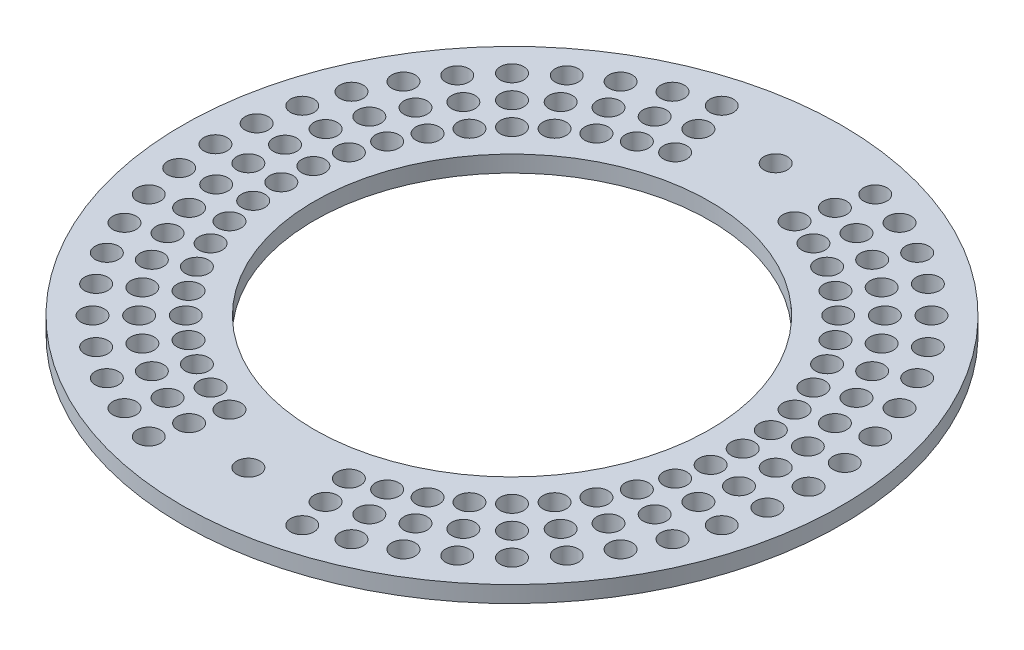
ISO-10303-21;
HEADER;
FILE_DESCRIPTION(('STEP AP214'),'2;1');
FILE_NAME('part.step','',(''),(''),'','','');
FILE_SCHEMA(('AUTOMOTIVE_DESIGN { 1 0 10303 214 1 1 1 1 }'));
ENDSEC;
DATA;
#1=APPLICATION_CONTEXT('core data for automotive mechanical design processes');
#2=APPLICATION_PROTOCOL_DEFINITION('international standard','automotive_design',2000,#1);
#3=PRODUCT_CONTEXT('',#1,'mechanical');
#4=PRODUCT('Part','Part','',(#3));
#5=PRODUCT_RELATED_PRODUCT_CATEGORY('part','',(#4));
#6=PRODUCT_DEFINITION_FORMATION('','',#4);
#7=PRODUCT_DEFINITION_CONTEXT('part definition',#1,'design');
#8=PRODUCT_DEFINITION('design','',#6,#7);
#9=PRODUCT_DEFINITION_SHAPE('','',#8);
#10=(LENGTH_UNIT() NAMED_UNIT(*) SI_UNIT(.MILLI.,.METRE.));
#11=(NAMED_UNIT(*) PLANE_ANGLE_UNIT() SI_UNIT($,.RADIAN.));
#12=(NAMED_UNIT(*) SI_UNIT($,.STERADIAN.) SOLID_ANGLE_UNIT());
#13=UNCERTAINTY_MEASURE_WITH_UNIT(LENGTH_MEASURE(1.E-05),#10,'distance_accuracy_value','');
#14=(GEOMETRIC_REPRESENTATION_CONTEXT(3) GLOBAL_UNCERTAINTY_ASSIGNED_CONTEXT((#13)) GLOBAL_UNIT_ASSIGNED_CONTEXT((#10,
#11,#12)) REPRESENTATION_CONTEXT('',''));
#15=CARTESIAN_POINT('',(0.,0.,0.));
#16=DIRECTION('',(0.,0.,1.));
#17=DIRECTION('',(1.,0.,0.));
#18=AXIS2_PLACEMENT_3D('',#15,#16,#17);
#19=CARTESIAN_POINT('',(0.,3.175,0.));
#20=DIRECTION('',(0.,1.,0.));
#21=DIRECTION('',(0.,0.,1.));
#22=AXIS2_PLACEMENT_3D('',#19,#20,#21);
#23=PLANE('',#22);
#24=CARTESIAN_POINT('',(43.9940905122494,3.175,25.4000000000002));
#25=DIRECTION('',(0.,-1.,0.));
#26=DIRECTION('',(-0.965925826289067,0.,-0.258819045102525));
#27=AXIS2_PLACEMENT_3D('',#24,#25,#26);
#28=CIRCLE('',#27,2.2479);
#29=CARTESIAN_POINT('',(41.8227858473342,3.175,24.8182006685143));
#30=VERTEX_POINT('',#29);
#31=EDGE_CURVE('E527',#30,#30,#28,.T.);
#32=ORIENTED_EDGE('',*,*,#31,.T.);
#33=EDGE_LOOP('',(#32));
#34=FACE_BOUND('',#33,.T.);
#35=CARTESIAN_POINT('',(41.0664452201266,3.175,17.0102785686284));
#36=DIRECTION('',(0.,-1.,0.));
#37=DIRECTION('',(-0.99144486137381,0.,-0.130526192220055));
#38=AXIS2_PLACEMENT_3D('',#35,#36,#37);
#39=CIRCLE('',#38,2.2479);
#40=CARTESIAN_POINT('',(38.8377763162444,3.175,16.716868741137));
#41=VERTEX_POINT('',#40);
#42=EDGE_CURVE('E515',#41,#41,#39,.T.);
#43=ORIENTED_EDGE('',*,*,#42,.T.);
#44=EDGE_LOOP('',(#43));
#45=FACE_BOUND('',#44,.T.);
#46=CARTESIAN_POINT('',(35.2645559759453,3.175,27.0594455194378));
#47=DIRECTION('',(0.,-1.,0.));
#48=DIRECTION('',(-0.923879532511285,0.,-0.382683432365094));
#49=AXIS2_PLACEMENT_3D('',#46,#47,#48);
#50=CIRCLE('',#49,2.2479);
#51=CARTESIAN_POINT('',(33.1877671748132,3.175,26.1992114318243));
#52=VERTEX_POINT('',#51);
#53=EDGE_CURVE('E551',#52,#52,#50,.T.);
#54=ORIENTED_EDGE('',*,*,#53,.T.);
#55=EDGE_LOOP('',(#54));
#56=FACE_BOUND('',#55,.T.);
#57=CARTESIAN_POINT('',(45.3401433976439,3.175,34.7907156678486));
#58=DIRECTION('',(0.,-1.,0.));
#59=DIRECTION('',(-0.923879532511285,0.,-0.382683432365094));
#60=AXIS2_PLACEMENT_3D('',#57,#58,#59);
#61=CIRCLE('',#60,2.2479);
#62=CARTESIAN_POINT('',(43.2633545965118,3.175,33.9304815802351));
#63=VERTEX_POINT('',#62);
#64=EDGE_CURVE('E539',#63,#63,#61,.T.);
#65=ORIENTED_EDGE('',*,*,#64,.T.);
#66=EDGE_LOOP('',(#65));
#67=FACE_BOUND('',#66,.T.);
#68=CARTESIAN_POINT('',(44.0697240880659,3.175,5.80188924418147));
#69=DIRECTION('',(0.,-1.,0.));
#70=DIRECTION('',(-0.991444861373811,0.,0.130526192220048));
#71=AXIS2_PLACEMENT_3D('',#68,#69,#70);
#72=CIRCLE('',#71,2.2479);
#73=CARTESIAN_POINT('',(41.8410551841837,3.175,6.09529907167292));
#74=VERTEX_POINT('',#73);
#75=EDGE_CURVE('E479',#74,#74,#72,.T.);
#76=ORIENTED_EDGE('',*,*,#75,.T.);
#77=EDGE_LOOP('',(#76));
#78=FACE_BOUND('',#77,.T.);
#79=CARTESIAN_POINT('',(56.6610738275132,3.175,7.45957188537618));
#80=DIRECTION('',(0.,-1.,0.));
#81=DIRECTION('',(-0.991444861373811,0.,0.130526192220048));
#82=AXIS2_PLACEMENT_3D('',#79,#80,#81);
#83=CIRCLE('',#82,2.2479);
#84=CARTESIAN_POINT('',(54.432404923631,3.175,7.75298171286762));
#85=VERTEX_POINT('',#84);
#86=EDGE_CURVE('E465',#85,#85,#83,.T.);
#87=ORIENTED_EDGE('',*,*,#86,.T.);
#88=EDGE_LOOP('',(#87));
#89=FACE_BOUND('',#88,.T.);
#90=CARTESIAN_POINT('',(42.935402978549,3.175,11.5045065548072));
#91=DIRECTION('',(0.,-1.,0.));
#92=DIRECTION('',(-1.,0.,0.));
#93=AXIS2_PLACEMENT_3D('',#90,#91,#92);
#94=CIRCLE('',#93,2.2479);
#95=CARTESIAN_POINT('',(40.687502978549,3.175,11.5045065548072));
#96=VERTEX_POINT('',#95);
#97=EDGE_CURVE('E497',#96,#96,#94,.T.);
#98=ORIENTED_EDGE('',*,*,#97,.T.);
#99=EDGE_LOOP('',(#98));
#100=FACE_BOUND('',#99,.T.);
#101=CARTESIAN_POINT('',(46.9330802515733,3.175,19.4403183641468));
#102=DIRECTION('',(0.,-1.,0.));
#103=DIRECTION('',(-0.99144486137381,0.,-0.130526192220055));
#104=AXIS2_PLACEMENT_3D('',#101,#102,#103);
#105=CIRCLE('',#104,2.2479);
#106=CARTESIAN_POINT('',(44.7044113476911,3.175,19.1469085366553));
#107=VERTEX_POINT('',#106);
#108=EDGE_CURVE('E484',#107,#107,#105,.T.);
#109=ORIENTED_EDGE('',*,*,#108,.T.);
#110=EDGE_LOOP('',(#109));
#111=FACE_BOUND('',#110,.T.);
#112=CARTESIAN_POINT('',(17.010278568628,3.175,41.0664452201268));
#113=DIRECTION('',(0.,-1.,0.));
#114=DIRECTION('',(-0.608761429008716,0.,-0.793353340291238));
#115=AXIS2_PLACEMENT_3D('',#112,#113,#114);
#116=CIRCLE('',#115,2.2479);
#117=CARTESIAN_POINT('',(15.6418437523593,3.175,39.2830662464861));
#118=VERTEX_POINT('',#117);
#119=EDGE_CURVE('E623',#118,#118,#116,.T.);
#120=ORIENTED_EDGE('',*,*,#119,.T.);
#121=EDGE_LOOP('',(#120));
#122=FACE_BOUND('',#121,.T.);
#123=CARTESIAN_POINT('',(21.8703581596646,3.175,52.7997152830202));
#124=DIRECTION('',(0.,-1.,0.));
#125=DIRECTION('',(-0.608761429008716,0.,-0.793353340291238));
#126=AXIS2_PLACEMENT_3D('',#123,#124,#125);
#127=CIRCLE('',#126,2.2479);
#128=CARTESIAN_POINT('',(20.5019233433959,3.175,51.0163363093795));
#129=VERTEX_POINT('',#128);
#130=EDGE_CURVE('E611',#129,#129,#127,.T.);
#131=ORIENTED_EDGE('',*,*,#130,.T.);
#132=EDGE_LOOP('',(#131));
#133=FACE_BOUND('',#132,.T.);
#134=CARTESIAN_POINT('',(11.5045065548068,3.175,42.9354029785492));
#135=DIRECTION('',(0.,-1.,0.));
#136=DIRECTION('',(-0.499999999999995,0.,-0.866025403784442));
#137=AXIS2_PLACEMENT_3D('',#134,#135,#136);
#138=CIRCLE('',#137,2.2479);
#139=CARTESIAN_POINT('',(10.3805565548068,3.175,40.9886644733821));
#140=VERTEX_POINT('',#139);
#141=EDGE_CURVE('E628',#140,#140,#138,.T.);
#142=ORIENTED_EDGE('',*,*,#141,.T.);
#143=EDGE_LOOP('',(#142));
#144=FACE_BOUND('',#143,.T.);
#145=CARTESIAN_POINT('',(34.7907156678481,3.175,45.3401433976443));
#146=DIRECTION('',(0.,-1.,0.));
#147=DIRECTION('',(-0.793353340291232,0.,-0.608761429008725));
#148=AXIS2_PLACEMENT_3D('',#145,#146,#147);
#149=CIRCLE('',#148,2.2479);
#150=CARTESIAN_POINT('',(33.0073366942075,3.175,43.9717085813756));
#151=VERTEX_POINT('',#150);
#152=EDGE_CURVE('E575',#151,#151,#149,.T.);
#153=ORIENTED_EDGE('',*,*,#152,.T.);
#154=EDGE_LOOP('',(#153));
#155=FACE_BOUND('',#154,.T.);
#156=CARTESIAN_POINT('',(31.4308964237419,3.175,31.4308964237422));
#157=DIRECTION('',(0.,-1.,0.));
#158=DIRECTION('',(-0.866025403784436,0.,-0.500000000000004));
#159=AXIS2_PLACEMENT_3D('',#156,#157,#158);
#160=CIRCLE('',#159,2.2479);
#161=CARTESIAN_POINT('',(29.4841579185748,3.175,30.3069464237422));
#162=VERTEX_POINT('',#161);
#163=EDGE_CURVE('E562',#162,#162,#160,.T.);
#164=ORIENTED_EDGE('',*,*,#163,.T.);
#165=EDGE_LOOP('',(#164));
#166=FACE_BOUND('',#165,.T.);
#167=CARTESIAN_POINT('',(25.3999999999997,3.175,43.9940905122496));
#168=DIRECTION('',(0.,-1.,0.));
#169=DIRECTION('',(-0.707106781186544,0.,-0.707106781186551));
#170=AXIS2_PLACEMENT_3D('',#167,#168,#169);
#171=CIRCLE('',#170,2.2479);
#172=CARTESIAN_POINT('',(23.8104946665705,3.175,42.4045851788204));
#173=VERTEX_POINT('',#172);
#174=EDGE_CURVE('E599',#173,#173,#171,.T.);
#175=ORIENTED_EDGE('',*,*,#174,.T.);
#176=EDGE_LOOP('',(#175));
#177=FACE_BOUND('',#176,.T.);
#178=CARTESIAN_POINT('',(27.0594455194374,3.175,35.2645559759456));
#179=DIRECTION('',(0.,-1.,0.));
#180=DIRECTION('',(-0.793353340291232,0.,-0.608761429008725));
#181=AXIS2_PLACEMENT_3D('',#178,#179,#180);
#182=CIRCLE('',#181,2.2479);
#183=CARTESIAN_POINT('',(25.2760665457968,3.175,33.8961211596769));
#184=VERTEX_POINT('',#183);
#185=EDGE_CURVE('E587',#184,#184,#182,.T.);
#186=ORIENTED_EDGE('',*,*,#185,.T.);
#187=EDGE_LOOP('',(#186));
#188=FACE_BOUND('',#187,.T.);
#189=CARTESIAN_POINT('',(27.0594455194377,3.175,-35.2645559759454));
#190=DIRECTION('',(0.,-1.,0.));
#191=DIRECTION('',(-0.382683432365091,0.,0.923879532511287));
#192=AXIS2_PLACEMENT_3D('',#189,#190,#191);
#193=CIRCLE('',#192,2.2479);
#194=CARTESIAN_POINT('',(26.1992114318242,3.175,-33.1877671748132));
#195=VERTEX_POINT('',#194);
#196=EDGE_CURVE('E694',#195,#195,#193,.T.);
#197=ORIENTED_EDGE('',*,*,#196,.T.);
#198=EDGE_LOOP('',(#197));
#199=FACE_BOUND('',#198,.T.);
#200=CARTESIAN_POINT('',(34.7907156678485,3.175,-45.340143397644));
#201=DIRECTION('',(0.,-1.,0.));
#202=DIRECTION('',(-0.382683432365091,0.,0.923879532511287));
#203=AXIS2_PLACEMENT_3D('',#200,#201,#202);
#204=CIRCLE('',#203,2.2479);
#205=CARTESIAN_POINT('',(33.930481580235,3.175,-43.2633545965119));
#206=VERTEX_POINT('',#205);
#207=EDGE_CURVE('E682',#206,#206,#204,.T.);
#208=ORIENTED_EDGE('',*,*,#207,.T.);
#209=EDGE_LOOP('',(#208));
#210=FACE_BOUND('',#209,.T.);
#211=CARTESIAN_POINT('',(45.3401433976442,3.175,-34.7907156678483));
#212=DIRECTION('',(0.,-1.,0.));
#213=DIRECTION('',(-0.608761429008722,0.,0.793353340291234));
#214=AXIS2_PLACEMENT_3D('',#211,#212,#213);
#215=CIRCLE('',#214,2.2479);
#216=CARTESIAN_POINT('',(43.9717085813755,3.175,-33.0073366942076));
#217=VERTEX_POINT('',#216);
#218=EDGE_CURVE('E718',#217,#217,#215,.T.);
#219=ORIENTED_EDGE('',*,*,#218,.T.);
#220=EDGE_LOOP('',(#219));
#221=FACE_BOUND('',#220,.T.);
#222=CARTESIAN_POINT('',(31.4308964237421,3.175,-31.430896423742));
#223=DIRECTION('',(0.,-1.,0.));
#224=DIRECTION('',(-0.500000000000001,0.,0.866025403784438));
#225=AXIS2_PLACEMENT_3D('',#222,#223,#224);
#226=CIRCLE('',#225,2.2479);
#227=CARTESIAN_POINT('',(30.3069464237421,3.175,-29.4841579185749));
#228=VERTEX_POINT('',#227);
#229=EDGE_CURVE('E705',#228,#228,#226,.T.);
#230=ORIENTED_EDGE('',*,*,#229,.T.);
#231=EDGE_LOOP('',(#230));
#232=FACE_BOUND('',#231,.T.);
#233=CARTESIAN_POINT('',(19.4403183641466,3.175,-46.9330802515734));
#234=DIRECTION('',(0.,-1.,0.));
#235=DIRECTION('',(-0.130526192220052,0.,0.99144486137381));
#236=AXIS2_PLACEMENT_3D('',#233,#234,#235);
#237=CIRCLE('',#236,2.2479);
#238=CARTESIAN_POINT('',(19.1469085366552,3.175,-44.7044113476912));
#239=VERTEX_POINT('',#238);
#240=EDGE_CURVE('E639',#239,#239,#237,.T.);
#241=ORIENTED_EDGE('',*,*,#240,.T.);
#242=EDGE_LOOP('',(#241));
#243=FACE_BOUND('',#242,.T.);
#244=CARTESIAN_POINT('',(25.4000000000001,3.175,-43.9940905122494));
#245=DIRECTION('',(0.,-1.,0.));
#246=DIRECTION('',(-0.258819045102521,0.,0.965925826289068));
#247=AXIS2_PLACEMENT_3D('',#244,#245,#246);
#248=CIRCLE('',#247,2.2479);
#249=CARTESIAN_POINT('',(24.8182006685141,3.175,-41.8227858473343));
#250=VERTEX_POINT('',#249);
#251=EDGE_CURVE('E670',#250,#250,#248,.T.);
#252=ORIENTED_EDGE('',*,*,#251,.T.);
#253=EDGE_LOOP('',(#252));
#254=FACE_BOUND('',#253,.T.);
#255=CARTESIAN_POINT('',(17.0102785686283,3.175,-41.0664452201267));
#256=DIRECTION('',(0.,-1.,0.));
#257=DIRECTION('',(-0.130526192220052,0.,0.99144486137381));
#258=AXIS2_PLACEMENT_3D('',#255,#256,#257);
#259=CIRCLE('',#258,2.2479);
#260=CARTESIAN_POINT('',(16.7168687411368,3.175,-38.8377763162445));
#261=VERTEX_POINT('',#260);
#262=EDGE_CURVE('E658',#261,#261,#259,.T.);
#263=ORIENTED_EDGE('',*,*,#262,.T.);
#264=EDGE_LOOP('',(#263));
#265=FACE_BOUND('',#264,.T.);
#266=CARTESIAN_POINT('',(56.6610738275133,3.175,-7.45957188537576));
#267=DIRECTION('',(0.,-1.,0.));
#268=DIRECTION('',(-0.923879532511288,0.,0.382683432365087));
#269=AXIS2_PLACEMENT_3D('',#266,#267,#268);
#270=CIRCLE('',#269,2.2479);
#271=CARTESIAN_POINT('',(54.5842850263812,3.175,-6.59933779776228));
#272=VERTEX_POINT('',#271);
#273=EDGE_CURVE('E790',#272,#272,#270,.T.);
#274=ORIENTED_EDGE('',*,*,#273,.T.);
#275=EDGE_LOOP('',(#274));
#276=FACE_BOUND('',#275,.T.);
#277=CARTESIAN_POINT('',(49.0690319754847,3.175,-13.1480074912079));
#278=DIRECTION('',(0.,-1.,0.));
#279=DIRECTION('',(-0.86602540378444,0.,0.499999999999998));
#280=AXIS2_PLACEMENT_3D('',#277,#278,#279);
#281=CIRCLE('',#280,2.2479);
#282=CARTESIAN_POINT('',(47.1222934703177,3.175,-12.0240574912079));
#283=VERTEX_POINT('',#282);
#284=EDGE_CURVE('E778',#283,#283,#281,.T.);
#285=ORIENTED_EDGE('',*,*,#284,.T.);
#286=EDGE_LOOP('',(#285));
#287=FACE_BOUND('',#286,.T.);
#288=CARTESIAN_POINT('',(50.8,3.175,1.89084858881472E-13));
#289=DIRECTION('',(0.,-1.,0.));
#290=DIRECTION('',(-0.965925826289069,0.,0.258819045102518));
#291=AXIS2_PLACEMENT_3D('',#288,#289,#290);
#292=CIRCLE('',#291,2.2479);
#293=CARTESIAN_POINT('',(48.6286953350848,3.175,0.581799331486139));
#294=VERTEX_POINT('',#293);
#295=EDGE_CURVE('E812',#294,#294,#292,.T.);
#296=ORIENTED_EDGE('',*,*,#295,.T.);
#297=EDGE_LOOP('',(#296));
#298=FACE_BOUND('',#297,.T.);
#299=CARTESIAN_POINT('',(44.0697240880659,3.175,-5.80188924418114));
#300=DIRECTION('',(0.,-1.,0.));
#301=DIRECTION('',(-0.923879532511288,0.,0.382683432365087));
#302=AXIS2_PLACEMENT_3D('',#299,#300,#301);
#303=CIRCLE('',#302,2.2479);
#304=CARTESIAN_POINT('',(41.9929352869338,3.175,-4.94165515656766));
#305=VERTEX_POINT('',#304);
#306=EDGE_CURVE('E802',#305,#305,#303,.T.);
#307=ORIENTED_EDGE('',*,*,#306,.T.);
#308=EDGE_LOOP('',(#307));
#309=FACE_BOUND('',#308,.T.);
#310=CARTESIAN_POINT('',(43.9940905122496,3.175,-25.3999999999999));
#311=DIRECTION('',(0.,-1.,0.));
#312=DIRECTION('',(-0.707106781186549,0.,0.707106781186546));
#313=AXIS2_PLACEMENT_3D('',#310,#311,#312);
#314=CIRCLE('',#313,2.2479);
#315=CARTESIAN_POINT('',(42.4045851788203,3.175,-23.8104946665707));
#316=VERTEX_POINT('',#315);
#317=EDGE_CURVE('E742',#316,#316,#314,.T.);
#318=ORIENTED_EDGE('',*,*,#317,.T.);
#319=EDGE_LOOP('',(#318));
#320=FACE_BOUND('',#319,.T.);
#321=CARTESIAN_POINT('',(35.2645559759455,3.175,-27.0594455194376));
#322=DIRECTION('',(0.,-1.,0.));
#323=DIRECTION('',(-0.608761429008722,0.,0.793353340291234));
#324=AXIS2_PLACEMENT_3D('',#321,#322,#323);
#325=CIRCLE('',#324,2.2479);
#326=CARTESIAN_POINT('',(33.8961211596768,3.175,-25.2760665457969));
#327=VERTEX_POINT('',#326);
#328=EDGE_CURVE('E730',#327,#327,#325,.T.);
#329=ORIENTED_EDGE('',*,*,#328,.T.);
#330=EDGE_LOOP('',(#329));
#331=FACE_BOUND('',#330,.T.);
#332=CARTESIAN_POINT('',(41.0664452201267,3.175,-17.0102785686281));
#333=DIRECTION('',(0.,-1.,0.));
#334=DIRECTION('',(-0.793353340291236,0.,0.608761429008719));
#335=AXIS2_PLACEMENT_3D('',#332,#333,#334);
#336=CIRCLE('',#335,2.2479);
#337=CARTESIAN_POINT('',(39.2830662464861,3.175,-15.6418437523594));
#338=VERTEX_POINT('',#337);
#339=EDGE_CURVE('E766',#338,#338,#336,.T.);
#340=ORIENTED_EDGE('',*,*,#339,.T.);
#341=EDGE_LOOP('',(#340));
#342=FACE_BOUND('',#341,.T.);
#343=CARTESIAN_POINT('',(52.7997152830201,3.175,-21.8703581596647));
#344=DIRECTION('',(0.,-1.,0.));
#345=DIRECTION('',(-0.793353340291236,0.,0.608761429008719));
#346=AXIS2_PLACEMENT_3D('',#343,#344,#345);
#347=CIRCLE('',#346,2.2479);
#348=CARTESIAN_POINT('',(51.0163363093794,3.175,-20.501923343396));
#349=VERTEX_POINT('',#348);
#350=EDGE_CURVE('E754',#349,#349,#347,.T.);
#351=ORIENTED_EDGE('',*,*,#350,.T.);
#352=EDGE_LOOP('',(#351));
#353=FACE_BOUND('',#352,.T.);
#354=CARTESIAN_POINT('',(14.7915084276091,3.175,-55.2026609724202));
#355=DIRECTION('',(0.,-1.,0.));
#356=DIRECTION('',(0.,0.,1.));
#357=AXIS2_PLACEMENT_3D('',#354,#355,#356);
#358=CIRCLE('',#357,2.2479);
#359=CARTESIAN_POINT('',(14.7915084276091,3.175,-52.9547609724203));
#360=VERTEX_POINT('',#359);
#361=EDGE_CURVE('E453',#360,#360,#358,.T.);
#362=ORIENTED_EDGE('',*,*,#361,.T.);
#363=EDGE_LOOP('',(#362));
#364=FACE_BOUND('',#363,.T.);
#365=CARTESIAN_POINT('',(13.1480074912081,3.175,-49.0690319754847));
#366=DIRECTION('',(0.,-1.,0.));
#367=DIRECTION('',(0.,0.,1.));
#368=AXIS2_PLACEMENT_3D('',#365,#366,#367);
#369=CIRCLE('',#368,2.2479);
#370=CARTESIAN_POINT('',(13.1480074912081,3.175,-46.8211319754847));
#371=VERTEX_POINT('',#370);
#372=EDGE_CURVE('E447',#371,#371,#369,.T.);
#373=ORIENTED_EDGE('',*,*,#372,.T.);
#374=EDGE_LOOP('',(#373));
#375=FACE_BOUND('',#374,.T.);
#376=CARTESIAN_POINT('',(11.5045065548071,3.175,-42.9354029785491));
#377=DIRECTION('',(0.,-1.,0.));
#378=DIRECTION('',(0.,0.,1.));
#379=AXIS2_PLACEMENT_3D('',#376,#377,#378);
#380=CIRCLE('',#379,2.2479);
#381=CARTESIAN_POINT('',(11.5045065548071,3.175,-40.6875029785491));
#382=VERTEX_POINT('',#381);
#383=EDGE_CURVE('E440',#382,#382,#380,.T.);
#384=ORIENTED_EDGE('',*,*,#383,.T.);
#385=EDGE_LOOP('',(#384));
#386=FACE_BOUND('',#385,.T.);
#387=CARTESIAN_POINT('',(-55.2026609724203,3.175,-14.7915084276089));
#388=DIRECTION('',(0.,1.,0.));
#389=DIRECTION('',(0.86602540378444,0.,0.499999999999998));
#390=AXIS2_PLACEMENT_3D('',#387,#388,#389);
#391=CIRCLE('',#390,2.2479);
#392=CARTESIAN_POINT('',(-53.2559224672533,3.175,-13.6675584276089));
#393=VERTEX_POINT('',#392);
#394=EDGE_CURVE('E213',#393,#393,#391,.T.);
#395=ORIENTED_EDGE('',*,*,#394,.F.);
#396=EDGE_LOOP('',(#395));
#397=FACE_BOUND('',#396,.T.);
#398=CARTESIAN_POINT('',(-49.0690319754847,3.175,-13.1480074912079));
#399=DIRECTION('',(0.,1.,0.));
#400=DIRECTION('',(0.86602540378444,0.,0.499999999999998));
#401=AXIS2_PLACEMENT_3D('',#398,#399,#400);
#402=CIRCLE('',#401,2.2479);
#403=CARTESIAN_POINT('',(-47.1222934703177,3.175,-12.0240574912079));
#404=VERTEX_POINT('',#403);
#405=EDGE_CURVE('E206',#404,#404,#402,.T.);
#406=ORIENTED_EDGE('',*,*,#405,.F.);
#407=EDGE_LOOP('',(#406));
#408=FACE_BOUND('',#407,.T.);
#409=CARTESIAN_POINT('',(-42.9354029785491,3.175,-11.5045065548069));
#410=DIRECTION('',(0.,1.,0.));
#411=DIRECTION('',(0.86602540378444,0.,0.499999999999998));
#412=AXIS2_PLACEMENT_3D('',#409,#410,#411);
#413=CIRCLE('',#412,2.2479);
#414=CARTESIAN_POINT('',(-40.9886644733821,3.175,-10.3805565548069));
#415=VERTEX_POINT('',#414);
#416=EDGE_CURVE('E225',#415,#415,#413,.T.);
#417=ORIENTED_EDGE('',*,*,#416,.F.);
#418=EDGE_LOOP('',(#417));
#419=FACE_BOUND('',#418,.T.);
#420=CARTESIAN_POINT('',(-56.6610738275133,3.175,-7.45957188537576));
#421=DIRECTION('',(0.,1.,0.));
#422=DIRECTION('',(0.923879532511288,0.,0.382683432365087));
#423=AXIS2_PLACEMENT_3D('',#420,#421,#422);
#424=CIRCLE('',#423,2.2479);
#425=CARTESIAN_POINT('',(-54.5842850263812,3.175,-6.59933779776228));
#426=VERTEX_POINT('',#425);
#427=EDGE_CURVE('E218',#426,#426,#424,.T.);
#428=ORIENTED_EDGE('',*,*,#427,.F.);
#429=EDGE_LOOP('',(#428));
#430=FACE_BOUND('',#429,.T.);
#431=CARTESIAN_POINT('',(-38.4948291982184,3.175,-22.2249999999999));
#432=DIRECTION('',(0.,1.,0.));
#433=DIRECTION('',(0.707106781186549,0.,0.707106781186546));
#434=AXIS2_PLACEMENT_3D('',#431,#432,#433);
#435=CIRCLE('',#434,2.2479);
#436=CARTESIAN_POINT('',(-36.9053238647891,3.175,-20.6354946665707));
#437=VERTEX_POINT('',#436);
#438=EDGE_CURVE('E189',#437,#437,#435,.T.);
#439=ORIENTED_EDGE('',*,*,#438,.F.);
#440=EDGE_LOOP('',(#439));
#441=FACE_BOUND('',#440,.T.);
#442=CARTESIAN_POINT('',(-52.7997152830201,3.175,-21.8703581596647));
#443=DIRECTION('',(0.,1.,0.));
#444=DIRECTION('',(0.793353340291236,0.,0.608761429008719));
#445=AXIS2_PLACEMENT_3D('',#442,#443,#444);
#446=CIRCLE('',#445,2.2479);
#447=CARTESIAN_POINT('',(-51.0163363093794,3.175,-20.501923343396));
#448=VERTEX_POINT('',#447);
#449=EDGE_CURVE('E182',#448,#448,#446,.T.);
#450=ORIENTED_EDGE('',*,*,#449,.F.);
#451=EDGE_LOOP('',(#450));
#452=FACE_BOUND('',#451,.T.);
#453=CARTESIAN_POINT('',(-46.9330802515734,3.175,-19.4403183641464));
#454=DIRECTION('',(0.,1.,0.));
#455=DIRECTION('',(0.793353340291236,0.,0.608761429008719));
#456=AXIS2_PLACEMENT_3D('',#453,#454,#455);
#457=CIRCLE('',#456,2.2479);
#458=CARTESIAN_POINT('',(-45.1497012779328,3.175,-18.0718835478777));
#459=VERTEX_POINT('',#458);
#460=EDGE_CURVE('E201',#459,#459,#457,.T.);
#461=ORIENTED_EDGE('',*,*,#460,.F.);
#462=EDGE_LOOP('',(#461));
#463=FACE_BOUND('',#462,.T.);
#464=CARTESIAN_POINT('',(-41.0664452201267,3.175,-17.0102785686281));
#465=DIRECTION('',(0.,1.,0.));
#466=DIRECTION('',(0.793353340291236,0.,0.608761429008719));
#467=AXIS2_PLACEMENT_3D('',#464,#465,#466);
#468=CIRCLE('',#467,2.2479);
#469=CARTESIAN_POINT('',(-39.2830662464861,3.175,-15.6418437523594));
#470=VERTEX_POINT('',#469);
#471=EDGE_CURVE('E194',#470,#470,#468,.T.);
#472=ORIENTED_EDGE('',*,*,#471,.F.);
#473=EDGE_LOOP('',(#472));
#474=FACE_BOUND('',#473,.T.);
#475=CARTESIAN_POINT('',(-44.45,3.175,1.66533453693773E-13));
#476=DIRECTION('',(0.,1.,0.));
#477=DIRECTION('',(0.965925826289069,0.,0.258819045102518));
#478=AXIS2_PLACEMENT_3D('',#475,#476,#477);
#479=CIRCLE('',#478,2.2479);
#480=CARTESIAN_POINT('',(-42.2786953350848,3.175,0.581799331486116));
#481=VERTEX_POINT('',#480);
#482=EDGE_CURVE('E261',#481,#481,#479,.T.);
#483=ORIENTED_EDGE('',*,*,#482,.F.);
#484=EDGE_LOOP('',(#483));
#485=FACE_BOUND('',#484,.T.);
#486=CARTESIAN_POINT('',(-56.6610738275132,3.175,7.45957188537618));
#487=DIRECTION('',(0.,1.,0.));
#488=DIRECTION('',(0.991444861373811,0.,0.130526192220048));
#489=AXIS2_PLACEMENT_3D('',#486,#487,#488);
#490=CIRCLE('',#489,2.2479);
#491=CARTESIAN_POINT('',(-54.432404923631,3.175,7.75298171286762));
#492=VERTEX_POINT('',#491);
#493=EDGE_CURVE('E254',#492,#492,#490,.T.);
#494=ORIENTED_EDGE('',*,*,#493,.F.);
#495=EDGE_LOOP('',(#494));
#496=FACE_BOUND('',#495,.T.);
#497=CARTESIAN_POINT('',(-50.3653989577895,3.175,6.63073056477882));
#498=DIRECTION('',(0.,1.,0.));
#499=DIRECTION('',(0.991444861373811,0.,0.130526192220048));
#500=AXIS2_PLACEMENT_3D('',#497,#498,#499);
#501=CIRCLE('',#500,2.2479);
#502=CARTESIAN_POINT('',(-48.1367300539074,3.175,6.92414039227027));
#503=VERTEX_POINT('',#502);
#504=EDGE_CURVE('E273',#503,#503,#501,.T.);
#505=ORIENTED_EDGE('',*,*,#504,.F.);
#506=EDGE_LOOP('',(#505));
#507=FACE_BOUND('',#506,.T.);
#508=CARTESIAN_POINT('',(-44.0697240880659,3.175,5.80188924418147));
#509=DIRECTION('',(0.,1.,0.));
#510=DIRECTION('',(0.991444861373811,0.,0.130526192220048));
#511=AXIS2_PLACEMENT_3D('',#508,#509,#510);
#512=CIRCLE('',#511,2.2479);
#513=CARTESIAN_POINT('',(-41.8410551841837,3.175,6.09529907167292));
#514=VERTEX_POINT('',#513);
#515=EDGE_CURVE('E266',#514,#514,#512,.T.);
#516=ORIENTED_EDGE('',*,*,#515,.F.);
#517=EDGE_LOOP('',(#516));
#518=FACE_BOUND('',#517,.T.);
#519=CARTESIAN_POINT('',(-50.8,3.175,1.89084858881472E-13));
#520=DIRECTION('',(0.,1.,0.));
#521=DIRECTION('',(0.965925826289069,0.,0.258819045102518));
#522=AXIS2_PLACEMENT_3D('',#519,#520,#521);
#523=CIRCLE('',#522,2.2479);
#524=CARTESIAN_POINT('',(-48.6286953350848,3.175,0.581799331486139));
#525=VERTEX_POINT('',#524);
#526=EDGE_CURVE('E230',#525,#525,#523,.T.);
#527=ORIENTED_EDGE('',*,*,#526,.F.);
#528=EDGE_LOOP('',(#527));
#529=FACE_BOUND('',#528,.T.);
#530=CARTESIAN_POINT('',(-57.15,3.175,2.1163626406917E-13));
#531=DIRECTION('',(0.,1.,0.));
#532=DIRECTION('',(0.965925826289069,0.,0.258819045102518));
#533=AXIS2_PLACEMENT_3D('',#530,#531,#532);
#534=CIRCLE('',#533,2.2479);
#535=CARTESIAN_POINT('',(-54.9786953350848,3.175,0.581799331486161));
#536=VERTEX_POINT('',#535);
#537=EDGE_CURVE('E237',#536,#536,#534,.T.);
#538=ORIENTED_EDGE('',*,*,#537,.F.);
#539=EDGE_LOOP('',(#538));
#540=FACE_BOUND('',#539,.T.);
#541=CARTESIAN_POINT('',(-44.0697240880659,3.175,-5.80188924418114));
#542=DIRECTION('',(0.,1.,0.));
#543=DIRECTION('',(0.923879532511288,0.,0.382683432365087));
#544=AXIS2_PLACEMENT_3D('',#541,#542,#543);
#545=CIRCLE('',#544,2.2479);
#546=CARTESIAN_POINT('',(-41.9929352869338,3.175,-4.94165515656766));
#547=VERTEX_POINT('',#546);
#548=EDGE_CURVE('E243',#547,#547,#545,.T.);
#549=ORIENTED_EDGE('',*,*,#548,.F.);
#550=EDGE_LOOP('',(#549));
#551=FACE_BOUND('',#550,.T.);
#552=CARTESIAN_POINT('',(-50.3653989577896,3.175,-6.63073056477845));
#553=DIRECTION('',(0.,1.,0.));
#554=DIRECTION('',(0.923879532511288,0.,0.382683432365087));
#555=AXIS2_PLACEMENT_3D('',#552,#553,#554);
#556=CIRCLE('',#555,2.2479);
#557=CARTESIAN_POINT('',(-48.2886101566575,3.175,-5.77049647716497));
#558=VERTEX_POINT('',#557);
#559=EDGE_CURVE('E249',#558,#558,#556,.T.);
#560=ORIENTED_EDGE('',*,*,#559,.F.);
#561=EDGE_LOOP('',(#560));
#562=FACE_BOUND('',#561,.T.);
#563=CARTESIAN_POINT('',(-22.2250000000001,3.175,-38.4948291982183));
#564=DIRECTION('',(0.,1.,0.));
#565=DIRECTION('',(0.258819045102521,0.,0.965925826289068));
#566=AXIS2_PLACEMENT_3D('',#563,#564,#565);
#567=CIRCLE('',#566,2.2479);
#568=CARTESIAN_POINT('',(-21.6432006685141,3.175,-36.3235245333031));
#569=VERTEX_POINT('',#568);
#570=EDGE_CURVE('E117',#569,#569,#567,.T.);
#571=ORIENTED_EDGE('',*,*,#570,.F.);
#572=EDGE_LOOP('',(#571));
#573=FACE_BOUND('',#572,.T.);
#574=CARTESIAN_POINT('',(-34.7907156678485,3.175,-45.340143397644));
#575=DIRECTION('',(0.,1.,0.));
#576=DIRECTION('',(0.382683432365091,0.,0.923879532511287));
#577=AXIS2_PLACEMENT_3D('',#574,#575,#576);
#578=CIRCLE('',#577,2.2479);
#579=CARTESIAN_POINT('',(-33.930481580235,3.175,-43.2633545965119));
#580=VERTEX_POINT('',#579);
#581=EDGE_CURVE('E110',#580,#580,#578,.T.);
#582=ORIENTED_EDGE('',*,*,#581,.F.);
#583=EDGE_LOOP('',(#582));
#584=FACE_BOUND('',#583,.T.);
#585=CARTESIAN_POINT('',(-30.9250805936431,3.175,-40.3023496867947));
#586=DIRECTION('',(0.,1.,0.));
#587=DIRECTION('',(0.382683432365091,0.,0.923879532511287));
#588=AXIS2_PLACEMENT_3D('',#585,#586,#587);
#589=CIRCLE('',#588,2.2479);
#590=CARTESIAN_POINT('',(-30.0648465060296,3.175,-38.2255608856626));
#591=VERTEX_POINT('',#590);
#592=EDGE_CURVE('E129',#591,#591,#589,.T.);
#593=ORIENTED_EDGE('',*,*,#592,.F.);
#594=EDGE_LOOP('',(#593));
#595=FACE_BOUND('',#594,.T.);
#596=CARTESIAN_POINT('',(-27.0594455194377,3.175,-35.2645559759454));
#597=DIRECTION('',(0.,1.,0.));
#598=DIRECTION('',(0.382683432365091,0.,0.923879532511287));
#599=AXIS2_PLACEMENT_3D('',#596,#597,#598);
#600=CIRCLE('',#599,2.2479);
#601=CARTESIAN_POINT('',(-26.1992114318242,3.175,-33.1877671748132));
#602=VERTEX_POINT('',#601);
#603=EDGE_CURVE('E122',#602,#602,#600,.T.);
#604=ORIENTED_EDGE('',*,*,#603,.F.);
#605=EDGE_LOOP('',(#604));
#606=FACE_BOUND('',#605,.T.);
#607=CARTESIAN_POINT('',(-25.4000000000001,3.175,-43.9940905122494));
#608=DIRECTION('',(0.,1.,0.));
#609=DIRECTION('',(0.258819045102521,0.,0.965925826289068));
#610=AXIS2_PLACEMENT_3D('',#607,#608,#609);
#611=CIRCLE('',#610,2.2479);
#612=CARTESIAN_POINT('',(-24.8182006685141,3.175,-41.8227858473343));
#613=VERTEX_POINT('',#612);
#614=EDGE_CURVE('E86',#613,#613,#611,.T.);
#615=ORIENTED_EDGE('',*,*,#614,.F.);
#616=EDGE_LOOP('',(#615));
#617=FACE_BOUND('',#616,.T.);
#618=CARTESIAN_POINT('',(-28.5750000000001,3.175,-49.4933518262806));
#619=DIRECTION('',(0.,1.,0.));
#620=DIRECTION('',(0.258819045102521,0.,0.965925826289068));
#621=AXIS2_PLACEMENT_3D('',#618,#619,#620);
#622=CIRCLE('',#621,2.2479);
#623=CARTESIAN_POINT('',(-27.9932006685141,3.175,-47.3220471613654));
#624=VERTEX_POINT('',#623);
#625=EDGE_CURVE('E93',#624,#624,#622,.T.);
#626=ORIENTED_EDGE('',*,*,#625,.F.);
#627=EDGE_LOOP('',(#626));
#628=FACE_BOUND('',#627,.T.);
#629=CARTESIAN_POINT('',(-17.0102785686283,3.175,-41.0664452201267));
#630=DIRECTION('',(0.,1.,0.));
#631=DIRECTION('',(0.130526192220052,0.,0.99144486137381));
#632=AXIS2_PLACEMENT_3D('',#629,#630,#631);
#633=CIRCLE('',#632,2.2479);
#634=CARTESIAN_POINT('',(-16.7168687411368,3.175,-38.8377763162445));
#635=VERTEX_POINT('',#634);
#636=EDGE_CURVE('E99',#635,#635,#633,.T.);
#637=ORIENTED_EDGE('',*,*,#636,.F.);
#638=EDGE_LOOP('',(#637));
#639=FACE_BOUND('',#638,.T.);
#640=CARTESIAN_POINT('',(-19.4403183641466,3.175,-46.9330802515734));
#641=DIRECTION('',(0.,1.,0.));
#642=DIRECTION('',(0.130526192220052,0.,0.99144486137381));
#643=AXIS2_PLACEMENT_3D('',#640,#641,#642);
#644=CIRCLE('',#643,2.2479);
#645=CARTESIAN_POINT('',(-19.1469085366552,3.175,-44.7044113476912));
#646=VERTEX_POINT('',#645);
#647=EDGE_CURVE('E105',#646,#646,#644,.T.);
#648=ORIENTED_EDGE('',*,*,#647,.F.);
#649=EDGE_LOOP('',(#648));
#650=FACE_BOUND('',#649,.T.);
#651=CARTESIAN_POINT('',(-40.3023496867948,3.175,-30.9250805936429));
#652=DIRECTION('',(0.,1.,0.));
#653=DIRECTION('',(0.608761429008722,0.,0.793353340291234));
#654=AXIS2_PLACEMENT_3D('',#651,#652,#653);
#655=CIRCLE('',#654,2.2479);
#656=CARTESIAN_POINT('',(-38.9339148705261,3.175,-29.1417016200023));
#657=VERTEX_POINT('',#656);
#658=EDGE_CURVE('E165',#657,#657,#655,.T.);
#659=ORIENTED_EDGE('',*,*,#658,.F.);
#660=EDGE_LOOP('',(#659));
#661=FACE_BOUND('',#660,.T.);
#662=CARTESIAN_POINT('',(-35.2645559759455,3.175,-27.0594455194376));
#663=DIRECTION('',(0.,1.,0.));
#664=DIRECTION('',(0.608761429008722,0.,0.793353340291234));
#665=AXIS2_PLACEMENT_3D('',#662,#663,#664);
#666=CIRCLE('',#665,2.2479);
#667=CARTESIAN_POINT('',(-33.8961211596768,3.175,-25.2760665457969));
#668=VERTEX_POINT('',#667);
#669=EDGE_CURVE('E158',#668,#668,#666,.T.);
#670=ORIENTED_EDGE('',*,*,#669,.F.);
#671=EDGE_LOOP('',(#670));
#672=FACE_BOUND('',#671,.T.);
#673=CARTESIAN_POINT('',(-49.4933518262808,3.175,-28.5749999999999));
#674=DIRECTION('',(0.,1.,0.));
#675=DIRECTION('',(0.707106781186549,0.,0.707106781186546));
#676=AXIS2_PLACEMENT_3D('',#673,#674,#675);
#677=CIRCLE('',#676,2.2479);
#678=CARTESIAN_POINT('',(-47.9038464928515,3.175,-26.9854946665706));
#679=VERTEX_POINT('',#678);
#680=EDGE_CURVE('E177',#679,#679,#677,.T.);
#681=ORIENTED_EDGE('',*,*,#680,.F.);
#682=EDGE_LOOP('',(#681));
#683=FACE_BOUND('',#682,.T.);
#684=CARTESIAN_POINT('',(-43.9940905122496,3.175,-25.3999999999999));
#685=DIRECTION('',(0.,1.,0.));
#686=DIRECTION('',(0.707106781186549,0.,0.707106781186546));
#687=AXIS2_PLACEMENT_3D('',#684,#685,#686);
#688=CIRCLE('',#687,2.2479);
#689=CARTESIAN_POINT('',(-42.4045851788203,3.175,-23.8104946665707));
#690=VERTEX_POINT('',#689);
#691=EDGE_CURVE('E170',#690,#690,#688,.T.);
#692=ORIENTED_EDGE('',*,*,#691,.F.);
#693=EDGE_LOOP('',(#692));
#694=FACE_BOUND('',#693,.T.);
#695=CARTESIAN_POINT('',(-35.9210244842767,3.175,-35.9210244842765));
#696=DIRECTION('',(0.,1.,0.));
#697=DIRECTION('',(0.500000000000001,0.,0.866025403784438));
#698=AXIS2_PLACEMENT_3D('',#695,#696,#697);
#699=CIRCLE('',#698,2.2479);
#700=CARTESIAN_POINT('',(-34.7970744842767,3.175,-33.9742859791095));
#701=VERTEX_POINT('',#700);
#702=EDGE_CURVE('E140',#701,#701,#699,.T.);
#703=ORIENTED_EDGE('',*,*,#702,.F.);
#704=EDGE_LOOP('',(#703));
#705=FACE_BOUND('',#704,.T.);
#706=CARTESIAN_POINT('',(-40.4111525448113,3.175,-40.4111525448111));
#707=DIRECTION('',(0.,1.,0.));
#708=DIRECTION('',(0.500000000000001,0.,0.866025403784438));
#709=AXIS2_PLACEMENT_3D('',#706,#707,#708);
#710=CIRCLE('',#709,2.2479);
#711=CARTESIAN_POINT('',(-39.2872025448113,3.175,-38.4644140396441));
#712=VERTEX_POINT('',#711);
#713=EDGE_CURVE('E134',#712,#712,#710,.T.);
#714=ORIENTED_EDGE('',*,*,#713,.F.);
#715=EDGE_LOOP('',(#714));
#716=FACE_BOUND('',#715,.T.);
#717=CARTESIAN_POINT('',(-31.4308964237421,3.175,-31.430896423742));
#718=DIRECTION('',(0.,1.,0.));
#719=DIRECTION('',(0.500000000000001,0.,0.866025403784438));
#720=AXIS2_PLACEMENT_3D('',#717,#718,#719);
#721=CIRCLE('',#720,2.2479);
#722=CARTESIAN_POINT('',(-30.3069464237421,3.175,-29.4841579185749));
#723=VERTEX_POINT('',#722);
#724=EDGE_CURVE('E153',#723,#723,#721,.T.);
#725=ORIENTED_EDGE('',*,*,#724,.F.);
#726=EDGE_LOOP('',(#725));
#727=FACE_BOUND('',#726,.T.);
#728=CARTESIAN_POINT('',(-45.3401433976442,3.175,-34.7907156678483));
#729=DIRECTION('',(0.,1.,0.));
#730=DIRECTION('',(0.608761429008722,0.,0.793353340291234));
#731=AXIS2_PLACEMENT_3D('',#728,#729,#730);
#732=CIRCLE('',#731,2.2479);
#733=CARTESIAN_POINT('',(-43.9717085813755,3.175,-33.0073366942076));
#734=VERTEX_POINT('',#733);
#735=EDGE_CURVE('E146',#734,#734,#732,.T.);
#736=ORIENTED_EDGE('',*,*,#735,.F.);
#737=EDGE_LOOP('',(#736));
#738=FACE_BOUND('',#737,.T.);
#739=CARTESIAN_POINT('',(-22.2249999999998,3.175,38.4948291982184));
#740=DIRECTION('',(0.,1.,0.));
#741=DIRECTION('',(0.707106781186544,0.,-0.707106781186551));
#742=AXIS2_PLACEMENT_3D('',#739,#740,#741);
#743=CIRCLE('',#742,2.2479);
#744=CARTESIAN_POINT('',(-20.6354946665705,3.175,36.9053238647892));
#745=VERTEX_POINT('',#744);
#746=EDGE_CURVE('E405',#745,#745,#743,.T.);
#747=ORIENTED_EDGE('',*,*,#746,.F.);
#748=EDGE_LOOP('',(#747));
#749=FACE_BOUND('',#748,.T.);
#750=CARTESIAN_POINT('',(-21.8703581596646,3.175,52.7997152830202));
#751=DIRECTION('',(0.,1.,0.));
#752=DIRECTION('',(0.608761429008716,0.,-0.793353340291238));
#753=AXIS2_PLACEMENT_3D('',#750,#751,#752);
#754=CIRCLE('',#753,2.2479);
#755=CARTESIAN_POINT('',(-20.5019233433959,3.175,51.0163363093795));
#756=VERTEX_POINT('',#755);
#757=EDGE_CURVE('E398',#756,#756,#754,.T.);
#758=ORIENTED_EDGE('',*,*,#757,.F.);
#759=EDGE_LOOP('',(#758));
#760=FACE_BOUND('',#759,.T.);
#761=CARTESIAN_POINT('',(-19.4403183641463,3.175,46.9330802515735));
#762=DIRECTION('',(0.,1.,0.));
#763=DIRECTION('',(0.608761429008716,0.,-0.793353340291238));
#764=AXIS2_PLACEMENT_3D('',#761,#762,#763);
#765=CIRCLE('',#764,2.2479);
#766=CARTESIAN_POINT('',(-18.0718835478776,3.175,45.1497012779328));
#767=VERTEX_POINT('',#766);
#768=EDGE_CURVE('E417',#767,#767,#765,.T.);
#769=ORIENTED_EDGE('',*,*,#768,.F.);
#770=EDGE_LOOP('',(#769));
#771=FACE_BOUND('',#770,.T.);
#772=CARTESIAN_POINT('',(-17.010278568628,3.175,41.0664452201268));
#773=DIRECTION('',(0.,1.,0.));
#774=DIRECTION('',(0.608761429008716,0.,-0.793353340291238));
#775=AXIS2_PLACEMENT_3D('',#772,#773,#774);
#776=CIRCLE('',#775,2.2479);
#777=CARTESIAN_POINT('',(-15.6418437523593,3.175,39.2830662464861));
#778=VERTEX_POINT('',#777);
#779=EDGE_CURVE('E410',#778,#778,#776,.T.);
#780=ORIENTED_EDGE('',*,*,#779,.F.);
#781=EDGE_LOOP('',(#780));
#782=FACE_BOUND('',#781,.T.);
#783=CARTESIAN_POINT('',(-30.9250805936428,3.175,40.3023496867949));
#784=DIRECTION('',(0.,1.,0.));
#785=DIRECTION('',(0.793353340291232,0.,-0.608761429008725));
#786=AXIS2_PLACEMENT_3D('',#783,#784,#785);
#787=CIRCLE('',#786,2.2479);
#788=CARTESIAN_POINT('',(-29.1417016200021,3.175,38.9339148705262));
#789=VERTEX_POINT('',#788);
#790=EDGE_CURVE('E381',#789,#789,#787,.T.);
#791=ORIENTED_EDGE('',*,*,#790,.F.);
#792=EDGE_LOOP('',(#791));
#793=FACE_BOUND('',#792,.T.);
#794=CARTESIAN_POINT('',(-27.0594455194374,3.175,35.2645559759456));
#795=DIRECTION('',(0.,1.,0.));
#796=DIRECTION('',(0.793353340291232,0.,-0.608761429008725));
#797=AXIS2_PLACEMENT_3D('',#794,#795,#796);
#798=CIRCLE('',#797,2.2479);
#799=CARTESIAN_POINT('',(-25.2760665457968,3.175,33.8961211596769));
#800=VERTEX_POINT('',#799);
#801=EDGE_CURVE('E374',#800,#800,#798,.T.);
#802=ORIENTED_EDGE('',*,*,#801,.F.);
#803=EDGE_LOOP('',(#802));
#804=FACE_BOUND('',#803,.T.);
#805=CARTESIAN_POINT('',(-28.5749999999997,3.175,49.4933518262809));
#806=DIRECTION('',(0.,1.,0.));
#807=DIRECTION('',(0.707106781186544,0.,-0.707106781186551));
#808=AXIS2_PLACEMENT_3D('',#805,#806,#807);
#809=CIRCLE('',#808,2.2479);
#810=CARTESIAN_POINT('',(-26.9854946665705,3.175,47.9038464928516));
#811=VERTEX_POINT('',#810);
#812=EDGE_CURVE('E393',#811,#811,#809,.T.);
#813=ORIENTED_EDGE('',*,*,#812,.F.);
#814=EDGE_LOOP('',(#813));
#815=FACE_BOUND('',#814,.T.);
#816=CARTESIAN_POINT('',(-25.3999999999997,3.175,43.9940905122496));
#817=DIRECTION('',(0.,1.,0.));
#818=DIRECTION('',(0.707106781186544,0.,-0.707106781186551));
#819=AXIS2_PLACEMENT_3D('',#816,#817,#818);
#820=CIRCLE('',#819,2.2479);
#821=CARTESIAN_POINT('',(-23.8104946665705,3.175,42.4045851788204));
#822=VERTEX_POINT('',#821);
#823=EDGE_CURVE('E386',#822,#822,#820,.T.);
#824=ORIENTED_EDGE('',*,*,#823,.F.);
#825=EDGE_LOOP('',(#824));
#826=FACE_BOUND('',#825,.T.);
#827=CARTESIAN_POINT('',(-14.7915084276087,3.175,55.2026609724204));
#828=DIRECTION('',(0.,1.,0.));
#829=DIRECTION('',(0.499999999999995,0.,-0.866025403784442));
#830=AXIS2_PLACEMENT_3D('',#827,#828,#829);
#831=CIRCLE('',#830,2.2479);
#832=CARTESIAN_POINT('',(-13.6675584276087,3.175,53.2559224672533));
#833=VERTEX_POINT('',#832);
#834=EDGE_CURVE('E435',#833,#833,#831,.T.);
#835=ORIENTED_EDGE('',*,*,#834,.F.);
#836=EDGE_LOOP('',(#835));
#837=FACE_BOUND('',#836,.T.);
#838=CARTESIAN_POINT('',(-13.1480074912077,3.175,49.0690319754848));
#839=DIRECTION('',(0.,1.,0.));
#840=DIRECTION('',(0.499999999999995,0.,-0.866025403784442));
#841=AXIS2_PLACEMENT_3D('',#838,#839,#840);
#842=CIRCLE('',#841,2.2479);
#843=CARTESIAN_POINT('',(-12.0240574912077,3.175,47.1222934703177));
#844=VERTEX_POINT('',#843);
#845=EDGE_CURVE('E429',#844,#844,#842,.T.);
#846=ORIENTED_EDGE('',*,*,#845,.F.);
#847=EDGE_LOOP('',(#846));
#848=FACE_BOUND('',#847,.T.);
#849=CARTESIAN_POINT('',(-11.5045065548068,3.175,42.9354029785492));
#850=DIRECTION('',(0.,1.,0.));
#851=DIRECTION('',(0.499999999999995,0.,-0.866025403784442));
#852=AXIS2_PLACEMENT_3D('',#849,#850,#851);
#853=CIRCLE('',#852,2.2479);
#854=CARTESIAN_POINT('',(-10.3805565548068,3.175,40.9886644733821));
#855=VERTEX_POINT('',#854);
#856=EDGE_CURVE('E422',#855,#855,#853,.T.);
#857=ORIENTED_EDGE('',*,*,#856,.F.);
#858=EDGE_LOOP('',(#857));
#859=FACE_BOUND('',#858,.T.);
#860=CARTESIAN_POINT('',(-43.9940905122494,3.175,25.4000000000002));
#861=DIRECTION('',(0.,1.,0.));
#862=DIRECTION('',(0.965925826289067,0.,-0.258819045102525));
#863=AXIS2_PLACEMENT_3D('',#860,#861,#862);
#864=CIRCLE('',#863,2.2479);
#865=CARTESIAN_POINT('',(-41.8227858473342,3.175,24.8182006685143));
#866=VERTEX_POINT('',#865);
#867=EDGE_CURVE('E302',#866,#866,#864,.T.);
#868=ORIENTED_EDGE('',*,*,#867,.F.);
#869=EDGE_LOOP('',(#868));
#870=FACE_BOUND('',#869,.T.);
#871=CARTESIAN_POINT('',(-49.4933518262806,3.175,28.5750000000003));
#872=DIRECTION('',(0.,1.,0.));
#873=DIRECTION('',(0.965925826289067,0.,-0.258819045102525));
#874=AXIS2_PLACEMENT_3D('',#871,#872,#873);
#875=CIRCLE('',#874,2.2479);
#876=CARTESIAN_POINT('',(-47.3220471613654,3.175,27.9932006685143));
#877=VERTEX_POINT('',#876);
#878=EDGE_CURVE('E309',#877,#877,#875,.T.);
#879=ORIENTED_EDGE('',*,*,#878,.F.);
#880=EDGE_LOOP('',(#879));
#881=FACE_BOUND('',#880,.T.);
#882=CARTESIAN_POINT('',(-41.0664452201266,3.175,17.0102785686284));
#883=DIRECTION('',(0.,1.,0.));
#884=DIRECTION('',(0.99144486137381,0.,-0.130526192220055));
#885=AXIS2_PLACEMENT_3D('',#882,#883,#884);
#886=CIRCLE('',#885,2.2479);
#887=CARTESIAN_POINT('',(-38.8377763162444,3.175,16.716868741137));
#888=VERTEX_POINT('',#887);
#889=EDGE_CURVE('E315',#888,#888,#886,.T.);
#890=ORIENTED_EDGE('',*,*,#889,.F.);
#891=EDGE_LOOP('',(#890));
#892=FACE_BOUND('',#891,.T.);
#893=CARTESIAN_POINT('',(-46.9330802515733,3.175,19.4403183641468));
#894=DIRECTION('',(0.,1.,0.));
#895=DIRECTION('',(0.99144486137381,0.,-0.130526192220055));
#896=AXIS2_PLACEMENT_3D('',#893,#894,#895);
#897=CIRCLE('',#896,2.2479);
#898=CARTESIAN_POINT('',(-44.7044113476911,3.175,19.1469085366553));
#899=VERTEX_POINT('',#898);
#900=EDGE_CURVE('E321',#899,#899,#897,.T.);
#901=ORIENTED_EDGE('',*,*,#900,.F.);
#902=EDGE_LOOP('',(#901));
#903=FACE_BOUND('',#902,.T.);
#904=CARTESIAN_POINT('',(-55.2026609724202,3.175,14.7915084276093));
#905=DIRECTION('',(0.,1.,0.));
#906=DIRECTION('',(1.,0.,0.));
#907=AXIS2_PLACEMENT_3D('',#904,#905,#906);
#908=CIRCLE('',#907,2.2479);
#909=CARTESIAN_POINT('',(-52.9547609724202,3.175,14.7915084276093));
#910=VERTEX_POINT('',#909);
#911=EDGE_CURVE('E285',#910,#910,#908,.T.);
#912=ORIENTED_EDGE('',*,*,#911,.F.);
#913=EDGE_LOOP('',(#912));
#914=FACE_BOUND('',#913,.T.);
#915=CARTESIAN_POINT('',(-49.0690319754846,3.175,13.1480074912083));
#916=DIRECTION('',(0.,1.,0.));
#917=DIRECTION('',(1.,0.,0.));
#918=AXIS2_PLACEMENT_3D('',#915,#916,#917);
#919=CIRCLE('',#918,2.2479);
#920=CARTESIAN_POINT('',(-46.8211319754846,3.175,13.1480074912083));
#921=VERTEX_POINT('',#920);
#922=EDGE_CURVE('E278',#921,#921,#919,.T.);
#923=ORIENTED_EDGE('',*,*,#922,.F.);
#924=EDGE_LOOP('',(#923));
#925=FACE_BOUND('',#924,.T.);
#926=CARTESIAN_POINT('',(-42.935402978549,3.175,11.5045065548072));
#927=DIRECTION('',(0.,1.,0.));
#928=DIRECTION('',(1.,0.,0.));
#929=AXIS2_PLACEMENT_3D('',#926,#927,#928);
#930=CIRCLE('',#929,2.2479);
#931=CARTESIAN_POINT('',(-40.687502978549,3.175,11.5045065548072));
#932=VERTEX_POINT('',#931);
#933=EDGE_CURVE('E297',#932,#932,#930,.T.);
#934=ORIENTED_EDGE('',*,*,#933,.F.);
#935=EDGE_LOOP('',(#934));
#936=FACE_BOUND('',#935,.T.);
#937=CARTESIAN_POINT('',(-52.7997152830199,3.175,21.8703581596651));
#938=DIRECTION('',(0.,1.,0.));
#939=DIRECTION('',(0.99144486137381,0.,-0.130526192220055));
#940=AXIS2_PLACEMENT_3D('',#937,#938,#939);
#941=CIRCLE('',#940,2.2479);
#942=CARTESIAN_POINT('',(-50.5710463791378,3.175,21.5769483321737));
#943=VERTEX_POINT('',#942);
#944=EDGE_CURVE('E290',#943,#943,#941,.T.);
#945=ORIENTED_EDGE('',*,*,#944,.F.);
#946=EDGE_LOOP('',(#945));
#947=FACE_BOUND('',#946,.T.);
#948=CARTESIAN_POINT('',(-35.9210244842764,3.175,35.9210244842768));
#949=DIRECTION('',(0.,1.,0.));
#950=DIRECTION('',(0.866025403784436,0.,-0.500000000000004));
#951=AXIS2_PLACEMENT_3D('',#948,#949,#950);
#952=CIRCLE('',#951,2.2479);
#953=CARTESIAN_POINT('',(-33.9742859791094,3.175,34.7970744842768));
#954=VERTEX_POINT('',#953);
#955=EDGE_CURVE('E356',#954,#954,#952,.T.);
#956=ORIENTED_EDGE('',*,*,#955,.F.);
#957=EDGE_LOOP('',(#956));
#958=FACE_BOUND('',#957,.T.);
#959=CARTESIAN_POINT('',(-40.411152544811,3.175,40.4111525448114));
#960=DIRECTION('',(0.,1.,0.));
#961=DIRECTION('',(0.866025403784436,0.,-0.500000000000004));
#962=AXIS2_PLACEMENT_3D('',#959,#960,#961);
#963=CIRCLE('',#962,2.2479);
#964=CARTESIAN_POINT('',(-38.4644140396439,3.175,39.2872025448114));
#965=VERTEX_POINT('',#964);
#966=EDGE_CURVE('E350',#965,#965,#963,.T.);
#967=ORIENTED_EDGE('',*,*,#966,.F.);
#968=EDGE_LOOP('',(#967));
#969=FACE_BOUND('',#968,.T.);
#970=CARTESIAN_POINT('',(-31.4308964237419,3.175,31.4308964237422));
#971=DIRECTION('',(0.,1.,0.));
#972=DIRECTION('',(0.866025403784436,0.,-0.500000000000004));
#973=AXIS2_PLACEMENT_3D('',#970,#971,#972);
#974=CIRCLE('',#973,2.2479);
#975=CARTESIAN_POINT('',(-29.4841579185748,3.175,30.3069464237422));
#976=VERTEX_POINT('',#975);
#977=EDGE_CURVE('E369',#976,#976,#974,.T.);
#978=ORIENTED_EDGE('',*,*,#977,.F.);
#979=EDGE_LOOP('',(#978));
#980=FACE_BOUND('',#979,.T.);
#981=CARTESIAN_POINT('',(-34.7907156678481,3.175,45.3401433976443));
#982=DIRECTION('',(0.,1.,0.));
#983=DIRECTION('',(0.793353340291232,0.,-0.608761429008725));
#984=AXIS2_PLACEMENT_3D('',#981,#982,#983);
#985=CIRCLE('',#984,2.2479);
#986=CARTESIAN_POINT('',(-33.0073366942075,3.175,43.9717085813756));
#987=VERTEX_POINT('',#986);
#988=EDGE_CURVE('E362',#987,#987,#985,.T.);
#989=ORIENTED_EDGE('',*,*,#988,.F.);
#990=EDGE_LOOP('',(#989));
#991=FACE_BOUND('',#990,.T.);
#992=CARTESIAN_POINT('',(-38.4948291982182,3.175,22.2250000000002));
#993=DIRECTION('',(0.,1.,0.));
#994=DIRECTION('',(0.965925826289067,0.,-0.258819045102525));
#995=AXIS2_PLACEMENT_3D('',#992,#993,#994);
#996=CIRCLE('',#995,2.2479);
#997=CARTESIAN_POINT('',(-36.323524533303,3.175,21.6432006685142));
#998=VERTEX_POINT('',#997);
#999=EDGE_CURVE('E333',#998,#998,#996,.T.);
#1000=ORIENTED_EDGE('',*,*,#999,.F.);
#1001=EDGE_LOOP('',(#1000));
#1002=FACE_BOUND('',#1001,.T.);
#1003=CARTESIAN_POINT('',(-45.3401433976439,3.175,34.7907156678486));
#1004=DIRECTION('',(0.,1.,0.));
#1005=DIRECTION('',(0.923879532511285,0.,-0.382683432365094));
#1006=AXIS2_PLACEMENT_3D('',#1003,#1004,#1005);
#1007=CIRCLE('',#1006,2.2479);
#1008=CARTESIAN_POINT('',(-43.2633545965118,3.175,33.9304815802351));
#1009=VERTEX_POINT('',#1008);
#1010=EDGE_CURVE('E326',#1009,#1009,#1007,.T.);
#1011=ORIENTED_EDGE('',*,*,#1010,.F.);
#1012=EDGE_LOOP('',(#1011));
#1013=FACE_BOUND('',#1012,.T.);
#1014=CARTESIAN_POINT('',(-40.3023496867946,3.175,30.9250805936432));
#1015=DIRECTION('',(0.,1.,0.));
#1016=DIRECTION('',(0.923879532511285,0.,-0.382683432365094));
#1017=AXIS2_PLACEMENT_3D('',#1014,#1015,#1016);
#1018=CIRCLE('',#1017,2.2479);
#1019=CARTESIAN_POINT('',(-38.2255608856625,3.175,30.0648465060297));
#1020=VERTEX_POINT('',#1019);
#1021=EDGE_CURVE('E345',#1020,#1020,#1018,.T.);
#1022=ORIENTED_EDGE('',*,*,#1021,.F.);
#1023=EDGE_LOOP('',(#1022));
#1024=FACE_BOUND('',#1023,.T.);
#1025=CARTESIAN_POINT('',(-35.2645559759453,3.175,27.0594455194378));
#1026=DIRECTION('',(0.,1.,0.));
#1027=DIRECTION('',(0.923879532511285,0.,-0.382683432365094));
#1028=AXIS2_PLACEMENT_3D('',#1025,#1026,#1027);
#1029=CIRCLE('',#1028,2.2479);
#1030=CARTESIAN_POINT('',(-33.1877671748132,3.175,26.1992114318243));
#1031=VERTEX_POINT('',#1030);
#1032=EDGE_CURVE('E338',#1031,#1031,#1029,.T.);
#1033=ORIENTED_EDGE('',*,*,#1032,.F.);
#1034=EDGE_LOOP('',(#1033));
#1035=FACE_BOUND('',#1034,.T.);
#1036=CARTESIAN_POINT('',(-21.8703581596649,3.175,-52.79971528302));
#1037=DIRECTION('',(0.,1.,0.));
#1038=DIRECTION('',(0.130526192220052,0.,0.99144486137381));
#1039=AXIS2_PLACEMENT_3D('',#1036,#1037,#1038);
#1040=CIRCLE('',#1039,2.2479);
#1041=CARTESIAN_POINT('',(-21.5769483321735,3.175,-50.5710463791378));
#1042=VERTEX_POINT('',#1041);
#1043=EDGE_CURVE('E80',#1042,#1042,#1040,.T.);
#1044=ORIENTED_EDGE('',*,*,#1043,.F.);
#1045=EDGE_LOOP('',(#1044));
#1046=FACE_BOUND('',#1045,.T.);
#1047=CARTESIAN_POINT('',(-14.7915084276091,3.175,-55.2026609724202));
#1048=DIRECTION('',(0.,1.,0.));
#1049=DIRECTION('',(0.,0.,1.));
#1050=AXIS2_PLACEMENT_3D('',#1047,#1048,#1049);
#1051=CIRCLE('',#1050,2.2479);
#1052=CARTESIAN_POINT('',(-14.7915084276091,3.175,-52.9547609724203));
#1053=VERTEX_POINT('',#1052);
#1054=EDGE_CURVE('E75',#1053,#1053,#1051,.T.);
#1055=ORIENTED_EDGE('',*,*,#1054,.F.);
#1056=EDGE_LOOP('',(#1055));
#1057=FACE_BOUND('',#1056,.T.);
#1058=CARTESIAN_POINT('',(-13.1480074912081,3.175,-49.0690319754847));
#1059=DIRECTION('',(0.,1.,0.));
#1060=DIRECTION('',(0.,0.,1.));
#1061=AXIS2_PLACEMENT_3D('',#1058,#1059,#1060);
#1062=CIRCLE('',#1061,2.2479);
#1063=CARTESIAN_POINT('',(-13.1480074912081,3.175,-46.8211319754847));
#1064=VERTEX_POINT('',#1063);
#1065=EDGE_CURVE('E69',#1064,#1064,#1062,.T.);
#1066=ORIENTED_EDGE('',*,*,#1065,.F.);
#1067=EDGE_LOOP('',(#1066));
#1068=FACE_BOUND('',#1067,.T.);
#1069=CARTESIAN_POINT('',(-11.5045065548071,3.175,-42.9354029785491));
#1070=DIRECTION('',(0.,1.,0.));
#1071=DIRECTION('',(0.,0.,1.));
#1072=AXIS2_PLACEMENT_3D('',#1069,#1070,#1071);
#1073=CIRCLE('',#1072,2.2479);
#1074=CARTESIAN_POINT('',(-11.5045065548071,3.175,-40.6875029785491));
#1075=VERTEX_POINT('',#1074);
#1076=EDGE_CURVE('E62',#1075,#1075,#1073,.T.);
#1077=ORIENTED_EDGE('',*,*,#1076,.F.);
#1078=EDGE_LOOP('',(#1077));
#1079=FACE_BOUND('',#1078,.T.);
#1080=CARTESIAN_POINT('',(0.,3.175,-50.8));
#1081=DIRECTION('',(0.,1.,0.));
#1082=DIRECTION('',(0.,0.,1.));
#1083=AXIS2_PLACEMENT_3D('',#1080,#1081,#1082);
#1084=CIRCLE('',#1083,2.2479);
#1085=CARTESIAN_POINT('',(0.,3.175,-48.5521));
#1086=VERTEX_POINT('',#1085);
#1087=EDGE_CURVE('E57',#1086,#1086,#1084,.T.);
#1088=ORIENTED_EDGE('',*,*,#1087,.F.);
#1089=EDGE_LOOP('',(#1088));
#1090=FACE_BOUND('',#1089,.T.);
#1091=CARTESIAN_POINT('',(0.,3.175,50.8));
#1092=DIRECTION('',(0.,1.,0.));
#1093=DIRECTION('',(0.,0.,1.));
#1094=AXIS2_PLACEMENT_3D('',#1091,#1092,#1093);
#1095=CIRCLE('',#1094,2.2479);
#1096=CARTESIAN_POINT('',(0.,3.175,53.0479));
#1097=VERTEX_POINT('',#1096);
#1098=EDGE_CURVE('E50',#1097,#1097,#1095,.T.);
#1099=ORIENTED_EDGE('',*,*,#1098,.F.);
#1100=EDGE_LOOP('',(#1099));
#1101=FACE_BOUND('',#1100,.T.);
#1102=CARTESIAN_POINT('',(0.,3.175,0.));
#1103=DIRECTION('',(0.,1.,0.));
#1104=DIRECTION('',(0.,0.,1.));
#1105=AXIS2_PLACEMENT_3D('',#1102,#1103,#1104);
#1106=CIRCLE('',#1105,63.5);
#1107=CARTESIAN_POINT('',(0.,3.175,63.5));
#1108=VERTEX_POINT('',#1107);
#1109=EDGE_CURVE('E10',#1108,#1108,#1106,.T.);
#1110=ORIENTED_EDGE('',*,*,#1109,.T.);
#1111=EDGE_LOOP('',(#1110));
#1112=FACE_BOUND('',#1111,.T.);
#1113=CARTESIAN_POINT('',(0.,3.175,0.));
#1114=DIRECTION('',(0.,1.,0.));
#1115=DIRECTION('',(0.,0.,1.));
#1116=AXIS2_PLACEMENT_3D('',#1113,#1114,#1115);
#1117=CIRCLE('',#1116,38.1);
#1118=CARTESIAN_POINT('',(0.,3.175,38.1));
#1119=VERTEX_POINT('',#1118);
#1120=EDGE_CURVE('E42',#1119,#1119,#1117,.T.);
#1121=ORIENTED_EDGE('',*,*,#1120,.F.);
#1122=EDGE_LOOP('',(#1121));
#1123=FACE_BOUND('',#1122,.T.);
#1124=CARTESIAN_POINT('',(46.9330802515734,3.175,-19.4403183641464));
#1125=DIRECTION('',(0.,-1.,0.));
#1126=DIRECTION('',(-0.793353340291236,0.,0.608761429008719));
#1127=AXIS2_PLACEMENT_3D('',#1124,#1125,#1126);
#1128=CIRCLE('',#1127,2.2479);
#1129=CARTESIAN_POINT('',(45.1497012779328,3.175,-18.0718835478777));
#1130=VERTEX_POINT('',#1129);
#1131=EDGE_CURVE('E747',#1130,#1130,#1128,.T.);
#1132=ORIENTED_EDGE('',*,*,#1131,.T.);
#1133=EDGE_LOOP('',(#1132));
#1134=FACE_BOUND('',#1133,.T.);
#1135=CARTESIAN_POINT('',(55.2026609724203,3.175,-14.7915084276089));
#1136=DIRECTION('',(0.,-1.,0.));
#1137=DIRECTION('',(-0.86602540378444,0.,0.499999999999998));
#1138=AXIS2_PLACEMENT_3D('',#1135,#1136,#1137);
#1139=CIRCLE('',#1138,2.2479);
#1140=CARTESIAN_POINT('',(53.2559224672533,3.175,-13.6675584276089));
#1141=VERTEX_POINT('',#1140);
#1142=EDGE_CURVE('E759',#1141,#1141,#1139,.T.);
#1143=ORIENTED_EDGE('',*,*,#1142,.T.);
#1144=EDGE_LOOP('',(#1143));
#1145=FACE_BOUND('',#1144,.T.);
#1146=CARTESIAN_POINT('',(49.4933518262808,3.175,-28.5749999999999));
#1147=DIRECTION('',(0.,-1.,0.));
#1148=DIRECTION('',(-0.707106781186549,0.,0.707106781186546));
#1149=AXIS2_PLACEMENT_3D('',#1146,#1147,#1148);
#1150=CIRCLE('',#1149,2.2479);
#1151=CARTESIAN_POINT('',(47.9038464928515,3.175,-26.9854946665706));
#1152=VERTEX_POINT('',#1151);
#1153=EDGE_CURVE('E723',#1152,#1152,#1150,.T.);
#1154=ORIENTED_EDGE('',*,*,#1153,.T.);
#1155=EDGE_LOOP('',(#1154));
#1156=FACE_BOUND('',#1155,.T.);
#1157=CARTESIAN_POINT('',(38.4948291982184,3.175,-22.2249999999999));
#1158=DIRECTION('',(0.,-1.,0.));
#1159=DIRECTION('',(-0.707106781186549,0.,0.707106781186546));
#1160=AXIS2_PLACEMENT_3D('',#1157,#1158,#1159);
#1161=CIRCLE('',#1160,2.2479);
#1162=CARTESIAN_POINT('',(36.9053238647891,3.175,-20.6354946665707));
#1163=VERTEX_POINT('',#1162);
#1164=EDGE_CURVE('E735',#1163,#1163,#1161,.T.);
#1165=ORIENTED_EDGE('',*,*,#1164,.T.);
#1166=EDGE_LOOP('',(#1165));
#1167=FACE_BOUND('',#1166,.T.);
#1168=CARTESIAN_POINT('',(57.15,3.175,2.1163626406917E-13));
#1169=DIRECTION('',(0.,-1.,0.));
#1170=DIRECTION('',(-0.965925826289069,0.,0.258819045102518));
#1171=AXIS2_PLACEMENT_3D('',#1168,#1169,#1170);
#1172=CIRCLE('',#1171,2.2479);
#1173=CARTESIAN_POINT('',(54.9786953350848,3.175,0.581799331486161));
#1174=VERTEX_POINT('',#1173);
#1175=EDGE_CURVE('E795',#1174,#1174,#1172,.T.);
#1176=ORIENTED_EDGE('',*,*,#1175,.T.);
#1177=EDGE_LOOP('',(#1176));
#1178=FACE_BOUND('',#1177,.T.);
#1179=CARTESIAN_POINT('',(44.45,3.175,1.66533453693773E-13));
#1180=DIRECTION('',(0.,-1.,0.));
#1181=DIRECTION('',(-0.965925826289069,0.,0.258819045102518));
#1182=AXIS2_PLACEMENT_3D('',#1179,#1180,#1181);
#1183=CIRCLE('',#1182,2.2479);
#1184=CARTESIAN_POINT('',(42.2786953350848,3.175,0.581799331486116));
#1185=VERTEX_POINT('',#1184);
#1186=EDGE_CURVE('E471',#1185,#1185,#1183,.T.);
#1187=ORIENTED_EDGE('',*,*,#1186,.T.);
#1188=EDGE_LOOP('',(#1187));
#1189=FACE_BOUND('',#1188,.T.);
#1190=CARTESIAN_POINT('',(42.9354029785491,3.175,-11.5045065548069));
#1191=DIRECTION('',(0.,-1.,0.));
#1192=DIRECTION('',(-0.86602540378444,0.,0.499999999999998));
#1193=AXIS2_PLACEMENT_3D('',#1190,#1191,#1192);
#1194=CIRCLE('',#1193,2.2479);
#1195=CARTESIAN_POINT('',(40.9886644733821,3.175,-10.3805565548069));
#1196=VERTEX_POINT('',#1195);
#1197=EDGE_CURVE('E771',#1196,#1196,#1194,.T.);
#1198=ORIENTED_EDGE('',*,*,#1197,.T.);
#1199=EDGE_LOOP('',(#1198));
#1200=FACE_BOUND('',#1199,.T.);
#1201=CARTESIAN_POINT('',(50.3653989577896,3.175,-6.63073056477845));
#1202=DIRECTION('',(0.,-1.,0.));
#1203=DIRECTION('',(-0.923879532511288,0.,0.382683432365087));
#1204=AXIS2_PLACEMENT_3D('',#1201,#1202,#1203);
#1205=CIRCLE('',#1204,2.2479);
#1206=CARTESIAN_POINT('',(48.2886101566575,3.175,-5.77049647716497));
#1207=VERTEX_POINT('',#1206);
#1208=EDGE_CURVE('E783',#1207,#1207,#1205,.T.);
#1209=ORIENTED_EDGE('',*,*,#1208,.T.);
#1210=EDGE_LOOP('',(#1209));
#1211=FACE_BOUND('',#1210,.T.);
#1212=CARTESIAN_POINT('',(28.5750000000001,3.175,-49.4933518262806));
#1213=DIRECTION('',(0.,-1.,0.));
#1214=DIRECTION('',(-0.258819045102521,0.,0.965925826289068));
#1215=AXIS2_PLACEMENT_3D('',#1212,#1213,#1214);
#1216=CIRCLE('',#1215,2.2479);
#1217=CARTESIAN_POINT('',(27.9932006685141,3.175,-47.3220471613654));
#1218=VERTEX_POINT('',#1217);
#1219=EDGE_CURVE('E651',#1218,#1218,#1216,.T.);
#1220=ORIENTED_EDGE('',*,*,#1219,.T.);
#1221=EDGE_LOOP('',(#1220));
#1222=FACE_BOUND('',#1221,.T.);
#1223=CARTESIAN_POINT('',(22.2250000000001,3.175,-38.4948291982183));
#1224=DIRECTION('',(0.,-1.,0.));
#1225=DIRECTION('',(-0.258819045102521,0.,0.965925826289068));
#1226=AXIS2_PLACEMENT_3D('',#1223,#1224,#1225);
#1227=CIRCLE('',#1226,2.2479);
#1228=CARTESIAN_POINT('',(21.6432006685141,3.175,-36.3235245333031));
#1229=VERTEX_POINT('',#1228);
#1230=EDGE_CURVE('E663',#1229,#1229,#1227,.T.);
#1231=ORIENTED_EDGE('',*,*,#1230,.T.);
#1232=EDGE_LOOP('',(#1231));
#1233=FACE_BOUND('',#1232,.T.);
#1234=CARTESIAN_POINT('',(21.8703581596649,3.175,-52.79971528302));
#1235=DIRECTION('',(0.,-1.,0.));
#1236=DIRECTION('',(-0.130526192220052,0.,0.99144486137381));
#1237=AXIS2_PLACEMENT_3D('',#1234,#1235,#1236);
#1238=CIRCLE('',#1237,2.2479);
#1239=CARTESIAN_POINT('',(21.5769483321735,3.175,-50.5710463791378));
#1240=VERTEX_POINT('',#1239);
#1241=EDGE_CURVE('E646',#1240,#1240,#1238,.T.);
#1242=ORIENTED_EDGE('',*,*,#1241,.T.);
#1243=EDGE_LOOP('',(#1242));
#1244=FACE_BOUND('',#1243,.T.);
#1245=CARTESIAN_POINT('',(35.9210244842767,3.175,-35.9210244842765));
#1246=DIRECTION('',(0.,-1.,0.));
#1247=DIRECTION('',(-0.500000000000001,0.,0.866025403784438));
#1248=AXIS2_PLACEMENT_3D('',#1245,#1246,#1247);
#1249=CIRCLE('',#1248,2.2479);
#1250=CARTESIAN_POINT('',(34.7970744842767,3.175,-33.9742859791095));
#1251=VERTEX_POINT('',#1250);
#1252=EDGE_CURVE('E699',#1251,#1251,#1249,.T.);
#1253=ORIENTED_EDGE('',*,*,#1252,.T.);
#1254=EDGE_LOOP('',(#1253));
#1255=FACE_BOUND('',#1254,.T.);
#1256=CARTESIAN_POINT('',(40.3023496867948,3.175,-30.9250805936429));
#1257=DIRECTION('',(0.,-1.,0.));
#1258=DIRECTION('',(-0.608761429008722,0.,0.793353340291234));
#1259=AXIS2_PLACEMENT_3D('',#1256,#1257,#1258);
#1260=CIRCLE('',#1259,2.2479);
#1261=CARTESIAN_POINT('',(38.9339148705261,3.175,-29.1417016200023));
#1262=VERTEX_POINT('',#1261);
#1263=EDGE_CURVE('E711',#1262,#1262,#1260,.T.);
#1264=ORIENTED_EDGE('',*,*,#1263,.T.);
#1265=EDGE_LOOP('',(#1264));
#1266=FACE_BOUND('',#1265,.T.);
#1267=CARTESIAN_POINT('',(30.9250805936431,3.175,-40.3023496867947));
#1268=DIRECTION('',(0.,-1.,0.));
#1269=DIRECTION('',(-0.382683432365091,0.,0.923879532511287));
#1270=AXIS2_PLACEMENT_3D('',#1267,#1268,#1269);
#1271=CIRCLE('',#1270,2.2479);
#1272=CARTESIAN_POINT('',(30.0648465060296,3.175,-38.2255608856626));
#1273=VERTEX_POINT('',#1272);
#1274=EDGE_CURVE('E675',#1273,#1273,#1271,.T.);
#1275=ORIENTED_EDGE('',*,*,#1274,.T.);
#1276=EDGE_LOOP('',(#1275));
#1277=FACE_BOUND('',#1276,.T.);
#1278=CARTESIAN_POINT('',(40.4111525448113,3.175,-40.4111525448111));
#1279=DIRECTION('',(0.,-1.,0.));
#1280=DIRECTION('',(-0.500000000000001,0.,0.866025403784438));
#1281=AXIS2_PLACEMENT_3D('',#1278,#1279,#1280);
#1282=CIRCLE('',#1281,2.2479);
#1283=CARTESIAN_POINT('',(39.2872025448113,3.175,-38.4644140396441));
#1284=VERTEX_POINT('',#1283);
#1285=EDGE_CURVE('E687',#1284,#1284,#1282,.T.);
#1286=ORIENTED_EDGE('',*,*,#1285,.T.);
#1287=EDGE_LOOP('',(#1286));
#1288=FACE_BOUND('',#1287,.T.);
#1289=CARTESIAN_POINT('',(28.5749999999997,3.175,49.4933518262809));
#1290=DIRECTION('',(0.,-1.,0.));
#1291=DIRECTION('',(-0.707106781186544,0.,-0.707106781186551));
#1292=AXIS2_PLACEMENT_3D('',#1289,#1290,#1291);
#1293=CIRCLE('',#1292,2.2479);
#1294=CARTESIAN_POINT('',(26.9854946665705,3.175,47.9038464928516));
#1295=VERTEX_POINT('',#1294);
#1296=EDGE_CURVE('E580',#1295,#1295,#1293,.T.);
#1297=ORIENTED_EDGE('',*,*,#1296,.T.);
#1298=EDGE_LOOP('',(#1297));
#1299=FACE_BOUND('',#1298,.T.);
#1300=CARTESIAN_POINT('',(22.2249999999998,3.175,38.4948291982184));
#1301=DIRECTION('',(0.,-1.,0.));
#1302=DIRECTION('',(-0.707106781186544,0.,-0.707106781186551));
#1303=AXIS2_PLACEMENT_3D('',#1300,#1301,#1302);
#1304=CIRCLE('',#1303,2.2479);
#1305=CARTESIAN_POINT('',(20.6354946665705,3.175,36.9053238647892));
#1306=VERTEX_POINT('',#1305);
#1307=EDGE_CURVE('E592',#1306,#1306,#1304,.T.);
#1308=ORIENTED_EDGE('',*,*,#1307,.T.);
#1309=EDGE_LOOP('',(#1308));
#1310=FACE_BOUND('',#1309,.T.);
#1311=CARTESIAN_POINT('',(35.9210244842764,3.175,35.9210244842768));
#1312=DIRECTION('',(0.,-1.,0.));
#1313=DIRECTION('',(-0.866025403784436,0.,-0.500000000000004));
#1314=AXIS2_PLACEMENT_3D('',#1311,#1312,#1313);
#1315=CIRCLE('',#1314,2.2479);
#1316=CARTESIAN_POINT('',(33.9742859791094,3.175,34.7970744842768));
#1317=VERTEX_POINT('',#1316);
#1318=EDGE_CURVE('E556',#1317,#1317,#1315,.T.);
#1319=ORIENTED_EDGE('',*,*,#1318,.T.);
#1320=EDGE_LOOP('',(#1319));
#1321=FACE_BOUND('',#1320,.T.);
#1322=CARTESIAN_POINT('',(30.9250805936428,3.175,40.3023496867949));
#1323=DIRECTION('',(0.,-1.,0.));
#1324=DIRECTION('',(-0.793353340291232,0.,-0.608761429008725));
#1325=AXIS2_PLACEMENT_3D('',#1322,#1323,#1324);
#1326=CIRCLE('',#1325,2.2479);
#1327=CARTESIAN_POINT('',(29.1417016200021,3.175,38.9339148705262));
#1328=VERTEX_POINT('',#1327);
#1329=EDGE_CURVE('E568',#1328,#1328,#1326,.T.);
#1330=ORIENTED_EDGE('',*,*,#1329,.T.);
#1331=EDGE_LOOP('',(#1330));
#1332=FACE_BOUND('',#1331,.T.);
#1333=CARTESIAN_POINT('',(13.1480074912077,3.175,49.0690319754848));
#1334=DIRECTION('',(0.,-1.,0.));
#1335=DIRECTION('',(-0.499999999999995,0.,-0.866025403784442));
#1336=AXIS2_PLACEMENT_3D('',#1333,#1334,#1335);
#1337=CIRCLE('',#1336,2.2479);
#1338=CARTESIAN_POINT('',(12.0240574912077,3.175,47.1222934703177));
#1339=VERTEX_POINT('',#1338);
#1340=EDGE_CURVE('E634',#1339,#1339,#1337,.T.);
#1341=ORIENTED_EDGE('',*,*,#1340,.T.);
#1342=EDGE_LOOP('',(#1341));
#1343=FACE_BOUND('',#1342,.T.);
#1344=CARTESIAN_POINT('',(19.4403183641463,3.175,46.9330802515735));
#1345=DIRECTION('',(0.,-1.,0.));
#1346=DIRECTION('',(-0.608761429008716,0.,-0.793353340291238));
#1347=AXIS2_PLACEMENT_3D('',#1344,#1345,#1346);
#1348=CIRCLE('',#1347,2.2479);
#1349=CARTESIAN_POINT('',(18.0718835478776,3.175,45.1497012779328));
#1350=VERTEX_POINT('',#1349);
#1351=EDGE_CURVE('E604',#1350,#1350,#1348,.T.);
#1352=ORIENTED_EDGE('',*,*,#1351,.T.);
#1353=EDGE_LOOP('',(#1352));
#1354=FACE_BOUND('',#1353,.T.);
#1355=CARTESIAN_POINT('',(14.7915084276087,3.175,55.2026609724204));
#1356=DIRECTION('',(0.,-1.,0.));
#1357=DIRECTION('',(-0.499999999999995,0.,-0.866025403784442));
#1358=AXIS2_PLACEMENT_3D('',#1355,#1356,#1357);
#1359=CIRCLE('',#1358,2.2479);
#1360=CARTESIAN_POINT('',(13.6675584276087,3.175,53.2559224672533));
#1361=VERTEX_POINT('',#1360);
#1362=EDGE_CURVE('E616',#1361,#1361,#1359,.T.);
#1363=ORIENTED_EDGE('',*,*,#1362,.T.);
#1364=EDGE_LOOP('',(#1363));
#1365=FACE_BOUND('',#1364,.T.);
#1366=CARTESIAN_POINT('',(52.7997152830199,3.175,21.8703581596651));
#1367=DIRECTION('',(0.,-1.,0.));
#1368=DIRECTION('',(-0.99144486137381,0.,-0.130526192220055));
#1369=AXIS2_PLACEMENT_3D('',#1366,#1367,#1368);
#1370=CIRCLE('',#1369,2.2479);
#1371=CARTESIAN_POINT('',(50.5710463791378,3.175,21.5769483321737));
#1372=VERTEX_POINT('',#1371);
#1373=EDGE_CURVE('E491',#1372,#1372,#1370,.T.);
#1374=ORIENTED_EDGE('',*,*,#1373,.T.);
#1375=EDGE_LOOP('',(#1374));
#1376=FACE_BOUND('',#1375,.T.);
#1377=CARTESIAN_POINT('',(49.0690319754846,3.175,13.1480074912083));
#1378=DIRECTION('',(0.,-1.,0.));
#1379=DIRECTION('',(-1.,0.,0.));
#1380=AXIS2_PLACEMENT_3D('',#1377,#1378,#1379);
#1381=CIRCLE('',#1380,2.2479);
#1382=CARTESIAN_POINT('',(46.8211319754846,3.175,13.1480074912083));
#1383=VERTEX_POINT('',#1382);
#1384=EDGE_CURVE('E503',#1383,#1383,#1381,.T.);
#1385=ORIENTED_EDGE('',*,*,#1384,.T.);
#1386=EDGE_LOOP('',(#1385));
#1387=FACE_BOUND('',#1386,.T.);
#1388=CARTESIAN_POINT('',(50.3653989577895,3.175,6.63073056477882));
#1389=DIRECTION('',(0.,-1.,0.));
#1390=DIRECTION('',(-0.991444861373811,0.,0.130526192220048));
#1391=AXIS2_PLACEMENT_3D('',#1388,#1389,#1390);
#1392=CIRCLE('',#1391,2.2479);
#1393=CARTESIAN_POINT('',(48.1367300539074,3.175,6.92414039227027));
#1394=VERTEX_POINT('',#1393);
#1395=EDGE_CURVE('E458',#1394,#1394,#1392,.T.);
#1396=ORIENTED_EDGE('',*,*,#1395,.T.);
#1397=EDGE_LOOP('',(#1396));
#1398=FACE_BOUND('',#1397,.T.);
#1399=CARTESIAN_POINT('',(55.2026609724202,3.175,14.7915084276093));
#1400=DIRECTION('',(0.,-1.,0.));
#1401=DIRECTION('',(-1.,0.,0.));
#1402=AXIS2_PLACEMENT_3D('',#1399,#1400,#1401);
#1403=CIRCLE('',#1402,2.2479);
#1404=CARTESIAN_POINT('',(52.9547609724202,3.175,14.7915084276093));
#1405=VERTEX_POINT('',#1404);
#1406=EDGE_CURVE('E472',#1405,#1405,#1403,.T.);
#1407=ORIENTED_EDGE('',*,*,#1406,.T.);
#1408=EDGE_LOOP('',(#1407));
#1409=FACE_BOUND('',#1408,.T.);
#1410=CARTESIAN_POINT('',(40.3023496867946,3.175,30.9250805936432));
#1411=DIRECTION('',(0.,-1.,0.));
#1412=DIRECTION('',(-0.923879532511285,0.,-0.382683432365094));
#1413=AXIS2_PLACEMENT_3D('',#1410,#1411,#1412);
#1414=CIRCLE('',#1413,2.2479);
#1415=CARTESIAN_POINT('',(38.2255608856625,3.175,30.0648465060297));
#1416=VERTEX_POINT('',#1415);
#1417=EDGE_CURVE('E532',#1416,#1416,#1414,.T.);
#1418=ORIENTED_EDGE('',*,*,#1417,.T.);
#1419=EDGE_LOOP('',(#1418));
#1420=FACE_BOUND('',#1419,.T.);
#1421=CARTESIAN_POINT('',(40.411152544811,3.175,40.4111525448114));
#1422=DIRECTION('',(0.,-1.,0.));
#1423=DIRECTION('',(-0.866025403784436,0.,-0.500000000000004));
#1424=AXIS2_PLACEMENT_3D('',#1421,#1422,#1423);
#1425=CIRCLE('',#1424,2.2479);
#1426=CARTESIAN_POINT('',(38.4644140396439,3.175,39.2872025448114));
#1427=VERTEX_POINT('',#1426);
#1428=EDGE_CURVE('E544',#1427,#1427,#1425,.T.);
#1429=ORIENTED_EDGE('',*,*,#1428,.T.);
#1430=EDGE_LOOP('',(#1429));
#1431=FACE_BOUND('',#1430,.T.);
#1432=CARTESIAN_POINT('',(49.4933518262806,3.175,28.5750000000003));
#1433=DIRECTION('',(0.,-1.,0.));
#1434=DIRECTION('',(-0.965925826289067,0.,-0.258819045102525));
#1435=AXIS2_PLACEMENT_3D('',#1432,#1433,#1434);
#1436=CIRCLE('',#1435,2.2479);
#1437=CARTESIAN_POINT('',(47.3220471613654,3.175,27.9932006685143));
#1438=VERTEX_POINT('',#1437);
#1439=EDGE_CURVE('E508',#1438,#1438,#1436,.T.);
#1440=ORIENTED_EDGE('',*,*,#1439,.T.);
#1441=EDGE_LOOP('',(#1440));
#1442=FACE_BOUND('',#1441,.T.);
#1443=CARTESIAN_POINT('',(38.4948291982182,3.175,22.2250000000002));
#1444=DIRECTION('',(0.,-1.,0.));
#1445=DIRECTION('',(-0.965925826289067,0.,-0.258819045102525));
#1446=AXIS2_PLACEMENT_3D('',#1443,#1444,#1445);
#1447=CIRCLE('',#1446,2.2479);
#1448=CARTESIAN_POINT('',(36.323524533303,3.175,21.6432006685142));
#1449=VERTEX_POINT('',#1448);
#1450=EDGE_CURVE('E520',#1449,#1449,#1447,.T.);
#1451=ORIENTED_EDGE('',*,*,#1450,.T.);
#1452=EDGE_LOOP('',(#1451));
#1453=FACE_BOUND('',#1452,.T.);
#1454=ADVANCED_FACE('F31',(#34,#45,#56,#67,#78,#89,#100,#111,#122,#133,#144,#155,#166,#177,#188,
#199,#210,#221,#232,#243,#254,#265,#276,#287,#298,#309,#320,#331,#342,#353,#364,#375,#386,#397,
#408,#419,#430,#441,#452,#463,#474,#485,#496,#507,#518,#529,#540,#551,#562,#573,#584,#595,#606,
#617,#628,#639,#650,#661,#672,#683,#694,#705,#716,#727,#738,#749,#760,#771,#782,#793,#804,#815,
#826,#837,#848,#859,#870,#881,#892,#903,#914,#925,#936,#947,#958,#969,#980,#991,#1002,#1013,
#1024,#1035,#1046,#1057,#1068,#1079,#1090,#1101,#1112,#1123,#1134,#1145,#1156,#1167,#1178,#1189,
#1200,#1211,#1222,#1233,#1244,#1255,#1266,#1277,#1288,#1299,#1310,#1321,#1332,#1343,#1354,#1365,
#1376,#1387,#1398,#1409,#1420,#1431,#1442,#1453),#23,.T.);
#1455=CARTESIAN_POINT('',(0.,0.,0.));
#1456=DIRECTION('',(0.,1.,0.));
#1457=DIRECTION('',(0.,0.,1.));
#1458=AXIS2_PLACEMENT_3D('',#1455,#1456,#1457);
#1459=PLANE('',#1458);
#1460=CARTESIAN_POINT('',(14.7915084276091,0.,-55.2026609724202));
#1461=DIRECTION('',(0.,-1.,0.));
#1462=DIRECTION('',(0.,0.,1.));
#1463=AXIS2_PLACEMENT_3D('',#1460,#1461,#1462);
#1464=CIRCLE('',#1463,2.2479);
#1465=CARTESIAN_POINT('',(14.7915084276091,0.,-52.9547609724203));
#1466=VERTEX_POINT('',#1465);
#1467=EDGE_CURVE('E426',#1466,#1466,#1464,.T.);
#1468=ORIENTED_EDGE('',*,*,#1467,.F.);
#1469=EDGE_LOOP('',(#1468));
#1470=FACE_BOUND('',#1469,.T.);
#1471=CARTESIAN_POINT('',(13.1480074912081,0.,-49.0690319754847));
#1472=DIRECTION('',(0.,-1.,0.));
#1473=DIRECTION('',(0.,0.,1.));
#1474=AXIS2_PLACEMENT_3D('',#1471,#1472,#1473);
#1475=CIRCLE('',#1474,2.2479);
#1476=CARTESIAN_POINT('',(13.1480074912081,0.,-46.8211319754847));
#1477=VERTEX_POINT('',#1476);
#1478=EDGE_CURVE('E450',#1477,#1477,#1475,.T.);
#1479=ORIENTED_EDGE('',*,*,#1478,.F.);
#1480=EDGE_LOOP('',(#1479));
#1481=FACE_BOUND('',#1480,.T.);
#1482=CARTESIAN_POINT('',(11.5045065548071,0.,-42.9354029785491));
#1483=DIRECTION('',(0.,-1.,0.));
#1484=DIRECTION('',(0.,0.,1.));
#1485=AXIS2_PLACEMENT_3D('',#1482,#1483,#1484);
#1486=CIRCLE('',#1485,2.2479);
#1487=CARTESIAN_POINT('',(11.5045065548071,0.,-40.6875029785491));
#1488=VERTEX_POINT('',#1487);
#1489=EDGE_CURVE('E443',#1488,#1488,#1486,.T.);
#1490=ORIENTED_EDGE('',*,*,#1489,.F.);
#1491=EDGE_LOOP('',(#1490));
#1492=FACE_BOUND('',#1491,.T.);
#1493=CARTESIAN_POINT('',(-55.2026609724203,0.,-14.7915084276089));
#1494=DIRECTION('',(0.,1.,0.));
#1495=DIRECTION('',(0.86602540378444,0.,0.499999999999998));
#1496=AXIS2_PLACEMENT_3D('',#1493,#1494,#1495);
#1497=CIRCLE('',#1496,2.2479);
#1498=CARTESIAN_POINT('',(-53.2559224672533,0.,-13.6675584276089));
#1499=VERTEX_POINT('',#1498);
#1500=EDGE_CURVE('E198',#1499,#1499,#1497,.T.);
#1501=ORIENTED_EDGE('',*,*,#1500,.T.);
#1502=EDGE_LOOP('',(#1501));
#1503=FACE_BOUND('',#1502,.T.);
#1504=CARTESIAN_POINT('',(-49.0690319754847,0.,-13.1480074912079));
#1505=DIRECTION('',(0.,1.,0.));
#1506=DIRECTION('',(0.86602540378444,0.,0.499999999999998));
#1507=AXIS2_PLACEMENT_3D('',#1504,#1505,#1506);
#1508=CIRCLE('',#1507,2.2479);
#1509=CARTESIAN_POINT('',(-47.1222934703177,0.,-12.0240574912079));
#1510=VERTEX_POINT('',#1509);
#1511=EDGE_CURVE('E209',#1510,#1510,#1508,.T.);
#1512=ORIENTED_EDGE('',*,*,#1511,.T.);
#1513=EDGE_LOOP('',(#1512));
#1514=FACE_BOUND('',#1513,.T.);
#1515=CARTESIAN_POINT('',(-42.9354029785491,0.,-11.5045065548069));
#1516=DIRECTION('',(0.,1.,0.));
#1517=DIRECTION('',(0.86602540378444,0.,0.499999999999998));
#1518=AXIS2_PLACEMENT_3D('',#1515,#1516,#1517);
#1519=CIRCLE('',#1518,2.2479);
#1520=CARTESIAN_POINT('',(-40.9886644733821,0.,-10.3805565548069));
#1521=VERTEX_POINT('',#1520);
#1522=EDGE_CURVE('E210',#1521,#1521,#1519,.T.);
#1523=ORIENTED_EDGE('',*,*,#1522,.T.);
#1524=EDGE_LOOP('',(#1523));
#1525=FACE_BOUND('',#1524,.T.);
#1526=CARTESIAN_POINT('',(-56.6610738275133,0.,-7.45957188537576));
#1527=DIRECTION('',(0.,1.,0.));
#1528=DIRECTION('',(0.923879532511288,0.,0.382683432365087));
#1529=AXIS2_PLACEMENT_3D('',#1526,#1527,#1528);
#1530=CIRCLE('',#1529,2.2479);
#1531=CARTESIAN_POINT('',(-54.5842850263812,0.,-6.59933779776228));
#1532=VERTEX_POINT('',#1531);
#1533=EDGE_CURVE('E221',#1532,#1532,#1530,.T.);
#1534=ORIENTED_EDGE('',*,*,#1533,.T.);
#1535=EDGE_LOOP('',(#1534));
#1536=FACE_BOUND('',#1535,.T.);
#1537=CARTESIAN_POINT('',(-38.4948291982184,0.,-22.2249999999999));
#1538=DIRECTION('',(0.,1.,0.));
#1539=DIRECTION('',(0.707106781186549,0.,0.707106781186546));
#1540=AXIS2_PLACEMENT_3D('',#1537,#1538,#1539);
#1541=CIRCLE('',#1540,2.2479);
#1542=CARTESIAN_POINT('',(-36.9053238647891,0.,-20.6354946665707));
#1543=VERTEX_POINT('',#1542);
#1544=EDGE_CURVE('E174',#1543,#1543,#1541,.T.);
#1545=ORIENTED_EDGE('',*,*,#1544,.T.);
#1546=EDGE_LOOP('',(#1545));
#1547=FACE_BOUND('',#1546,.T.);
#1548=CARTESIAN_POINT('',(-52.7997152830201,0.,-21.8703581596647));
#1549=DIRECTION('',(0.,1.,0.));
#1550=DIRECTION('',(0.793353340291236,0.,0.608761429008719));
#1551=AXIS2_PLACEMENT_3D('',#1548,#1549,#1550);
#1552=CIRCLE('',#1551,2.2479);
#1553=CARTESIAN_POINT('',(-51.0163363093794,0.,-20.501923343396));
#1554=VERTEX_POINT('',#1553);
#1555=EDGE_CURVE('E185',#1554,#1554,#1552,.T.);
#1556=ORIENTED_EDGE('',*,*,#1555,.T.);
#1557=EDGE_LOOP('',(#1556));
#1558=FACE_BOUND('',#1557,.T.);
#1559=CARTESIAN_POINT('',(-46.9330802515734,0.,-19.4403183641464));
#1560=DIRECTION('',(0.,1.,0.));
#1561=DIRECTION('',(0.793353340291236,0.,0.608761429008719));
#1562=AXIS2_PLACEMENT_3D('',#1559,#1560,#1561);
#1563=CIRCLE('',#1562,2.2479);
#1564=CARTESIAN_POINT('',(-45.1497012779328,0.,-18.0718835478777));
#1565=VERTEX_POINT('',#1564);
#1566=EDGE_CURVE('E186',#1565,#1565,#1563,.T.);
#1567=ORIENTED_EDGE('',*,*,#1566,.T.);
#1568=EDGE_LOOP('',(#1567));
#1569=FACE_BOUND('',#1568,.T.);
#1570=CARTESIAN_POINT('',(-41.0664452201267,0.,-17.0102785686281));
#1571=DIRECTION('',(0.,1.,0.));
#1572=DIRECTION('',(0.793353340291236,0.,0.608761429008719));
#1573=AXIS2_PLACEMENT_3D('',#1570,#1571,#1572);
#1574=CIRCLE('',#1573,2.2479);
#1575=CARTESIAN_POINT('',(-39.2830662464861,0.,-15.6418437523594));
#1576=VERTEX_POINT('',#1575);
#1577=EDGE_CURVE('E197',#1576,#1576,#1574,.T.);
#1578=ORIENTED_EDGE('',*,*,#1577,.T.);
#1579=EDGE_LOOP('',(#1578));
#1580=FACE_BOUND('',#1579,.T.);
#1581=CARTESIAN_POINT('',(-44.45,0.,1.66533453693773E-13));
#1582=DIRECTION('',(0.,1.,0.));
#1583=DIRECTION('',(0.965925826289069,0.,0.258819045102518));
#1584=AXIS2_PLACEMENT_3D('',#1581,#1582,#1583);
#1585=CIRCLE('',#1584,2.2479);
#1586=CARTESIAN_POINT('',(-42.2786953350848,0.,0.581799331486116));
#1587=VERTEX_POINT('',#1586);
#1588=EDGE_CURVE('E234',#1587,#1587,#1585,.T.);
#1589=ORIENTED_EDGE('',*,*,#1588,.T.);
#1590=EDGE_LOOP('',(#1589));
#1591=FACE_BOUND('',#1590,.T.);
#1592=CARTESIAN_POINT('',(-56.6610738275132,0.,7.45957188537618));
#1593=DIRECTION('',(0.,1.,0.));
#1594=DIRECTION('',(0.991444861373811,0.,0.130526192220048));
#1595=AXIS2_PLACEMENT_3D('',#1592,#1593,#1594);
#1596=CIRCLE('',#1595,2.2479);
#1597=CARTESIAN_POINT('',(-54.432404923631,0.,7.75298171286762));
#1598=VERTEX_POINT('',#1597);
#1599=EDGE_CURVE('E257',#1598,#1598,#1596,.T.);
#1600=ORIENTED_EDGE('',*,*,#1599,.T.);
#1601=EDGE_LOOP('',(#1600));
#1602=FACE_BOUND('',#1601,.T.);
#1603=CARTESIAN_POINT('',(-50.3653989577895,0.,6.63073056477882));
#1604=DIRECTION('',(0.,1.,0.));
#1605=DIRECTION('',(0.991444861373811,0.,0.130526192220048));
#1606=AXIS2_PLACEMENT_3D('',#1603,#1604,#1605);
#1607=CIRCLE('',#1606,2.2479);
#1608=CARTESIAN_POINT('',(-48.1367300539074,0.,6.92414039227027));
#1609=VERTEX_POINT('',#1608);
#1610=EDGE_CURVE('E258',#1609,#1609,#1607,.T.);
#1611=ORIENTED_EDGE('',*,*,#1610,.T.);
#1612=EDGE_LOOP('',(#1611));
#1613=FACE_BOUND('',#1612,.T.);
#1614=CARTESIAN_POINT('',(-44.0697240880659,0.,5.80188924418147));
#1615=DIRECTION('',(0.,1.,0.));
#1616=DIRECTION('',(0.991444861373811,0.,0.130526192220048));
#1617=AXIS2_PLACEMENT_3D('',#1614,#1615,#1616);
#1618=CIRCLE('',#1617,2.2479);
#1619=CARTESIAN_POINT('',(-41.8410551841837,0.,6.09529907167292));
#1620=VERTEX_POINT('',#1619);
#1621=EDGE_CURVE('E269',#1620,#1620,#1618,.T.);
#1622=ORIENTED_EDGE('',*,*,#1621,.T.);
#1623=EDGE_LOOP('',(#1622));
#1624=FACE_BOUND('',#1623,.T.);
#1625=CARTESIAN_POINT('',(-50.8,0.,1.89084858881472E-13));
#1626=DIRECTION('',(0.,1.,0.));
#1627=DIRECTION('',(0.965925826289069,0.,0.258819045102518));
#1628=AXIS2_PLACEMENT_3D('',#1625,#1626,#1627);
#1629=CIRCLE('',#1628,2.2479);
#1630=CARTESIAN_POINT('',(-48.6286953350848,0.,0.581799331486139));
#1631=VERTEX_POINT('',#1630);
#1632=EDGE_CURVE('E233',#1631,#1631,#1629,.T.);
#1633=ORIENTED_EDGE('',*,*,#1632,.T.);
#1634=EDGE_LOOP('',(#1633));
#1635=FACE_BOUND('',#1634,.T.);
#1636=CARTESIAN_POINT('',(-57.15,0.,2.1163626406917E-13));
#1637=DIRECTION('',(0.,1.,0.));
#1638=DIRECTION('',(0.965925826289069,0.,0.258819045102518));
#1639=AXIS2_PLACEMENT_3D('',#1636,#1637,#1638);
#1640=CIRCLE('',#1639,2.2479);
#1641=CARTESIAN_POINT('',(-54.9786953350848,0.,0.581799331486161));
#1642=VERTEX_POINT('',#1641);
#1643=EDGE_CURVE('E240',#1642,#1642,#1640,.T.);
#1644=ORIENTED_EDGE('',*,*,#1643,.T.);
#1645=EDGE_LOOP('',(#1644));
#1646=FACE_BOUND('',#1645,.T.);
#1647=CARTESIAN_POINT('',(-44.0697240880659,0.,-5.80188924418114));
#1648=DIRECTION('',(0.,1.,0.));
#1649=DIRECTION('',(0.923879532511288,0.,0.382683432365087));
#1650=AXIS2_PLACEMENT_3D('',#1647,#1648,#1649);
#1651=CIRCLE('',#1650,2.2479);
#1652=CARTESIAN_POINT('',(-41.9929352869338,0.,-4.94165515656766));
#1653=VERTEX_POINT('',#1652);
#1654=EDGE_CURVE('E246',#1653,#1653,#1651,.T.);
#1655=ORIENTED_EDGE('',*,*,#1654,.T.);
#1656=EDGE_LOOP('',(#1655));
#1657=FACE_BOUND('',#1656,.T.);
#1658=CARTESIAN_POINT('',(-50.3653989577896,0.,-6.63073056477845));
#1659=DIRECTION('',(0.,1.,0.));
#1660=DIRECTION('',(0.923879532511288,0.,0.382683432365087));
#1661=AXIS2_PLACEMENT_3D('',#1658,#1659,#1660);
#1662=CIRCLE('',#1661,2.2479);
#1663=CARTESIAN_POINT('',(-48.2886101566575,0.,-5.77049647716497));
#1664=VERTEX_POINT('',#1663);
#1665=EDGE_CURVE('E222',#1664,#1664,#1662,.T.);
#1666=ORIENTED_EDGE('',*,*,#1665,.T.);
#1667=EDGE_LOOP('',(#1666));
#1668=FACE_BOUND('',#1667,.T.);
#1669=CARTESIAN_POINT('',(-22.2250000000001,0.,-38.4948291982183));
#1670=DIRECTION('',(0.,1.,0.));
#1671=DIRECTION('',(0.258819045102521,0.,0.965925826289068));
#1672=AXIS2_PLACEMENT_3D('',#1669,#1670,#1671);
#1673=CIRCLE('',#1672,2.2479);
#1674=CARTESIAN_POINT('',(-21.6432006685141,0.,-36.3235245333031));
#1675=VERTEX_POINT('',#1674);
#1676=EDGE_CURVE('E90',#1675,#1675,#1673,.T.);
#1677=ORIENTED_EDGE('',*,*,#1676,.T.);
#1678=EDGE_LOOP('',(#1677));
#1679=FACE_BOUND('',#1678,.T.);
#1680=CARTESIAN_POINT('',(-34.7907156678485,0.,-45.340143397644));
#1681=DIRECTION('',(0.,1.,0.));
#1682=DIRECTION('',(0.382683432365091,0.,0.923879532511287));
#1683=AXIS2_PLACEMENT_3D('',#1680,#1681,#1682);
#1684=CIRCLE('',#1683,2.2479);
#1685=CARTESIAN_POINT('',(-33.930481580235,0.,-43.2633545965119));
#1686=VERTEX_POINT('',#1685);
#1687=EDGE_CURVE('E113',#1686,#1686,#1684,.T.);
#1688=ORIENTED_EDGE('',*,*,#1687,.T.);
#1689=EDGE_LOOP('',(#1688));
#1690=FACE_BOUND('',#1689,.T.);
#1691=CARTESIAN_POINT('',(-30.9250805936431,0.,-40.3023496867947));
#1692=DIRECTION('',(0.,1.,0.));
#1693=DIRECTION('',(0.382683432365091,0.,0.923879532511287));
#1694=AXIS2_PLACEMENT_3D('',#1691,#1692,#1693);
#1695=CIRCLE('',#1694,2.2479);
#1696=CARTESIAN_POINT('',(-30.0648465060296,0.,-38.2255608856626));
#1697=VERTEX_POINT('',#1696);
#1698=EDGE_CURVE('E114',#1697,#1697,#1695,.T.);
#1699=ORIENTED_EDGE('',*,*,#1698,.T.);
#1700=EDGE_LOOP('',(#1699));
#1701=FACE_BOUND('',#1700,.T.);
#1702=CARTESIAN_POINT('',(-27.0594455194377,0.,-35.2645559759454));
#1703=DIRECTION('',(0.,1.,0.));
#1704=DIRECTION('',(0.382683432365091,0.,0.923879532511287));
#1705=AXIS2_PLACEMENT_3D('',#1702,#1703,#1704);
#1706=CIRCLE('',#1705,2.2479);
#1707=CARTESIAN_POINT('',(-26.1992114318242,0.,-33.1877671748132));
#1708=VERTEX_POINT('',#1707);
#1709=EDGE_CURVE('E125',#1708,#1708,#1706,.T.);
#1710=ORIENTED_EDGE('',*,*,#1709,.T.);
#1711=EDGE_LOOP('',(#1710));
#1712=FACE_BOUND('',#1711,.T.);
#1713=CARTESIAN_POINT('',(-25.4000000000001,0.,-43.9940905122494));
#1714=DIRECTION('',(0.,1.,0.));
#1715=DIRECTION('',(0.258819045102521,0.,0.965925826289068));
#1716=AXIS2_PLACEMENT_3D('',#1713,#1714,#1715);
#1717=CIRCLE('',#1716,2.2479);
#1718=CARTESIAN_POINT('',(-24.8182006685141,0.,-41.8227858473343));
#1719=VERTEX_POINT('',#1718);
#1720=EDGE_CURVE('E89',#1719,#1719,#1717,.T.);
#1721=ORIENTED_EDGE('',*,*,#1720,.T.);
#1722=EDGE_LOOP('',(#1721));
#1723=FACE_BOUND('',#1722,.T.);
#1724=CARTESIAN_POINT('',(-28.5750000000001,0.,-49.4933518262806));
#1725=DIRECTION('',(0.,1.,0.));
#1726=DIRECTION('',(0.258819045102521,0.,0.965925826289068));
#1727=AXIS2_PLACEMENT_3D('',#1724,#1725,#1726);
#1728=CIRCLE('',#1727,2.2479);
#1729=CARTESIAN_POINT('',(-27.9932006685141,0.,-47.3220471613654));
#1730=VERTEX_POINT('',#1729);
#1731=EDGE_CURVE('E96',#1730,#1730,#1728,.T.);
#1732=ORIENTED_EDGE('',*,*,#1731,.T.);
#1733=EDGE_LOOP('',(#1732));
#1734=FACE_BOUND('',#1733,.T.);
#1735=CARTESIAN_POINT('',(-17.0102785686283,0.,-41.0664452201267));
#1736=DIRECTION('',(0.,1.,0.));
#1737=DIRECTION('',(0.130526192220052,0.,0.99144486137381));
#1738=AXIS2_PLACEMENT_3D('',#1735,#1736,#1737);
#1739=CIRCLE('',#1738,2.2479);
#1740=CARTESIAN_POINT('',(-16.7168687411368,0.,-38.8377763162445));
#1741=VERTEX_POINT('',#1740);
#1742=EDGE_CURVE('E102',#1741,#1741,#1739,.T.);
#1743=ORIENTED_EDGE('',*,*,#1742,.T.);
#1744=EDGE_LOOP('',(#1743));
#1745=FACE_BOUND('',#1744,.T.);
#1746=CARTESIAN_POINT('',(-19.4403183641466,0.,-46.9330802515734));
#1747=DIRECTION('',(0.,1.,0.));
#1748=DIRECTION('',(0.130526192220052,0.,0.99144486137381));
#1749=AXIS2_PLACEMENT_3D('',#1746,#1747,#1748);
#1750=CIRCLE('',#1749,2.2479);
#1751=CARTESIAN_POINT('',(-19.1469085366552,0.,-44.7044113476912));
#1752=VERTEX_POINT('',#1751);
#1753=EDGE_CURVE('E83',#1752,#1752,#1750,.T.);
#1754=ORIENTED_EDGE('',*,*,#1753,.T.);
#1755=EDGE_LOOP('',(#1754));
#1756=FACE_BOUND('',#1755,.T.);
#1757=CARTESIAN_POINT('',(-40.3023496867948,0.,-30.9250805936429));
#1758=DIRECTION('',(0.,1.,0.));
#1759=DIRECTION('',(0.608761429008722,0.,0.793353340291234));
#1760=AXIS2_PLACEMENT_3D('',#1757,#1758,#1759);
#1761=CIRCLE('',#1760,2.2479);
#1762=CARTESIAN_POINT('',(-38.9339148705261,0.,-29.1417016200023));
#1763=VERTEX_POINT('',#1762);
#1764=EDGE_CURVE('E150',#1763,#1763,#1761,.T.);
#1765=ORIENTED_EDGE('',*,*,#1764,.T.);
#1766=EDGE_LOOP('',(#1765));
#1767=FACE_BOUND('',#1766,.T.);
#1768=CARTESIAN_POINT('',(-35.2645559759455,0.,-27.0594455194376));
#1769=DIRECTION('',(0.,1.,0.));
#1770=DIRECTION('',(0.608761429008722,0.,0.793353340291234));
#1771=AXIS2_PLACEMENT_3D('',#1768,#1769,#1770);
#1772=CIRCLE('',#1771,2.2479);
#1773=CARTESIAN_POINT('',(-33.8961211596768,0.,-25.2760665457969));
#1774=VERTEX_POINT('',#1773);
#1775=EDGE_CURVE('E161',#1774,#1774,#1772,.T.);
#1776=ORIENTED_EDGE('',*,*,#1775,.T.);
#1777=EDGE_LOOP('',(#1776));
#1778=FACE_BOUND('',#1777,.T.);
#1779=CARTESIAN_POINT('',(-49.4933518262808,0.,-28.5749999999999));
#1780=DIRECTION('',(0.,1.,0.));
#1781=DIRECTION('',(0.707106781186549,0.,0.707106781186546));
#1782=AXIS2_PLACEMENT_3D('',#1779,#1780,#1781);
#1783=CIRCLE('',#1782,2.2479);
#1784=CARTESIAN_POINT('',(-47.9038464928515,0.,-26.9854946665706));
#1785=VERTEX_POINT('',#1784);
#1786=EDGE_CURVE('E162',#1785,#1785,#1783,.T.);
#1787=ORIENTED_EDGE('',*,*,#1786,.T.);
#1788=EDGE_LOOP('',(#1787));
#1789=FACE_BOUND('',#1788,.T.);
#1790=CARTESIAN_POINT('',(-43.9940905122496,0.,-25.3999999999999));
#1791=DIRECTION('',(0.,1.,0.));
#1792=DIRECTION('',(0.707106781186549,0.,0.707106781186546));
#1793=AXIS2_PLACEMENT_3D('',#1790,#1791,#1792);
#1794=CIRCLE('',#1793,2.2479);
#1795=CARTESIAN_POINT('',(-42.4045851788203,0.,-23.8104946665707));
#1796=VERTEX_POINT('',#1795);
#1797=EDGE_CURVE('E173',#1796,#1796,#1794,.T.);
#1798=ORIENTED_EDGE('',*,*,#1797,.T.);
#1799=EDGE_LOOP('',(#1798));
#1800=FACE_BOUND('',#1799,.T.);
#1801=CARTESIAN_POINT('',(-35.9210244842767,0.,-35.9210244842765));
#1802=DIRECTION('',(0.,1.,0.));
#1803=DIRECTION('',(0.500000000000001,0.,0.866025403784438));
#1804=AXIS2_PLACEMENT_3D('',#1801,#1802,#1803);
#1805=CIRCLE('',#1804,2.2479);
#1806=CARTESIAN_POINT('',(-34.7970744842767,0.,-33.9742859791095));
#1807=VERTEX_POINT('',#1806);
#1808=EDGE_CURVE('E137',#1807,#1807,#1805,.T.);
#1809=ORIENTED_EDGE('',*,*,#1808,.T.);
#1810=EDGE_LOOP('',(#1809));
#1811=FACE_BOUND('',#1810,.T.);
#1812=CARTESIAN_POINT('',(-40.4111525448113,0.,-40.4111525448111));
#1813=DIRECTION('',(0.,1.,0.));
#1814=DIRECTION('',(0.500000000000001,0.,0.866025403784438));
#1815=AXIS2_PLACEMENT_3D('',#1812,#1813,#1814);
#1816=CIRCLE('',#1815,2.2479);
#1817=CARTESIAN_POINT('',(-39.2872025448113,0.,-38.4644140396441));
#1818=VERTEX_POINT('',#1817);
#1819=EDGE_CURVE('E126',#1818,#1818,#1816,.T.);
#1820=ORIENTED_EDGE('',*,*,#1819,.T.);
#1821=EDGE_LOOP('',(#1820));
#1822=FACE_BOUND('',#1821,.T.);
#1823=CARTESIAN_POINT('',(-31.4308964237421,0.,-31.430896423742));
#1824=DIRECTION('',(0.,1.,0.));
#1825=DIRECTION('',(0.500000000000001,0.,0.866025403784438));
#1826=AXIS2_PLACEMENT_3D('',#1823,#1824,#1825);
#1827=CIRCLE('',#1826,2.2479);
#1828=CARTESIAN_POINT('',(-30.3069464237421,0.,-29.4841579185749));
#1829=VERTEX_POINT('',#1828);
#1830=EDGE_CURVE('E143',#1829,#1829,#1827,.T.);
#1831=ORIENTED_EDGE('',*,*,#1830,.T.);
#1832=EDGE_LOOP('',(#1831));
#1833=FACE_BOUND('',#1832,.T.);
#1834=CARTESIAN_POINT('',(-45.3401433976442,0.,-34.7907156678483));
#1835=DIRECTION('',(0.,1.,0.));
#1836=DIRECTION('',(0.608761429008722,0.,0.793353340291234));
#1837=AXIS2_PLACEMENT_3D('',#1834,#1835,#1836);
#1838=CIRCLE('',#1837,2.2479);
#1839=CARTESIAN_POINT('',(-43.9717085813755,0.,-33.0073366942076));
#1840=VERTEX_POINT('',#1839);
#1841=EDGE_CURVE('E149',#1840,#1840,#1838,.T.);
#1842=ORIENTED_EDGE('',*,*,#1841,.T.);
#1843=EDGE_LOOP('',(#1842));
#1844=FACE_BOUND('',#1843,.T.);
#1845=CARTESIAN_POINT('',(-22.2249999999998,0.,38.4948291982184));
#1846=DIRECTION('',(0.,1.,0.));
#1847=DIRECTION('',(0.707106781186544,0.,-0.707106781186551));
#1848=AXIS2_PLACEMENT_3D('',#1845,#1846,#1847);
#1849=CIRCLE('',#1848,2.2479);
#1850=CARTESIAN_POINT('',(-20.6354946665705,0.,36.9053238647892));
#1851=VERTEX_POINT('',#1850);
#1852=EDGE_CURVE('E390',#1851,#1851,#1849,.T.);
#1853=ORIENTED_EDGE('',*,*,#1852,.T.);
#1854=EDGE_LOOP('',(#1853));
#1855=FACE_BOUND('',#1854,.T.);
#1856=CARTESIAN_POINT('',(-21.8703581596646,0.,52.7997152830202));
#1857=DIRECTION('',(0.,1.,0.));
#1858=DIRECTION('',(0.608761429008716,0.,-0.793353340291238));
#1859=AXIS2_PLACEMENT_3D('',#1856,#1857,#1858);
#1860=CIRCLE('',#1859,2.2479);
#1861=CARTESIAN_POINT('',(-20.5019233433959,0.,51.0163363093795));
#1862=VERTEX_POINT('',#1861);
#1863=EDGE_CURVE('E401',#1862,#1862,#1860,.T.);
#1864=ORIENTED_EDGE('',*,*,#1863,.T.);
#1865=EDGE_LOOP('',(#1864));
#1866=FACE_BOUND('',#1865,.T.);
#1867=CARTESIAN_POINT('',(-19.4403183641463,0.,46.9330802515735));
#1868=DIRECTION('',(0.,1.,0.));
#1869=DIRECTION('',(0.608761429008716,0.,-0.793353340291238));
#1870=AXIS2_PLACEMENT_3D('',#1867,#1868,#1869);
#1871=CIRCLE('',#1870,2.2479);
#1872=CARTESIAN_POINT('',(-18.0718835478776,0.,45.1497012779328));
#1873=VERTEX_POINT('',#1872);
#1874=EDGE_CURVE('E402',#1873,#1873,#1871,.T.);
#1875=ORIENTED_EDGE('',*,*,#1874,.T.);
#1876=EDGE_LOOP('',(#1875));
#1877=FACE_BOUND('',#1876,.T.);
#1878=CARTESIAN_POINT('',(-17.010278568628,0.,41.0664452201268));
#1879=DIRECTION('',(0.,1.,0.));
#1880=DIRECTION('',(0.608761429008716,0.,-0.793353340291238));
#1881=AXIS2_PLACEMENT_3D('',#1878,#1879,#1880);
#1882=CIRCLE('',#1881,2.2479);
#1883=CARTESIAN_POINT('',(-15.6418437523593,0.,39.2830662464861));
#1884=VERTEX_POINT('',#1883);
#1885=EDGE_CURVE('E413',#1884,#1884,#1882,.T.);
#1886=ORIENTED_EDGE('',*,*,#1885,.T.);
#1887=EDGE_LOOP('',(#1886));
#1888=FACE_BOUND('',#1887,.T.);
#1889=CARTESIAN_POINT('',(-30.9250805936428,0.,40.3023496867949));
#1890=DIRECTION('',(0.,1.,0.));
#1891=DIRECTION('',(0.793353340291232,0.,-0.608761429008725));
#1892=AXIS2_PLACEMENT_3D('',#1889,#1890,#1891);
#1893=CIRCLE('',#1892,2.2479);
#1894=CARTESIAN_POINT('',(-29.1417016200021,0.,38.9339148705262));
#1895=VERTEX_POINT('',#1894);
#1896=EDGE_CURVE('E366',#1895,#1895,#1893,.T.);
#1897=ORIENTED_EDGE('',*,*,#1896,.T.);
#1898=EDGE_LOOP('',(#1897));
#1899=FACE_BOUND('',#1898,.T.);
#1900=CARTESIAN_POINT('',(-27.0594455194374,0.,35.2645559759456));
#1901=DIRECTION('',(0.,1.,0.));
#1902=DIRECTION('',(0.793353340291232,0.,-0.608761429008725));
#1903=AXIS2_PLACEMENT_3D('',#1900,#1901,#1902);
#1904=CIRCLE('',#1903,2.2479);
#1905=CARTESIAN_POINT('',(-25.2760665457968,0.,33.8961211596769));
#1906=VERTEX_POINT('',#1905);
#1907=EDGE_CURVE('E377',#1906,#1906,#1904,.T.);
#1908=ORIENTED_EDGE('',*,*,#1907,.T.);
#1909=EDGE_LOOP('',(#1908));
#1910=FACE_BOUND('',#1909,.T.);
#1911=CARTESIAN_POINT('',(-28.5749999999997,0.,49.4933518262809));
#1912=DIRECTION('',(0.,1.,0.));
#1913=DIRECTION('',(0.707106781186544,0.,-0.707106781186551));
#1914=AXIS2_PLACEMENT_3D('',#1911,#1912,#1913);
#1915=CIRCLE('',#1914,2.2479);
#1916=CARTESIAN_POINT('',(-26.9854946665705,0.,47.9038464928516));
#1917=VERTEX_POINT('',#1916);
#1918=EDGE_CURVE('E378',#1917,#1917,#1915,.T.);
#1919=ORIENTED_EDGE('',*,*,#1918,.T.);
#1920=EDGE_LOOP('',(#1919));
#1921=FACE_BOUND('',#1920,.T.);
#1922=CARTESIAN_POINT('',(-25.3999999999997,0.,43.9940905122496));
#1923=DIRECTION('',(0.,1.,0.));
#1924=DIRECTION('',(0.707106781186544,0.,-0.707106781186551));
#1925=AXIS2_PLACEMENT_3D('',#1922,#1923,#1924);
#1926=CIRCLE('',#1925,2.2479);
#1927=CARTESIAN_POINT('',(-23.8104946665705,0.,42.4045851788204));
#1928=VERTEX_POINT('',#1927);
#1929=EDGE_CURVE('E389',#1928,#1928,#1926,.T.);
#1930=ORIENTED_EDGE('',*,*,#1929,.T.);
#1931=EDGE_LOOP('',(#1930));
#1932=FACE_BOUND('',#1931,.T.);
#1933=CARTESIAN_POINT('',(-14.7915084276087,0.,55.2026609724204));
#1934=DIRECTION('',(0.,1.,0.));
#1935=DIRECTION('',(0.499999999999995,0.,-0.866025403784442));
#1936=AXIS2_PLACEMENT_3D('',#1933,#1934,#1935);
#1937=CIRCLE('',#1936,2.2479);
#1938=CARTESIAN_POINT('',(-13.6675584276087,0.,53.2559224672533));
#1939=VERTEX_POINT('',#1938);
#1940=EDGE_CURVE('E414',#1939,#1939,#1937,.T.);
#1941=ORIENTED_EDGE('',*,*,#1940,.T.);
#1942=EDGE_LOOP('',(#1941));
#1943=FACE_BOUND('',#1942,.T.);
#1944=CARTESIAN_POINT('',(-13.1480074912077,0.,49.0690319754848));
#1945=DIRECTION('',(0.,1.,0.));
#1946=DIRECTION('',(0.499999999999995,0.,-0.866025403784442));
#1947=AXIS2_PLACEMENT_3D('',#1944,#1945,#1946);
#1948=CIRCLE('',#1947,2.2479);
#1949=CARTESIAN_POINT('',(-12.0240574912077,0.,47.1222934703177));
#1950=VERTEX_POINT('',#1949);
#1951=EDGE_CURVE('E432',#1950,#1950,#1948,.T.);
#1952=ORIENTED_EDGE('',*,*,#1951,.T.);
#1953=EDGE_LOOP('',(#1952));
#1954=FACE_BOUND('',#1953,.T.);
#1955=CARTESIAN_POINT('',(-11.5045065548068,0.,42.9354029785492));
#1956=DIRECTION('',(0.,1.,0.));
#1957=DIRECTION('',(0.499999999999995,0.,-0.866025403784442));
#1958=AXIS2_PLACEMENT_3D('',#1955,#1956,#1957);
#1959=CIRCLE('',#1958,2.2479);
#1960=CARTESIAN_POINT('',(-10.3805565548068,0.,40.9886644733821));
#1961=VERTEX_POINT('',#1960);
#1962=EDGE_CURVE('E425',#1961,#1961,#1959,.T.);
#1963=ORIENTED_EDGE('',*,*,#1962,.T.);
#1964=EDGE_LOOP('',(#1963));
#1965=FACE_BOUND('',#1964,.T.);
#1966=CARTESIAN_POINT('',(-43.9940905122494,0.,25.4000000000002));
#1967=DIRECTION('',(0.,1.,0.));
#1968=DIRECTION('',(0.965925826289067,0.,-0.258819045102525));
#1969=AXIS2_PLACEMENT_3D('',#1966,#1967,#1968);
#1970=CIRCLE('',#1969,2.2479);
#1971=CARTESIAN_POINT('',(-41.8227858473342,0.,24.8182006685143));
#1972=VERTEX_POINT('',#1971);
#1973=EDGE_CURVE('E305',#1972,#1972,#1970,.T.);
#1974=ORIENTED_EDGE('',*,*,#1973,.T.);
#1975=EDGE_LOOP('',(#1974));
#1976=FACE_BOUND('',#1975,.T.);
#1977=CARTESIAN_POINT('',(-49.4933518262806,0.,28.5750000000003));
#1978=DIRECTION('',(0.,1.,0.));
#1979=DIRECTION('',(0.965925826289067,0.,-0.258819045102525));
#1980=AXIS2_PLACEMENT_3D('',#1977,#1978,#1979);
#1981=CIRCLE('',#1980,2.2479);
#1982=CARTESIAN_POINT('',(-47.3220471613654,0.,27.9932006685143));
#1983=VERTEX_POINT('',#1982);
#1984=EDGE_CURVE('E312',#1983,#1983,#1981,.T.);
#1985=ORIENTED_EDGE('',*,*,#1984,.T.);
#1986=EDGE_LOOP('',(#1985));
#1987=FACE_BOUND('',#1986,.T.);
#1988=CARTESIAN_POINT('',(-41.0664452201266,0.,17.0102785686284));
#1989=DIRECTION('',(0.,1.,0.));
#1990=DIRECTION('',(0.99144486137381,0.,-0.130526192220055));
#1991=AXIS2_PLACEMENT_3D('',#1988,#1989,#1990);
#1992=CIRCLE('',#1991,2.2479);
#1993=CARTESIAN_POINT('',(-38.8377763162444,0.,16.716868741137));
#1994=VERTEX_POINT('',#1993);
#1995=EDGE_CURVE('E318',#1994,#1994,#1992,.T.);
#1996=ORIENTED_EDGE('',*,*,#1995,.T.);
#1997=EDGE_LOOP('',(#1996));
#1998=FACE_BOUND('',#1997,.T.);
#1999=CARTESIAN_POINT('',(-46.9330802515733,0.,19.4403183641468));
#2000=DIRECTION('',(0.,1.,0.));
#2001=DIRECTION('',(0.99144486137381,0.,-0.130526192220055));
#2002=AXIS2_PLACEMENT_3D('',#1999,#2000,#2001);
#2003=CIRCLE('',#2002,2.2479);
#2004=CARTESIAN_POINT('',(-44.7044113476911,0.,19.1469085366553));
#2005=VERTEX_POINT('',#2004);
#2006=EDGE_CURVE('E294',#2005,#2005,#2003,.T.);
#2007=ORIENTED_EDGE('',*,*,#2006,.T.);
#2008=EDGE_LOOP('',(#2007));
#2009=FACE_BOUND('',#2008,.T.);
#2010=CARTESIAN_POINT('',(-55.2026609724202,0.,14.7915084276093));
#2011=DIRECTION('',(0.,1.,0.));
#2012=DIRECTION('',(1.,0.,0.));
#2013=AXIS2_PLACEMENT_3D('',#2010,#2011,#2012);
#2014=CIRCLE('',#2013,2.2479);
#2015=CARTESIAN_POINT('',(-52.9547609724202,0.,14.7915084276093));
#2016=VERTEX_POINT('',#2015);
#2017=EDGE_CURVE('E270',#2016,#2016,#2014,.T.);
#2018=ORIENTED_EDGE('',*,*,#2017,.T.);
#2019=EDGE_LOOP('',(#2018));
#2020=FACE_BOUND('',#2019,.T.);
#2021=CARTESIAN_POINT('',(-49.0690319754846,0.,13.1480074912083));
#2022=DIRECTION('',(0.,1.,0.));
#2023=DIRECTION('',(1.,0.,0.));
#2024=AXIS2_PLACEMENT_3D('',#2021,#2022,#2023);
#2025=CIRCLE('',#2024,2.2479);
#2026=CARTESIAN_POINT('',(-46.8211319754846,0.,13.1480074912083));
#2027=VERTEX_POINT('',#2026);
#2028=EDGE_CURVE('E281',#2027,#2027,#2025,.T.);
#2029=ORIENTED_EDGE('',*,*,#2028,.T.);
#2030=EDGE_LOOP('',(#2029));
#2031=FACE_BOUND('',#2030,.T.);
#2032=CARTESIAN_POINT('',(-42.935402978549,0.,11.5045065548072));
#2033=DIRECTION('',(0.,1.,0.));
#2034=DIRECTION('',(1.,0.,0.));
#2035=AXIS2_PLACEMENT_3D('',#2032,#2033,#2034);
#2036=CIRCLE('',#2035,2.2479);
#2037=CARTESIAN_POINT('',(-40.687502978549,0.,11.5045065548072));
#2038=VERTEX_POINT('',#2037);
#2039=EDGE_CURVE('E282',#2038,#2038,#2036,.T.);
#2040=ORIENTED_EDGE('',*,*,#2039,.T.);
#2041=EDGE_LOOP('',(#2040));
#2042=FACE_BOUND('',#2041,.T.);
#2043=CARTESIAN_POINT('',(-52.7997152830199,0.,21.8703581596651));
#2044=DIRECTION('',(0.,1.,0.));
#2045=DIRECTION('',(0.99144486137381,0.,-0.130526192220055));
#2046=AXIS2_PLACEMENT_3D('',#2043,#2044,#2045);
#2047=CIRCLE('',#2046,2.2479);
#2048=CARTESIAN_POINT('',(-50.5710463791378,0.,21.5769483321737));
#2049=VERTEX_POINT('',#2048);
#2050=EDGE_CURVE('E293',#2049,#2049,#2047,.T.);
#2051=ORIENTED_EDGE('',*,*,#2050,.T.);
#2052=EDGE_LOOP('',(#2051));
#2053=FACE_BOUND('',#2052,.T.);
#2054=CARTESIAN_POINT('',(-35.9210244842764,0.,35.9210244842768));
#2055=DIRECTION('',(0.,1.,0.));
#2056=DIRECTION('',(0.866025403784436,0.,-0.500000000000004));
#2057=AXIS2_PLACEMENT_3D('',#2054,#2055,#2056);
#2058=CIRCLE('',#2057,2.2479);
#2059=CARTESIAN_POINT('',(-33.9742859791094,0.,34.7970744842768));
#2060=VERTEX_POINT('',#2059);
#2061=EDGE_CURVE('E353',#2060,#2060,#2058,.T.);
#2062=ORIENTED_EDGE('',*,*,#2061,.T.);
#2063=EDGE_LOOP('',(#2062));
#2064=FACE_BOUND('',#2063,.T.);
#2065=CARTESIAN_POINT('',(-40.411152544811,0.,40.4111525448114));
#2066=DIRECTION('',(0.,1.,0.));
#2067=DIRECTION('',(0.866025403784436,0.,-0.500000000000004));
#2068=AXIS2_PLACEMENT_3D('',#2065,#2066,#2067);
#2069=CIRCLE('',#2068,2.2479);
#2070=CARTESIAN_POINT('',(-38.4644140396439,0.,39.2872025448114));
#2071=VERTEX_POINT('',#2070);
#2072=EDGE_CURVE('E342',#2071,#2071,#2069,.T.);
#2073=ORIENTED_EDGE('',*,*,#2072,.T.);
#2074=EDGE_LOOP('',(#2073));
#2075=FACE_BOUND('',#2074,.T.);
#2076=CARTESIAN_POINT('',(-31.4308964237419,0.,31.4308964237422));
#2077=DIRECTION('',(0.,1.,0.));
#2078=DIRECTION('',(0.866025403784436,0.,-0.500000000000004));
#2079=AXIS2_PLACEMENT_3D('',#2076,#2077,#2078);
#2080=CIRCLE('',#2079,2.2479);
#2081=CARTESIAN_POINT('',(-29.4841579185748,0.,30.3069464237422));
#2082=VERTEX_POINT('',#2081);
#2083=EDGE_CURVE('E359',#2082,#2082,#2080,.T.);
#2084=ORIENTED_EDGE('',*,*,#2083,.T.);
#2085=EDGE_LOOP('',(#2084));
#2086=FACE_BOUND('',#2085,.T.);
#2087=CARTESIAN_POINT('',(-34.7907156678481,0.,45.3401433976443));
#2088=DIRECTION('',(0.,1.,0.));
#2089=DIRECTION('',(0.793353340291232,0.,-0.608761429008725));
#2090=AXIS2_PLACEMENT_3D('',#2087,#2088,#2089);
#2091=CIRCLE('',#2090,2.2479);
#2092=CARTESIAN_POINT('',(-33.0073366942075,0.,43.9717085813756));
#2093=VERTEX_POINT('',#2092);
#2094=EDGE_CURVE('E365',#2093,#2093,#2091,.T.);
#2095=ORIENTED_EDGE('',*,*,#2094,.T.);
#2096=EDGE_LOOP('',(#2095));
#2097=FACE_BOUND('',#2096,.T.);
#2098=CARTESIAN_POINT('',(-38.4948291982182,0.,22.2250000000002));
#2099=DIRECTION('',(0.,1.,0.));
#2100=DIRECTION('',(0.965925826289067,0.,-0.258819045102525));
#2101=AXIS2_PLACEMENT_3D('',#2098,#2099,#2100);
#2102=CIRCLE('',#2101,2.2479);
#2103=CARTESIAN_POINT('',(-36.323524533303,0.,21.6432006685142));
#2104=VERTEX_POINT('',#2103);
#2105=EDGE_CURVE('E306',#2104,#2104,#2102,.T.);
#2106=ORIENTED_EDGE('',*,*,#2105,.T.);
#2107=EDGE_LOOP('',(#2106));
#2108=FACE_BOUND('',#2107,.T.);
#2109=CARTESIAN_POINT('',(-45.3401433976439,0.,34.7907156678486));
#2110=DIRECTION('',(0.,1.,0.));
#2111=DIRECTION('',(0.923879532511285,0.,-0.382683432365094));
#2112=AXIS2_PLACEMENT_3D('',#2109,#2110,#2111);
#2113=CIRCLE('',#2112,2.2479);
#2114=CARTESIAN_POINT('',(-43.2633545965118,0.,33.9304815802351));
#2115=VERTEX_POINT('',#2114);
#2116=EDGE_CURVE('E329',#2115,#2115,#2113,.T.);
#2117=ORIENTED_EDGE('',*,*,#2116,.T.);
#2118=EDGE_LOOP('',(#2117));
#2119=FACE_BOUND('',#2118,.T.);
#2120=CARTESIAN_POINT('',(-40.3023496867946,0.,30.9250805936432));
#2121=DIRECTION('',(0.,1.,0.));
#2122=DIRECTION('',(0.923879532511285,0.,-0.382683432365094));
#2123=AXIS2_PLACEMENT_3D('',#2120,#2121,#2122);
#2124=CIRCLE('',#2123,2.2479);
#2125=CARTESIAN_POINT('',(-38.2255608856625,0.,30.0648465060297));
#2126=VERTEX_POINT('',#2125);
#2127=EDGE_CURVE('E330',#2126,#2126,#2124,.T.);
#2128=ORIENTED_EDGE('',*,*,#2127,.T.);
#2129=EDGE_LOOP('',(#2128));
#2130=FACE_BOUND('',#2129,.T.);
#2131=CARTESIAN_POINT('',(-35.2645559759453,0.,27.0594455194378));
#2132=DIRECTION('',(0.,1.,0.));
#2133=DIRECTION('',(0.923879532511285,0.,-0.382683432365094));
#2134=AXIS2_PLACEMENT_3D('',#2131,#2132,#2133);
#2135=CIRCLE('',#2134,2.2479);
#2136=CARTESIAN_POINT('',(-33.1877671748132,0.,26.1992114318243));
#2137=VERTEX_POINT('',#2136);
#2138=EDGE_CURVE('E341',#2137,#2137,#2135,.T.);
#2139=ORIENTED_EDGE('',*,*,#2138,.T.);
#2140=EDGE_LOOP('',(#2139));
#2141=FACE_BOUND('',#2140,.T.);
#2142=CARTESIAN_POINT('',(-21.8703581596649,0.,-52.79971528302));
#2143=DIRECTION('',(0.,1.,0.));
#2144=DIRECTION('',(0.130526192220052,0.,0.99144486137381));
#2145=AXIS2_PLACEMENT_3D('',#2142,#2143,#2144);
#2146=CIRCLE('',#2145,2.2479);
#2147=CARTESIAN_POINT('',(-21.5769483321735,0.,-50.5710463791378));
#2148=VERTEX_POINT('',#2147);
#2149=EDGE_CURVE('E66',#2148,#2148,#2146,.T.);
#2150=ORIENTED_EDGE('',*,*,#2149,.T.);
#2151=EDGE_LOOP('',(#2150));
#2152=FACE_BOUND('',#2151,.T.);
#2153=CARTESIAN_POINT('',(-14.7915084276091,0.,-55.2026609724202));
#2154=DIRECTION('',(0.,1.,0.));
#2155=DIRECTION('',(0.,0.,1.));
#2156=AXIS2_PLACEMENT_3D('',#2153,#2154,#2155);
#2157=CIRCLE('',#2156,2.2479);
#2158=CARTESIAN_POINT('',(-14.7915084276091,0.,-52.9547609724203));
#2159=VERTEX_POINT('',#2158);
#2160=EDGE_CURVE('E54',#2159,#2159,#2157,.T.);
#2161=ORIENTED_EDGE('',*,*,#2160,.T.);
#2162=EDGE_LOOP('',(#2161));
#2163=FACE_BOUND('',#2162,.T.);
#2164=CARTESIAN_POINT('',(-13.1480074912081,0.,-49.0690319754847));
#2165=DIRECTION('',(0.,1.,0.));
#2166=DIRECTION('',(0.,0.,1.));
#2167=AXIS2_PLACEMENT_3D('',#2164,#2165,#2166);
#2168=CIRCLE('',#2167,2.2479);
#2169=CARTESIAN_POINT('',(-13.1480074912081,0.,-46.8211319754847));
#2170=VERTEX_POINT('',#2169);
#2171=EDGE_CURVE('E72',#2170,#2170,#2168,.T.);
#2172=ORIENTED_EDGE('',*,*,#2171,.T.);
#2173=EDGE_LOOP('',(#2172));
#2174=FACE_BOUND('',#2173,.T.);
#2175=CARTESIAN_POINT('',(-11.5045065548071,0.,-42.9354029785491));
#2176=DIRECTION('',(0.,1.,0.));
#2177=DIRECTION('',(0.,0.,1.));
#2178=AXIS2_PLACEMENT_3D('',#2175,#2176,#2177);
#2179=CIRCLE('',#2178,2.2479);
#2180=CARTESIAN_POINT('',(-11.5045065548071,0.,-40.6875029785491));
#2181=VERTEX_POINT('',#2180);
#2182=EDGE_CURVE('E65',#2181,#2181,#2179,.T.);
#2183=ORIENTED_EDGE('',*,*,#2182,.T.);
#2184=EDGE_LOOP('',(#2183));
#2185=FACE_BOUND('',#2184,.T.);
#2186=CARTESIAN_POINT('',(0.,0.,-50.8));
#2187=DIRECTION('',(0.,1.,0.));
#2188=DIRECTION('',(0.,0.,1.));
#2189=AXIS2_PLACEMENT_3D('',#2186,#2187,#2188);
#2190=CIRCLE('',#2189,2.2479);
#2191=CARTESIAN_POINT('',(0.,0.,-48.5521));
#2192=VERTEX_POINT('',#2191);
#2193=EDGE_CURVE('E47',#2192,#2192,#2190,.T.);
#2194=ORIENTED_EDGE('',*,*,#2193,.T.);
#2195=EDGE_LOOP('',(#2194));
#2196=FACE_BOUND('',#2195,.T.);
#2197=CARTESIAN_POINT('',(0.,0.,50.8));
#2198=DIRECTION('',(0.,1.,0.));
#2199=DIRECTION('',(0.,0.,1.));
#2200=AXIS2_PLACEMENT_3D('',#2197,#2198,#2199);
#2201=CIRCLE('',#2200,2.2479);
#2202=CARTESIAN_POINT('',(0.,0.,53.0479));
#2203=VERTEX_POINT('',#2202);
#2204=EDGE_CURVE('E53',#2203,#2203,#2201,.T.);
#2205=ORIENTED_EDGE('',*,*,#2204,.T.);
#2206=EDGE_LOOP('',(#2205));
#2207=FACE_BOUND('',#2206,.T.);
#2208=CARTESIAN_POINT('',(0.,0.,0.));
#2209=DIRECTION('',(0.,1.,0.));
#2210=DIRECTION('',(0.,0.,1.));
#2211=AXIS2_PLACEMENT_3D('',#2208,#2209,#2210);
#2212=CIRCLE('',#2211,63.5);
#2213=CARTESIAN_POINT('',(0.,0.,63.5));
#2214=VERTEX_POINT('',#2213);
#2215=EDGE_CURVE('E35',#2214,#2214,#2212,.T.);
#2216=ORIENTED_EDGE('',*,*,#2215,.F.);
#2217=EDGE_LOOP('',(#2216));
#2218=FACE_BOUND('',#2217,.T.);
#2219=CARTESIAN_POINT('',(0.,0.,0.));
#2220=DIRECTION('',(0.,1.,0.));
#2221=DIRECTION('',(0.,0.,1.));
#2222=AXIS2_PLACEMENT_3D('',#2219,#2220,#2221);
#2223=CIRCLE('',#2222,38.1);
#2224=CARTESIAN_POINT('',(0.,0.,38.1));
#2225=VERTEX_POINT('',#2224);
#2226=EDGE_CURVE('E44',#2225,#2225,#2223,.T.);
#2227=ORIENTED_EDGE('',*,*,#2226,.T.);
#2228=EDGE_LOOP('',(#2227));
#2229=FACE_BOUND('',#2228,.T.);
#2230=CARTESIAN_POINT('',(52.7997152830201,0.,-21.8703581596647));
#2231=DIRECTION('',(0.,-1.,0.));
#2232=DIRECTION('',(-0.793353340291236,0.,0.608761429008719));
#2233=AXIS2_PLACEMENT_3D('',#2230,#2231,#2232);
#2234=CIRCLE('',#2233,2.2479);
#2235=CARTESIAN_POINT('',(51.0163363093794,0.,-20.501923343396));
#2236=VERTEX_POINT('',#2235);
#2237=EDGE_CURVE('E739',#2236,#2236,#2234,.T.);
#2238=ORIENTED_EDGE('',*,*,#2237,.F.);
#2239=EDGE_LOOP('',(#2238));
#2240=FACE_BOUND('',#2239,.T.);
#2241=CARTESIAN_POINT('',(46.9330802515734,0.,-19.4403183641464));
#2242=DIRECTION('',(0.,-1.,0.));
#2243=DIRECTION('',(-0.793353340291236,0.,0.608761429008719));
#2244=AXIS2_PLACEMENT_3D('',#2241,#2242,#2243);
#2245=CIRCLE('',#2244,2.2479);
#2246=CARTESIAN_POINT('',(45.1497012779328,0.,-18.0718835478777));
#2247=VERTEX_POINT('',#2246);
#2248=EDGE_CURVE('E750',#2247,#2247,#2245,.T.);
#2249=ORIENTED_EDGE('',*,*,#2248,.F.);
#2250=EDGE_LOOP('',(#2249));
#2251=FACE_BOUND('',#2250,.T.);
#2252=CARTESIAN_POINT('',(41.0664452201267,0.,-17.0102785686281));
#2253=DIRECTION('',(0.,-1.,0.));
#2254=DIRECTION('',(-0.793353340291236,0.,0.608761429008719));
#2255=AXIS2_PLACEMENT_3D('',#2252,#2253,#2254);
#2256=CIRCLE('',#2255,2.2479);
#2257=CARTESIAN_POINT('',(39.2830662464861,0.,-15.6418437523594));
#2258=VERTEX_POINT('',#2257);
#2259=EDGE_CURVE('E751',#2258,#2258,#2256,.T.);
#2260=ORIENTED_EDGE('',*,*,#2259,.F.);
#2261=EDGE_LOOP('',(#2260));
#2262=FACE_BOUND('',#2261,.T.);
#2263=CARTESIAN_POINT('',(55.2026609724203,0.,-14.7915084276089));
#2264=DIRECTION('',(0.,-1.,0.));
#2265=DIRECTION('',(-0.86602540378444,0.,0.499999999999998));
#2266=AXIS2_PLACEMENT_3D('',#2263,#2264,#2265);
#2267=CIRCLE('',#2266,2.2479);
#2268=CARTESIAN_POINT('',(53.2559224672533,0.,-13.6675584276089));
#2269=VERTEX_POINT('',#2268);
#2270=EDGE_CURVE('E762',#2269,#2269,#2267,.T.);
#2271=ORIENTED_EDGE('',*,*,#2270,.F.);
#2272=EDGE_LOOP('',(#2271));
#2273=FACE_BOUND('',#2272,.T.);
#2274=CARTESIAN_POINT('',(35.2645559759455,0.,-27.0594455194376));
#2275=DIRECTION('',(0.,-1.,0.));
#2276=DIRECTION('',(-0.608761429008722,0.,0.793353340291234));
#2277=AXIS2_PLACEMENT_3D('',#2274,#2275,#2276);
#2278=CIRCLE('',#2277,2.2479);
#2279=CARTESIAN_POINT('',(33.8961211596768,0.,-25.2760665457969));
#2280=VERTEX_POINT('',#2279);
#2281=EDGE_CURVE('E715',#2280,#2280,#2278,.T.);
#2282=ORIENTED_EDGE('',*,*,#2281,.F.);
#2283=EDGE_LOOP('',(#2282));
#2284=FACE_BOUND('',#2283,.T.);
#2285=CARTESIAN_POINT('',(49.4933518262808,0.,-28.5749999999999));
#2286=DIRECTION('',(0.,-1.,0.));
#2287=DIRECTION('',(-0.707106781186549,0.,0.707106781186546));
#2288=AXIS2_PLACEMENT_3D('',#2285,#2286,#2287);
#2289=CIRCLE('',#2288,2.2479);
#2290=CARTESIAN_POINT('',(47.9038464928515,0.,-26.9854946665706));
#2291=VERTEX_POINT('',#2290);
#2292=EDGE_CURVE('E726',#2291,#2291,#2289,.T.);
#2293=ORIENTED_EDGE('',*,*,#2292,.F.);
#2294=EDGE_LOOP('',(#2293));
#2295=FACE_BOUND('',#2294,.T.);
#2296=CARTESIAN_POINT('',(43.9940905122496,0.,-25.3999999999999));
#2297=DIRECTION('',(0.,-1.,0.));
#2298=DIRECTION('',(-0.707106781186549,0.,0.707106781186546));
#2299=AXIS2_PLACEMENT_3D('',#2296,#2297,#2298);
#2300=CIRCLE('',#2299,2.2479);
#2301=CARTESIAN_POINT('',(42.4045851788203,0.,-23.8104946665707));
#2302=VERTEX_POINT('',#2301);
#2303=EDGE_CURVE('E727',#2302,#2302,#2300,.T.);
#2304=ORIENTED_EDGE('',*,*,#2303,.F.);
#2305=EDGE_LOOP('',(#2304));
#2306=FACE_BOUND('',#2305,.T.);
#2307=CARTESIAN_POINT('',(38.4948291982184,0.,-22.2249999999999));
#2308=DIRECTION('',(0.,-1.,0.));
#2309=DIRECTION('',(-0.707106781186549,0.,0.707106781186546));
#2310=AXIS2_PLACEMENT_3D('',#2307,#2308,#2309);
#2311=CIRCLE('',#2310,2.2479);
#2312=CARTESIAN_POINT('',(36.9053238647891,0.,-20.6354946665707));
#2313=VERTEX_POINT('',#2312);
#2314=EDGE_CURVE('E738',#2313,#2313,#2311,.T.);
#2315=ORIENTED_EDGE('',*,*,#2314,.F.);
#2316=EDGE_LOOP('',(#2315));
#2317=FACE_BOUND('',#2316,.T.);
#2318=CARTESIAN_POINT('',(44.0697240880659,0.,-5.80188924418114));
#2319=DIRECTION('',(0.,-1.,0.));
#2320=DIRECTION('',(-0.923879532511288,0.,0.382683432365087));
#2321=AXIS2_PLACEMENT_3D('',#2318,#2319,#2320);
#2322=CIRCLE('',#2321,2.2479);
#2323=CARTESIAN_POINT('',(41.9929352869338,0.,-4.94165515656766));
#2324=VERTEX_POINT('',#2323);
#2325=EDGE_CURVE('E787',#2324,#2324,#2322,.T.);
#2326=ORIENTED_EDGE('',*,*,#2325,.F.);
#2327=EDGE_LOOP('',(#2326));
#2328=FACE_BOUND('',#2327,.T.);
#2329=CARTESIAN_POINT('',(57.15,0.,2.1163626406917E-13));
#2330=DIRECTION('',(0.,-1.,0.));
#2331=DIRECTION('',(-0.965925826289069,0.,0.258819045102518));
#2332=AXIS2_PLACEMENT_3D('',#2329,#2330,#2331);
#2333=CIRCLE('',#2332,2.2479);
#2334=CARTESIAN_POINT('',(54.9786953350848,0.,0.581799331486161));
#2335=VERTEX_POINT('',#2334);
#2336=EDGE_CURVE('E798',#2335,#2335,#2333,.T.);
#2337=ORIENTED_EDGE('',*,*,#2336,.F.);
#2338=EDGE_LOOP('',(#2337));
#2339=FACE_BOUND('',#2338,.T.);
#2340=CARTESIAN_POINT('',(50.8,0.,1.89084858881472E-13));
#2341=DIRECTION('',(0.,-1.,0.));
#2342=DIRECTION('',(-0.965925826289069,0.,0.258819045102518));
#2343=AXIS2_PLACEMENT_3D('',#2340,#2341,#2342);
#2344=CIRCLE('',#2343,2.2479);
#2345=CARTESIAN_POINT('',(48.6286953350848,0.,0.581799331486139));
#2346=VERTEX_POINT('',#2345);
#2347=EDGE_CURVE('E799',#2346,#2346,#2344,.T.);
#2348=ORIENTED_EDGE('',*,*,#2347,.F.);
#2349=EDGE_LOOP('',(#2348));
#2350=FACE_BOUND('',#2349,.T.);
#2351=CARTESIAN_POINT('',(44.45,0.,1.66533453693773E-13));
#2352=DIRECTION('',(0.,-1.,0.));
#2353=DIRECTION('',(-0.965925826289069,0.,0.258819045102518));
#2354=AXIS2_PLACEMENT_3D('',#2351,#2352,#2353);
#2355=CIRCLE('',#2354,2.2479);
#2356=CARTESIAN_POINT('',(42.2786953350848,0.,0.581799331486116));
#2357=VERTEX_POINT('',#2356);
#2358=EDGE_CURVE('E809',#2357,#2357,#2355,.T.);
#2359=ORIENTED_EDGE('',*,*,#2358,.F.);
#2360=EDGE_LOOP('',(#2359));
#2361=FACE_BOUND('',#2360,.T.);
#2362=CARTESIAN_POINT('',(49.0690319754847,0.,-13.1480074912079));
#2363=DIRECTION('',(0.,-1.,0.));
#2364=DIRECTION('',(-0.86602540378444,0.,0.499999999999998));
#2365=AXIS2_PLACEMENT_3D('',#2362,#2363,#2364);
#2366=CIRCLE('',#2365,2.2479);
#2367=CARTESIAN_POINT('',(47.1222934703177,0.,-12.0240574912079));
#2368=VERTEX_POINT('',#2367);
#2369=EDGE_CURVE('E763',#2368,#2368,#2366,.T.);
#2370=ORIENTED_EDGE('',*,*,#2369,.F.);
#2371=EDGE_LOOP('',(#2370));
#2372=FACE_BOUND('',#2371,.T.);
#2373=CARTESIAN_POINT('',(42.9354029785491,0.,-11.5045065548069));
#2374=DIRECTION('',(0.,-1.,0.));
#2375=DIRECTION('',(-0.86602540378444,0.,0.499999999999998));
#2376=AXIS2_PLACEMENT_3D('',#2373,#2374,#2375);
#2377=CIRCLE('',#2376,2.2479);
#2378=CARTESIAN_POINT('',(40.9886644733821,0.,-10.3805565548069));
#2379=VERTEX_POINT('',#2378);
#2380=EDGE_CURVE('E774',#2379,#2379,#2377,.T.);
#2381=ORIENTED_EDGE('',*,*,#2380,.F.);
#2382=EDGE_LOOP('',(#2381));
#2383=FACE_BOUND('',#2382,.T.);
#2384=CARTESIAN_POINT('',(56.6610738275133,0.,-7.45957188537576));
#2385=DIRECTION('',(0.,-1.,0.));
#2386=DIRECTION('',(-0.923879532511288,0.,0.382683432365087));
#2387=AXIS2_PLACEMENT_3D('',#2384,#2385,#2386);
#2388=CIRCLE('',#2387,2.2479);
#2389=CARTESIAN_POINT('',(54.5842850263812,0.,-6.59933779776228));
#2390=VERTEX_POINT('',#2389);
#2391=EDGE_CURVE('E775',#2390,#2390,#2388,.T.);
#2392=ORIENTED_EDGE('',*,*,#2391,.F.);
#2393=EDGE_LOOP('',(#2392));
#2394=FACE_BOUND('',#2393,.T.);
#2395=CARTESIAN_POINT('',(50.3653989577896,0.,-6.63073056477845));
#2396=DIRECTION('',(0.,-1.,0.));
#2397=DIRECTION('',(-0.923879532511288,0.,0.382683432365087));
#2398=AXIS2_PLACEMENT_3D('',#2395,#2396,#2397);
#2399=CIRCLE('',#2398,2.2479);
#2400=CARTESIAN_POINT('',(48.2886101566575,0.,-5.77049647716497));
#2401=VERTEX_POINT('',#2400);
#2402=EDGE_CURVE('E786',#2401,#2401,#2399,.T.);
#2403=ORIENTED_EDGE('',*,*,#2402,.F.);
#2404=EDGE_LOOP('',(#2403));
#2405=FACE_BOUND('',#2404,.T.);
#2406=CARTESIAN_POINT('',(17.0102785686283,0.,-41.0664452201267));
#2407=DIRECTION('',(0.,-1.,0.));
#2408=DIRECTION('',(-0.130526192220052,0.,0.99144486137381));
#2409=AXIS2_PLACEMENT_3D('',#2406,#2407,#2408);
#2410=CIRCLE('',#2409,2.2479);
#2411=CARTESIAN_POINT('',(16.7168687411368,0.,-38.8377763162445));
#2412=VERTEX_POINT('',#2411);
#2413=EDGE_CURVE('E643',#2412,#2412,#2410,.T.);
#2414=ORIENTED_EDGE('',*,*,#2413,.F.);
#2415=EDGE_LOOP('',(#2414));
#2416=FACE_BOUND('',#2415,.T.);
#2417=CARTESIAN_POINT('',(28.5750000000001,0.,-49.4933518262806));
#2418=DIRECTION('',(0.,-1.,0.));
#2419=DIRECTION('',(-0.258819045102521,0.,0.965925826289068));
#2420=AXIS2_PLACEMENT_3D('',#2417,#2418,#2419);
#2421=CIRCLE('',#2420,2.2479);
#2422=CARTESIAN_POINT('',(27.9932006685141,0.,-47.3220471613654));
#2423=VERTEX_POINT('',#2422);
#2424=EDGE_CURVE('E654',#2423,#2423,#2421,.T.);
#2425=ORIENTED_EDGE('',*,*,#2424,.F.);
#2426=EDGE_LOOP('',(#2425));
#2427=FACE_BOUND('',#2426,.T.);
#2428=CARTESIAN_POINT('',(25.4000000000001,0.,-43.9940905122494));
#2429=DIRECTION('',(0.,-1.,0.));
#2430=DIRECTION('',(-0.258819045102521,0.,0.965925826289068));
#2431=AXIS2_PLACEMENT_3D('',#2428,#2429,#2430);
#2432=CIRCLE('',#2431,2.2479);
#2433=CARTESIAN_POINT('',(24.8182006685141,0.,-41.8227858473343));
#2434=VERTEX_POINT('',#2433);
#2435=EDGE_CURVE('E655',#2434,#2434,#2432,.T.);
#2436=ORIENTED_EDGE('',*,*,#2435,.F.);
#2437=EDGE_LOOP('',(#2436));
#2438=FACE_BOUND('',#2437,.T.);
#2439=CARTESIAN_POINT('',(22.2250000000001,0.,-38.4948291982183));
#2440=DIRECTION('',(0.,-1.,0.));
#2441=DIRECTION('',(-0.258819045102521,0.,0.965925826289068));
#2442=AXIS2_PLACEMENT_3D('',#2439,#2440,#2441);
#2443=CIRCLE('',#2442,2.2479);
#2444=CARTESIAN_POINT('',(21.6432006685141,0.,-36.3235245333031));
#2445=VERTEX_POINT('',#2444);
#2446=EDGE_CURVE('E666',#2445,#2445,#2443,.T.);
#2447=ORIENTED_EDGE('',*,*,#2446,.F.);
#2448=EDGE_LOOP('',(#2447));
#2449=FACE_BOUND('',#2448,.T.);
#2450=CARTESIAN_POINT('',(19.4403183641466,0.,-46.9330802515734));
#2451=DIRECTION('',(0.,-1.,0.));
#2452=DIRECTION('',(-0.130526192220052,0.,0.99144486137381));
#2453=AXIS2_PLACEMENT_3D('',#2450,#2451,#2452);
#2454=CIRCLE('',#2453,2.2479);
#2455=CARTESIAN_POINT('',(19.1469085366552,0.,-44.7044113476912));
#2456=VERTEX_POINT('',#2455);
#2457=EDGE_CURVE('E642',#2456,#2456,#2454,.T.);
#2458=ORIENTED_EDGE('',*,*,#2457,.F.);
#2459=EDGE_LOOP('',(#2458));
#2460=FACE_BOUND('',#2459,.T.);
#2461=CARTESIAN_POINT('',(21.8703581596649,0.,-52.79971528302));
#2462=DIRECTION('',(0.,-1.,0.));
#2463=DIRECTION('',(-0.130526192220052,0.,0.99144486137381));
#2464=AXIS2_PLACEMENT_3D('',#2461,#2462,#2463);
#2465=CIRCLE('',#2464,2.2479);
#2466=CARTESIAN_POINT('',(21.5769483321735,0.,-50.5710463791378));
#2467=VERTEX_POINT('',#2466);
#2468=EDGE_CURVE('E444',#2467,#2467,#2465,.T.);
#2469=ORIENTED_EDGE('',*,*,#2468,.F.);
#2470=EDGE_LOOP('',(#2469));
#2471=FACE_BOUND('',#2470,.T.);
#2472=CARTESIAN_POINT('',(31.4308964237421,0.,-31.430896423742));
#2473=DIRECTION('',(0.,-1.,0.));
#2474=DIRECTION('',(-0.500000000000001,0.,0.866025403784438));
#2475=AXIS2_PLACEMENT_3D('',#2472,#2473,#2474);
#2476=CIRCLE('',#2475,2.2479);
#2477=CARTESIAN_POINT('',(30.3069464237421,0.,-29.4841579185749));
#2478=VERTEX_POINT('',#2477);
#2479=EDGE_CURVE('E702',#2478,#2478,#2476,.T.);
#2480=ORIENTED_EDGE('',*,*,#2479,.F.);
#2481=EDGE_LOOP('',(#2480));
#2482=FACE_BOUND('',#2481,.T.);
#2483=CARTESIAN_POINT('',(35.9210244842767,0.,-35.9210244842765));
#2484=DIRECTION('',(0.,-1.,0.));
#2485=DIRECTION('',(-0.500000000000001,0.,0.866025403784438));
#2486=AXIS2_PLACEMENT_3D('',#2483,#2484,#2485);
#2487=CIRCLE('',#2486,2.2479);
#2488=CARTESIAN_POINT('',(34.7970744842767,0.,-33.9742859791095));
#2489=VERTEX_POINT('',#2488);
#2490=EDGE_CURVE('E691',#2489,#2489,#2487,.T.);
#2491=ORIENTED_EDGE('',*,*,#2490,.F.);
#2492=EDGE_LOOP('',(#2491));
#2493=FACE_BOUND('',#2492,.T.);
#2494=CARTESIAN_POINT('',(45.3401433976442,0.,-34.7907156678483));
#2495=DIRECTION('',(0.,-1.,0.));
#2496=DIRECTION('',(-0.608761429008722,0.,0.793353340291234));
#2497=AXIS2_PLACEMENT_3D('',#2494,#2495,#2496);
#2498=CIRCLE('',#2497,2.2479);
#2499=CARTESIAN_POINT('',(43.9717085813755,0.,-33.0073366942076));
#2500=VERTEX_POINT('',#2499);
#2501=EDGE_CURVE('E708',#2500,#2500,#2498,.T.);
#2502=ORIENTED_EDGE('',*,*,#2501,.F.);
#2503=EDGE_LOOP('',(#2502));
#2504=FACE_BOUND('',#2503,.T.);
#2505=CARTESIAN_POINT('',(40.3023496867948,0.,-30.9250805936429));
#2506=DIRECTION('',(0.,-1.,0.));
#2507=DIRECTION('',(-0.608761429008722,0.,0.793353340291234));
#2508=AXIS2_PLACEMENT_3D('',#2505,#2506,#2507);
#2509=CIRCLE('',#2508,2.2479);
#2510=CARTESIAN_POINT('',(38.9339148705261,0.,-29.1417016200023));
#2511=VERTEX_POINT('',#2510);
#2512=EDGE_CURVE('E714',#2511,#2511,#2509,.T.);
#2513=ORIENTED_EDGE('',*,*,#2512,.F.);
#2514=EDGE_LOOP('',(#2513));
#2515=FACE_BOUND('',#2514,.T.);
#2516=CARTESIAN_POINT('',(34.7907156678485,0.,-45.340143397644));
#2517=DIRECTION('',(0.,-1.,0.));
#2518=DIRECTION('',(-0.382683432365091,0.,0.923879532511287));
#2519=AXIS2_PLACEMENT_3D('',#2516,#2517,#2518);
#2520=CIRCLE('',#2519,2.2479);
#2521=CARTESIAN_POINT('',(33.930481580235,0.,-43.2633545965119));
#2522=VERTEX_POINT('',#2521);
#2523=EDGE_CURVE('E667',#2522,#2522,#2520,.T.);
#2524=ORIENTED_EDGE('',*,*,#2523,.F.);
#2525=EDGE_LOOP('',(#2524));
#2526=FACE_BOUND('',#2525,.T.);
#2527=CARTESIAN_POINT('',(30.9250805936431,0.,-40.3023496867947));
#2528=DIRECTION('',(0.,-1.,0.));
#2529=DIRECTION('',(-0.382683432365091,0.,0.923879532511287));
#2530=AXIS2_PLACEMENT_3D('',#2527,#2528,#2529);
#2531=CIRCLE('',#2530,2.2479);
#2532=CARTESIAN_POINT('',(30.0648465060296,0.,-38.2255608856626));
#2533=VERTEX_POINT('',#2532);
#2534=EDGE_CURVE('E678',#2533,#2533,#2531,.T.);
#2535=ORIENTED_EDGE('',*,*,#2534,.F.);
#2536=EDGE_LOOP('',(#2535));
#2537=FACE_BOUND('',#2536,.T.);
#2538=CARTESIAN_POINT('',(27.0594455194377,0.,-35.2645559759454));
#2539=DIRECTION('',(0.,-1.,0.));
#2540=DIRECTION('',(-0.382683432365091,0.,0.923879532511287));
#2541=AXIS2_PLACEMENT_3D('',#2538,#2539,#2540);
#2542=CIRCLE('',#2541,2.2479);
#2543=CARTESIAN_POINT('',(26.1992114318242,0.,-33.1877671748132));
#2544=VERTEX_POINT('',#2543);
#2545=EDGE_CURVE('E679',#2544,#2544,#2542,.T.);
#2546=ORIENTED_EDGE('',*,*,#2545,.F.);
#2547=EDGE_LOOP('',(#2546));
#2548=FACE_BOUND('',#2547,.T.);
#2549=CARTESIAN_POINT('',(40.4111525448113,0.,-40.4111525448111));
#2550=DIRECTION('',(0.,-1.,0.));
#2551=DIRECTION('',(-0.500000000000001,0.,0.866025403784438));
#2552=AXIS2_PLACEMENT_3D('',#2549,#2550,#2551);
#2553=CIRCLE('',#2552,2.2479);
#2554=CARTESIAN_POINT('',(39.2872025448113,0.,-38.4644140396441));
#2555=VERTEX_POINT('',#2554);
#2556=EDGE_CURVE('E690',#2555,#2555,#2553,.T.);
#2557=ORIENTED_EDGE('',*,*,#2556,.F.);
#2558=EDGE_LOOP('',(#2557));
#2559=FACE_BOUND('',#2558,.T.);
#2560=CARTESIAN_POINT('',(27.0594455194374,0.,35.2645559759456));
#2561=DIRECTION('',(0.,-1.,0.));
#2562=DIRECTION('',(-0.793353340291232,0.,-0.608761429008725));
#2563=AXIS2_PLACEMENT_3D('',#2560,#2561,#2562);
#2564=CIRCLE('',#2563,2.2479);
#2565=CARTESIAN_POINT('',(25.2760665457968,0.,33.8961211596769));
#2566=VERTEX_POINT('',#2565);
#2567=EDGE_CURVE('E572',#2566,#2566,#2564,.T.);
#2568=ORIENTED_EDGE('',*,*,#2567,.F.);
#2569=EDGE_LOOP('',(#2568));
#2570=FACE_BOUND('',#2569,.T.);
#2571=CARTESIAN_POINT('',(28.5749999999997,0.,49.4933518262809));
#2572=DIRECTION('',(0.,-1.,0.));
#2573=DIRECTION('',(-0.707106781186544,0.,-0.707106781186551));
#2574=AXIS2_PLACEMENT_3D('',#2571,#2572,#2573);
#2575=CIRCLE('',#2574,2.2479);
#2576=CARTESIAN_POINT('',(26.9854946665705,0.,47.9038464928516));
#2577=VERTEX_POINT('',#2576);
#2578=EDGE_CURVE('E583',#2577,#2577,#2575,.T.);
#2579=ORIENTED_EDGE('',*,*,#2578,.F.);
#2580=EDGE_LOOP('',(#2579));
#2581=FACE_BOUND('',#2580,.T.);
#2582=CARTESIAN_POINT('',(25.3999999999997,0.,43.9940905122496));
#2583=DIRECTION('',(0.,-1.,0.));
#2584=DIRECTION('',(-0.707106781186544,0.,-0.707106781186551));
#2585=AXIS2_PLACEMENT_3D('',#2582,#2583,#2584);
#2586=CIRCLE('',#2585,2.2479);
#2587=CARTESIAN_POINT('',(23.8104946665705,0.,42.4045851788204));
#2588=VERTEX_POINT('',#2587);
#2589=EDGE_CURVE('E584',#2588,#2588,#2586,.T.);
#2590=ORIENTED_EDGE('',*,*,#2589,.F.);
#2591=EDGE_LOOP('',(#2590));
#2592=FACE_BOUND('',#2591,.T.);
#2593=CARTESIAN_POINT('',(22.2249999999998,0.,38.4948291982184));
#2594=DIRECTION('',(0.,-1.,0.));
#2595=DIRECTION('',(-0.707106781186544,0.,-0.707106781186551));
#2596=AXIS2_PLACEMENT_3D('',#2593,#2594,#2595);
#2597=CIRCLE('',#2596,2.2479);
#2598=CARTESIAN_POINT('',(20.6354946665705,0.,36.9053238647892));
#2599=VERTEX_POINT('',#2598);
#2600=EDGE_CURVE('E595',#2599,#2599,#2597,.T.);
#2601=ORIENTED_EDGE('',*,*,#2600,.F.);
#2602=EDGE_LOOP('',(#2601));
#2603=FACE_BOUND('',#2602,.T.);
#2604=CARTESIAN_POINT('',(31.4308964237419,0.,31.4308964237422));
#2605=DIRECTION('',(0.,-1.,0.));
#2606=DIRECTION('',(-0.866025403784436,0.,-0.500000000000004));
#2607=AXIS2_PLACEMENT_3D('',#2604,#2605,#2606);
#2608=CIRCLE('',#2607,2.2479);
#2609=CARTESIAN_POINT('',(29.4841579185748,0.,30.3069464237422));
#2610=VERTEX_POINT('',#2609);
#2611=EDGE_CURVE('E559',#2610,#2610,#2608,.T.);
#2612=ORIENTED_EDGE('',*,*,#2611,.F.);
#2613=EDGE_LOOP('',(#2612));
#2614=FACE_BOUND('',#2613,.T.);
#2615=CARTESIAN_POINT('',(35.9210244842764,0.,35.9210244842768));
#2616=DIRECTION('',(0.,-1.,0.));
#2617=DIRECTION('',(-0.866025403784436,0.,-0.500000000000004));
#2618=AXIS2_PLACEMENT_3D('',#2615,#2616,#2617);
#2619=CIRCLE('',#2618,2.2479);
#2620=CARTESIAN_POINT('',(33.9742859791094,0.,34.7970744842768));
#2621=VERTEX_POINT('',#2620);
#2622=EDGE_CURVE('E548',#2621,#2621,#2619,.T.);
#2623=ORIENTED_EDGE('',*,*,#2622,.F.);
#2624=EDGE_LOOP('',(#2623));
#2625=FACE_BOUND('',#2624,.T.);
#2626=CARTESIAN_POINT('',(34.7907156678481,0.,45.3401433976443));
#2627=DIRECTION('',(0.,-1.,0.));
#2628=DIRECTION('',(-0.793353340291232,0.,-0.608761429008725));
#2629=AXIS2_PLACEMENT_3D('',#2626,#2627,#2628);
#2630=CIRCLE('',#2629,2.2479);
#2631=CARTESIAN_POINT('',(33.0073366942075,0.,43.9717085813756));
#2632=VERTEX_POINT('',#2631);
#2633=EDGE_CURVE('E565',#2632,#2632,#2630,.T.);
#2634=ORIENTED_EDGE('',*,*,#2633,.F.);
#2635=EDGE_LOOP('',(#2634));
#2636=FACE_BOUND('',#2635,.T.);
#2637=CARTESIAN_POINT('',(30.9250805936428,0.,40.3023496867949));
#2638=DIRECTION('',(0.,-1.,0.));
#2639=DIRECTION('',(-0.793353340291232,0.,-0.608761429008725));
#2640=AXIS2_PLACEMENT_3D('',#2637,#2638,#2639);
#2641=CIRCLE('',#2640,2.2479);
#2642=CARTESIAN_POINT('',(29.1417016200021,0.,38.9339148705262));
#2643=VERTEX_POINT('',#2642);
#2644=EDGE_CURVE('E571',#2643,#2643,#2641,.T.);
#2645=ORIENTED_EDGE('',*,*,#2644,.F.);
#2646=EDGE_LOOP('',(#2645));
#2647=FACE_BOUND('',#2646,.T.);
#2648=CARTESIAN_POINT('',(11.5045065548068,0.,42.9354029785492));
#2649=DIRECTION('',(0.,-1.,0.));
#2650=DIRECTION('',(-0.499999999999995,0.,-0.866025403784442));
#2651=AXIS2_PLACEMENT_3D('',#2648,#2649,#2650);
#2652=CIRCLE('',#2651,2.2479);
#2653=CARTESIAN_POINT('',(10.3805565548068,0.,40.9886644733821));
#2654=VERTEX_POINT('',#2653);
#2655=EDGE_CURVE('E631',#2654,#2654,#2652,.T.);
#2656=ORIENTED_EDGE('',*,*,#2655,.F.);
#2657=EDGE_LOOP('',(#2656));
#2658=FACE_BOUND('',#2657,.T.);
#2659=CARTESIAN_POINT('',(13.1480074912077,0.,49.0690319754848));
#2660=DIRECTION('',(0.,-1.,0.));
#2661=DIRECTION('',(-0.499999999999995,0.,-0.866025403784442));
#2662=AXIS2_PLACEMENT_3D('',#2659,#2660,#2661);
#2663=CIRCLE('',#2662,2.2479);
#2664=CARTESIAN_POINT('',(12.0240574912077,0.,47.1222934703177));
#2665=VERTEX_POINT('',#2664);
#2666=EDGE_CURVE('E620',#2665,#2665,#2663,.T.);
#2667=ORIENTED_EDGE('',*,*,#2666,.F.);
#2668=EDGE_LOOP('',(#2667));
#2669=FACE_BOUND('',#2668,.T.);
#2670=CARTESIAN_POINT('',(21.8703581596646,0.,52.7997152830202));
#2671=DIRECTION('',(0.,-1.,0.));
#2672=DIRECTION('',(-0.608761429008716,0.,-0.793353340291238));
#2673=AXIS2_PLACEMENT_3D('',#2670,#2671,#2672);
#2674=CIRCLE('',#2673,2.2479);
#2675=CARTESIAN_POINT('',(20.5019233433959,0.,51.0163363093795));
#2676=VERTEX_POINT('',#2675);
#2677=EDGE_CURVE('E596',#2676,#2676,#2674,.T.);
#2678=ORIENTED_EDGE('',*,*,#2677,.F.);
#2679=EDGE_LOOP('',(#2678));
#2680=FACE_BOUND('',#2679,.T.);
#2681=CARTESIAN_POINT('',(19.4403183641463,0.,46.9330802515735));
#2682=DIRECTION('',(0.,-1.,0.));
#2683=DIRECTION('',(-0.608761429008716,0.,-0.793353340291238));
#2684=AXIS2_PLACEMENT_3D('',#2681,#2682,#2683);
#2685=CIRCLE('',#2684,2.2479);
#2686=CARTESIAN_POINT('',(18.0718835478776,0.,45.1497012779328));
#2687=VERTEX_POINT('',#2686);
#2688=EDGE_CURVE('E607',#2687,#2687,#2685,.T.);
#2689=ORIENTED_EDGE('',*,*,#2688,.F.);
#2690=EDGE_LOOP('',(#2689));
#2691=FACE_BOUND('',#2690,.T.);
#2692=CARTESIAN_POINT('',(17.010278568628,0.,41.0664452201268));
#2693=DIRECTION('',(0.,-1.,0.));
#2694=DIRECTION('',(-0.608761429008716,0.,-0.793353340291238));
#2695=AXIS2_PLACEMENT_3D('',#2692,#2693,#2694);
#2696=CIRCLE('',#2695,2.2479);
#2697=CARTESIAN_POINT('',(15.6418437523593,0.,39.2830662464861));
#2698=VERTEX_POINT('',#2697);
#2699=EDGE_CURVE('E608',#2698,#2698,#2696,.T.);
#2700=ORIENTED_EDGE('',*,*,#2699,.F.);
#2701=EDGE_LOOP('',(#2700));
#2702=FACE_BOUND('',#2701,.T.);
#2703=CARTESIAN_POINT('',(14.7915084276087,0.,55.2026609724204));
#2704=DIRECTION('',(0.,-1.,0.));
#2705=DIRECTION('',(-0.499999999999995,0.,-0.866025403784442));
#2706=AXIS2_PLACEMENT_3D('',#2703,#2704,#2705);
#2707=CIRCLE('',#2706,2.2479);
#2708=CARTESIAN_POINT('',(13.6675584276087,0.,53.2559224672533));
#2709=VERTEX_POINT('',#2708);
#2710=EDGE_CURVE('E619',#2709,#2709,#2707,.T.);
#2711=ORIENTED_EDGE('',*,*,#2710,.F.);
#2712=EDGE_LOOP('',(#2711));
#2713=FACE_BOUND('',#2712,.T.);
#2714=CARTESIAN_POINT('',(46.9330802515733,0.,19.4403183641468));
#2715=DIRECTION('',(0.,-1.,0.));
#2716=DIRECTION('',(-0.99144486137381,0.,-0.130526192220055));
#2717=AXIS2_PLACEMENT_3D('',#2714,#2715,#2716);
#2718=CIRCLE('',#2717,2.2479);
#2719=CARTESIAN_POINT('',(44.7044113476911,0.,19.1469085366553));
#2720=VERTEX_POINT('',#2719);
#2721=EDGE_CURVE('E487',#2720,#2720,#2718,.T.);
#2722=ORIENTED_EDGE('',*,*,#2721,.F.);
#2723=EDGE_LOOP('',(#2722));
#2724=FACE_BOUND('',#2723,.T.);
#2725=CARTESIAN_POINT('',(52.7997152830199,0.,21.8703581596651));
#2726=DIRECTION('',(0.,-1.,0.));
#2727=DIRECTION('',(-0.99144486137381,0.,-0.130526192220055));
#2728=AXIS2_PLACEMENT_3D('',#2725,#2726,#2727);
#2729=CIRCLE('',#2728,2.2479);
#2730=CARTESIAN_POINT('',(50.5710463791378,0.,21.5769483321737));
#2731=VERTEX_POINT('',#2730);
#2732=EDGE_CURVE('E494',#2731,#2731,#2729,.T.);
#2733=ORIENTED_EDGE('',*,*,#2732,.F.);
#2734=EDGE_LOOP('',(#2733));
#2735=FACE_BOUND('',#2734,.T.);
#2736=CARTESIAN_POINT('',(42.935402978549,0.,11.5045065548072));
#2737=DIRECTION('',(0.,-1.,0.));
#2738=DIRECTION('',(-1.,0.,0.));
#2739=AXIS2_PLACEMENT_3D('',#2736,#2737,#2738);
#2740=CIRCLE('',#2739,2.2479);
#2741=CARTESIAN_POINT('',(40.687502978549,0.,11.5045065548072));
#2742=VERTEX_POINT('',#2741);
#2743=EDGE_CURVE('E500',#2742,#2742,#2740,.T.);
#2744=ORIENTED_EDGE('',*,*,#2743,.F.);
#2745=EDGE_LOOP('',(#2744));
#2746=FACE_BOUND('',#2745,.T.);
#2747=CARTESIAN_POINT('',(49.0690319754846,0.,13.1480074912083));
#2748=DIRECTION('',(0.,-1.,0.));
#2749=DIRECTION('',(-1.,0.,0.));
#2750=AXIS2_PLACEMENT_3D('',#2747,#2748,#2749);
#2751=CIRCLE('',#2750,2.2479);
#2752=CARTESIAN_POINT('',(46.8211319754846,0.,13.1480074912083));
#2753=VERTEX_POINT('',#2752);
#2754=EDGE_CURVE('E476',#2753,#2753,#2751,.T.);
#2755=ORIENTED_EDGE('',*,*,#2754,.F.);
#2756=EDGE_LOOP('',(#2755));
#2757=FACE_BOUND('',#2756,.T.);
#2758=CARTESIAN_POINT('',(56.6610738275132,0.,7.45957188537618));
#2759=DIRECTION('',(0.,-1.,0.));
#2760=DIRECTION('',(-0.991444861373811,0.,0.130526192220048));
#2761=AXIS2_PLACEMENT_3D('',#2758,#2759,#2760);
#2762=CIRCLE('',#2761,2.2479);
#2763=CARTESIAN_POINT('',(54.432404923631,0.,7.75298171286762));
#2764=VERTEX_POINT('',#2763);
#2765=EDGE_CURVE('E468',#2764,#2764,#2762,.T.);
#2766=ORIENTED_EDGE('',*,*,#2765,.F.);
#2767=EDGE_LOOP('',(#2766));
#2768=FACE_BOUND('',#2767,.T.);
#2769=CARTESIAN_POINT('',(50.3653989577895,0.,6.63073056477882));
#2770=DIRECTION('',(0.,-1.,0.));
#2771=DIRECTION('',(-0.991444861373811,0.,0.130526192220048));
#2772=AXIS2_PLACEMENT_3D('',#2769,#2770,#2771);
#2773=CIRCLE('',#2772,2.2479);
#2774=CARTESIAN_POINT('',(48.1367300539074,0.,6.92414039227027));
#2775=VERTEX_POINT('',#2774);
#2776=EDGE_CURVE('E461',#2775,#2775,#2773,.T.);
#2777=ORIENTED_EDGE('',*,*,#2776,.F.);
#2778=EDGE_LOOP('',(#2777));
#2779=FACE_BOUND('',#2778,.T.);
#2780=CARTESIAN_POINT('',(44.0697240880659,0.,5.80188924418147));
#2781=DIRECTION('',(0.,-1.,0.));
#2782=DIRECTION('',(-0.991444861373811,0.,0.130526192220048));
#2783=AXIS2_PLACEMENT_3D('',#2780,#2781,#2782);
#2784=CIRCLE('',#2783,2.2479);
#2785=CARTESIAN_POINT('',(41.8410551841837,0.,6.09529907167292));
#2786=VERTEX_POINT('',#2785);
#2787=EDGE_CURVE('E462',#2786,#2786,#2784,.T.);
#2788=ORIENTED_EDGE('',*,*,#2787,.F.);
#2789=EDGE_LOOP('',(#2788));
#2790=FACE_BOUND('',#2789,.T.);
#2791=CARTESIAN_POINT('',(55.2026609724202,0.,14.7915084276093));
#2792=DIRECTION('',(0.,-1.,0.));
#2793=DIRECTION('',(-1.,0.,0.));
#2794=AXIS2_PLACEMENT_3D('',#2791,#2792,#2793);
#2795=CIRCLE('',#2794,2.2479);
#2796=CARTESIAN_POINT('',(52.9547609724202,0.,14.7915084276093));
#2797=VERTEX_POINT('',#2796);
#2798=EDGE_CURVE('E475',#2797,#2797,#2795,.T.);
#2799=ORIENTED_EDGE('',*,*,#2798,.F.);
#2800=EDGE_LOOP('',(#2799));
#2801=FACE_BOUND('',#2800,.T.);
#2802=CARTESIAN_POINT('',(45.3401433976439,0.,34.7907156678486));
#2803=DIRECTION('',(0.,-1.,0.));
#2804=DIRECTION('',(-0.923879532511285,0.,-0.382683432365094));
#2805=AXIS2_PLACEMENT_3D('',#2802,#2803,#2804);
#2806=CIRCLE('',#2805,2.2479);
#2807=CARTESIAN_POINT('',(43.2633545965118,0.,33.9304815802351));
#2808=VERTEX_POINT('',#2807);
#2809=EDGE_CURVE('E524',#2808,#2808,#2806,.T.);
#2810=ORIENTED_EDGE('',*,*,#2809,.F.);
#2811=EDGE_LOOP('',(#2810));
#2812=FACE_BOUND('',#2811,.T.);
#2813=CARTESIAN_POINT('',(40.3023496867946,0.,30.9250805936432));
#2814=DIRECTION('',(0.,-1.,0.));
#2815=DIRECTION('',(-0.923879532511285,0.,-0.382683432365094));
#2816=AXIS2_PLACEMENT_3D('',#2813,#2814,#2815);
#2817=CIRCLE('',#2816,2.2479);
#2818=CARTESIAN_POINT('',(38.2255608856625,0.,30.0648465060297));
#2819=VERTEX_POINT('',#2818);
#2820=EDGE_CURVE('E535',#2819,#2819,#2817,.T.);
#2821=ORIENTED_EDGE('',*,*,#2820,.F.);
#2822=EDGE_LOOP('',(#2821));
#2823=FACE_BOUND('',#2822,.T.);
#2824=CARTESIAN_POINT('',(35.2645559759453,0.,27.0594455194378));
#2825=DIRECTION('',(0.,-1.,0.));
#2826=DIRECTION('',(-0.923879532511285,0.,-0.382683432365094));
#2827=AXIS2_PLACEMENT_3D('',#2824,#2825,#2826);
#2828=CIRCLE('',#2827,2.2479);
#2829=CARTESIAN_POINT('',(33.1877671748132,0.,26.1992114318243));
#2830=VERTEX_POINT('',#2829);
#2831=EDGE_CURVE('E536',#2830,#2830,#2828,.T.);
#2832=ORIENTED_EDGE('',*,*,#2831,.F.);
#2833=EDGE_LOOP('',(#2832));
#2834=FACE_BOUND('',#2833,.T.);
#2835=CARTESIAN_POINT('',(40.411152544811,0.,40.4111525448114));
#2836=DIRECTION('',(0.,-1.,0.));
#2837=DIRECTION('',(-0.866025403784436,0.,-0.500000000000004));
#2838=AXIS2_PLACEMENT_3D('',#2835,#2836,#2837);
#2839=CIRCLE('',#2838,2.2479);
#2840=CARTESIAN_POINT('',(38.4644140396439,0.,39.2872025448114));
#2841=VERTEX_POINT('',#2840);
#2842=EDGE_CURVE('E547',#2841,#2841,#2839,.T.);
#2843=ORIENTED_EDGE('',*,*,#2842,.F.);
#2844=EDGE_LOOP('',(#2843));
#2845=FACE_BOUND('',#2844,.T.);
#2846=CARTESIAN_POINT('',(41.0664452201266,0.,17.0102785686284));
#2847=DIRECTION('',(0.,-1.,0.));
#2848=DIRECTION('',(-0.99144486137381,0.,-0.130526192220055));
#2849=AXIS2_PLACEMENT_3D('',#2846,#2847,#2848);
#2850=CIRCLE('',#2849,2.2479);
#2851=CARTESIAN_POINT('',(38.8377763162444,0.,16.716868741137));
#2852=VERTEX_POINT('',#2851);
#2853=EDGE_CURVE('E488',#2852,#2852,#2850,.T.);
#2854=ORIENTED_EDGE('',*,*,#2853,.F.);
#2855=EDGE_LOOP('',(#2854));
#2856=FACE_BOUND('',#2855,.T.);
#2857=CARTESIAN_POINT('',(49.4933518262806,0.,28.5750000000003));
#2858=DIRECTION('',(0.,-1.,0.));
#2859=DIRECTION('',(-0.965925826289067,0.,-0.258819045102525));
#2860=AXIS2_PLACEMENT_3D('',#2857,#2858,#2859);
#2861=CIRCLE('',#2860,2.2479);
#2862=CARTESIAN_POINT('',(47.3220471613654,0.,27.9932006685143));
#2863=VERTEX_POINT('',#2862);
#2864=EDGE_CURVE('E511',#2863,#2863,#2861,.T.);
#2865=ORIENTED_EDGE('',*,*,#2864,.F.);
#2866=EDGE_LOOP('',(#2865));
#2867=FACE_BOUND('',#2866,.T.);
#2868=CARTESIAN_POINT('',(43.9940905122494,0.,25.4000000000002));
#2869=DIRECTION('',(0.,-1.,0.));
#2870=DIRECTION('',(-0.965925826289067,0.,-0.258819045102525));
#2871=AXIS2_PLACEMENT_3D('',#2868,#2869,#2870);
#2872=CIRCLE('',#2871,2.2479);
#2873=CARTESIAN_POINT('',(41.8227858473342,0.,24.8182006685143));
#2874=VERTEX_POINT('',#2873);
#2875=EDGE_CURVE('E512',#2874,#2874,#2872,.T.);
#2876=ORIENTED_EDGE('',*,*,#2875,.F.);
#2877=EDGE_LOOP('',(#2876));
#2878=FACE_BOUND('',#2877,.T.);
#2879=CARTESIAN_POINT('',(38.4948291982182,0.,22.2250000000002));
#2880=DIRECTION('',(0.,-1.,0.));
#2881=DIRECTION('',(-0.965925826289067,0.,-0.258819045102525));
#2882=AXIS2_PLACEMENT_3D('',#2879,#2880,#2881);
#2883=CIRCLE('',#2882,2.2479);
#2884=CARTESIAN_POINT('',(36.323524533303,0.,21.6432006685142));
#2885=VERTEX_POINT('',#2884);
#2886=EDGE_CURVE('E523',#2885,#2885,#2883,.T.);
#2887=ORIENTED_EDGE('',*,*,#2886,.F.);
#2888=EDGE_LOOP('',(#2887));
#2889=FACE_BOUND('',#2888,.T.);
#2890=ADVANCED_FACE('F821',(#1470,#1481,#1492,#1503,#1514,#1525,#1536,#1547,#1558,#1569,#1580,
#1591,#1602,#1613,#1624,#1635,#1646,#1657,#1668,#1679,#1690,#1701,#1712,#1723,#1734,#1745,#1756,
#1767,#1778,#1789,#1800,#1811,#1822,#1833,#1844,#1855,#1866,#1877,#1888,#1899,#1910,#1921,#1932,
#1943,#1954,#1965,#1976,#1987,#1998,#2009,#2020,#2031,#2042,#2053,#2064,#2075,#2086,#2097,#2108,
#2119,#2130,#2141,#2152,#2163,#2174,#2185,#2196,#2207,#2218,#2229,#2240,#2251,#2262,#2273,#2284,
#2295,#2306,#2317,#2328,#2339,#2350,#2361,#2372,#2383,#2394,#2405,#2416,#2427,#2438,#2449,#2460,
#2471,#2482,#2493,#2504,#2515,#2526,#2537,#2548,#2559,#2570,#2581,#2592,#2603,#2614,#2625,#2636,
#2647,#2658,#2669,#2680,#2691,#2702,#2713,#2724,#2735,#2746,#2757,#2768,#2779,#2790,#2801,#2812,
#2823,#2834,#2845,#2856,#2867,#2878,#2889),#1459,.F.);
#2891=CARTESIAN_POINT('',(0.,3.175,0.));
#2892=DIRECTION('',(0.,-1.,0.));
#2893=DIRECTION('',(0.,0.,-1.));
#2894=AXIS2_PLACEMENT_3D('',#2891,#2892,#2893);
#2895=CYLINDRICAL_SURFACE('',#2894,63.5);
#2896=ORIENTED_EDGE('',*,*,#1109,.F.);
#2897=EDGE_LOOP('',(#2896));
#2898=FACE_BOUND('',#2897,.T.);
#2899=ORIENTED_EDGE('',*,*,#2215,.T.);
#2900=EDGE_LOOP('',(#2899));
#2901=FACE_BOUND('',#2900,.T.);
#2902=ADVANCED_FACE('F33',(#2898,#2901),#2895,.T.);
#2903=CARTESIAN_POINT('',(0.,3.175,0.));
#2904=DIRECTION('',(0.,-1.,0.));
#2905=DIRECTION('',(0.,0.,-1.));
#2906=AXIS2_PLACEMENT_3D('',#2903,#2904,#2905);
#2907=CYLINDRICAL_SURFACE('',#2906,38.1);
#2908=ORIENTED_EDGE('',*,*,#1120,.T.);
#2909=EDGE_LOOP('',(#2908));
#2910=FACE_BOUND('',#2909,.T.);
#2911=ORIENTED_EDGE('',*,*,#2226,.F.);
#2912=EDGE_LOOP('',(#2911));
#2913=FACE_BOUND('',#2912,.T.);
#2914=ADVANCED_FACE('F937',(#2910,#2913),#2907,.F.);
#2915=CARTESIAN_POINT('',(0.,0.,50.8));
#2916=DIRECTION('',(0.,1.,0.));
#2917=DIRECTION('',(0.,0.,1.));
#2918=AXIS2_PLACEMENT_3D('',#2915,#2916,#2917);
#2919=CYLINDRICAL_SURFACE('',#2918,2.2479);
#2920=ORIENTED_EDGE('',*,*,#2204,.F.);
#2921=EDGE_LOOP('',(#2920));
#2922=FACE_BOUND('',#2921,.T.);
#2923=ORIENTED_EDGE('',*,*,#1098,.T.);
#2924=EDGE_LOOP('',(#2923));
#2925=FACE_BOUND('',#2924,.T.);
#2926=ADVANCED_FACE('F940',(#2922,#2925),#2919,.F.);
#2927=CARTESIAN_POINT('',(0.,0.,-50.8));
#2928=DIRECTION('',(0.,1.,0.));
#2929=DIRECTION('',(0.,0.,1.));
#2930=AXIS2_PLACEMENT_3D('',#2927,#2928,#2929);
#2931=CYLINDRICAL_SURFACE('',#2930,2.2479);
#2932=ORIENTED_EDGE('',*,*,#2193,.F.);
#2933=EDGE_LOOP('',(#2932));
#2934=FACE_BOUND('',#2933,.T.);
#2935=ORIENTED_EDGE('',*,*,#1087,.T.);
#2936=EDGE_LOOP('',(#2935));
#2937=FACE_BOUND('',#2936,.T.);
#2938=ADVANCED_FACE('F944',(#2934,#2937),#2931,.F.);
#2939=CARTESIAN_POINT('',(-11.5045065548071,0.,-42.9354029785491));
#2940=DIRECTION('',(0.,1.,0.));
#2941=DIRECTION('',(0.,0.,1.));
#2942=AXIS2_PLACEMENT_3D('',#2939,#2940,#2941);
#2943=CYLINDRICAL_SURFACE('',#2942,2.2479);
#2944=ORIENTED_EDGE('',*,*,#2182,.F.);
#2945=EDGE_LOOP('',(#2944));
#2946=FACE_BOUND('',#2945,.T.);
#2947=ORIENTED_EDGE('',*,*,#1076,.T.);
#2948=EDGE_LOOP('',(#2947));
#2949=FACE_BOUND('',#2948,.T.);
#2950=ADVANCED_FACE('F948',(#2946,#2949),#2943,.F.);
#2951=CARTESIAN_POINT('',(-13.1480074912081,0.,-49.0690319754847));
#2952=DIRECTION('',(0.,1.,0.));
#2953=DIRECTION('',(0.,0.,1.));
#2954=AXIS2_PLACEMENT_3D('',#2951,#2952,#2953);
#2955=CYLINDRICAL_SURFACE('',#2954,2.2479);
#2956=ORIENTED_EDGE('',*,*,#2171,.F.);
#2957=EDGE_LOOP('',(#2956));
#2958=FACE_BOUND('',#2957,.T.);
#2959=ORIENTED_EDGE('',*,*,#1065,.T.);
#2960=EDGE_LOOP('',(#2959));
#2961=FACE_BOUND('',#2960,.T.);
#2962=ADVANCED_FACE('F952',(#2958,#2961),#2955,.F.);
#2963=CARTESIAN_POINT('',(-14.7915084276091,0.,-55.2026609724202));
#2964=DIRECTION('',(0.,1.,0.));
#2965=DIRECTION('',(0.,0.,1.));
#2966=AXIS2_PLACEMENT_3D('',#2963,#2964,#2965);
#2967=CYLINDRICAL_SURFACE('',#2966,2.2479);
#2968=ORIENTED_EDGE('',*,*,#2160,.F.);
#2969=EDGE_LOOP('',(#2968));
#2970=FACE_BOUND('',#2969,.T.);
#2971=ORIENTED_EDGE('',*,*,#1054,.T.);
#2972=EDGE_LOOP('',(#2971));
#2973=FACE_BOUND('',#2972,.T.);
#2974=ADVANCED_FACE('F956',(#2970,#2973),#2967,.F.);
#2975=CARTESIAN_POINT('',(-21.8703581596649,0.,-52.79971528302));
#2976=DIRECTION('',(0.,1.,0.));
#2977=DIRECTION('',(0.,0.,1.));
#2978=AXIS2_PLACEMENT_3D('',#2975,#2976,#2977);
#2979=CYLINDRICAL_SURFACE('',#2978,2.2479);
#2980=ORIENTED_EDGE('',*,*,#2149,.F.);
#2981=EDGE_LOOP('',(#2980));
#2982=FACE_BOUND('',#2981,.T.);
#2983=ORIENTED_EDGE('',*,*,#1043,.T.);
#2984=EDGE_LOOP('',(#2983));
#2985=FACE_BOUND('',#2984,.T.);
#2986=ADVANCED_FACE('F960',(#2982,#2985),#2979,.F.);
#2987=CARTESIAN_POINT('',(-35.2645559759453,0.,27.0594455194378));
#2988=DIRECTION('',(0.,1.,0.));
#2989=DIRECTION('',(0.,0.,1.));
#2990=AXIS2_PLACEMENT_3D('',#2987,#2988,#2989);
#2991=CYLINDRICAL_SURFACE('',#2990,2.2479);
#2992=ORIENTED_EDGE('',*,*,#2138,.F.);
#2993=EDGE_LOOP('',(#2992));
#2994=FACE_BOUND('',#2993,.T.);
#2995=ORIENTED_EDGE('',*,*,#1032,.T.);
#2996=EDGE_LOOP('',(#2995));
#2997=FACE_BOUND('',#2996,.T.);
#2998=ADVANCED_FACE('F964',(#2994,#2997),#2991,.F.);
#2999=CARTESIAN_POINT('',(-40.3023496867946,0.,30.9250805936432));
#3000=DIRECTION('',(0.,1.,0.));
#3001=DIRECTION('',(0.,0.,1.));
#3002=AXIS2_PLACEMENT_3D('',#2999,#3000,#3001);
#3003=CYLINDRICAL_SURFACE('',#3002,2.2479);
#3004=ORIENTED_EDGE('',*,*,#2127,.F.);
#3005=EDGE_LOOP('',(#3004));
#3006=FACE_BOUND('',#3005,.T.);
#3007=ORIENTED_EDGE('',*,*,#1021,.T.);
#3008=EDGE_LOOP('',(#3007));
#3009=FACE_BOUND('',#3008,.T.);
#3010=ADVANCED_FACE('F1134',(#3006,#3009),#3003,.F.);
#3011=CARTESIAN_POINT('',(-45.3401433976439,0.,34.7907156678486));
#3012=DIRECTION('',(0.,1.,0.));
#3013=DIRECTION('',(0.,0.,1.));
#3014=AXIS2_PLACEMENT_3D('',#3011,#3012,#3013);
#3015=CYLINDRICAL_SURFACE('',#3014,2.2479);
#3016=ORIENTED_EDGE('',*,*,#2116,.F.);
#3017=EDGE_LOOP('',(#3016));
#3018=FACE_BOUND('',#3017,.T.);
#3019=ORIENTED_EDGE('',*,*,#1010,.T.);
#3020=EDGE_LOOP('',(#3019));
#3021=FACE_BOUND('',#3020,.T.);
#3022=ADVANCED_FACE('F1130',(#3018,#3021),#3015,.F.);
#3023=CARTESIAN_POINT('',(-38.4948291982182,0.,22.2250000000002));
#3024=DIRECTION('',(0.,1.,0.));
#3025=DIRECTION('',(0.,0.,1.));
#3026=AXIS2_PLACEMENT_3D('',#3023,#3024,#3025);
#3027=CYLINDRICAL_SURFACE('',#3026,2.2479);
#3028=ORIENTED_EDGE('',*,*,#2105,.F.);
#3029=EDGE_LOOP('',(#3028));
#3030=FACE_BOUND('',#3029,.T.);
#3031=ORIENTED_EDGE('',*,*,#999,.T.);
#3032=EDGE_LOOP('',(#3031));
#3033=FACE_BOUND('',#3032,.T.);
#3034=ADVANCED_FACE('F1133',(#3030,#3033),#3027,.F.);
#3035=CARTESIAN_POINT('',(-34.7907156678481,0.,45.3401433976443));
#3036=DIRECTION('',(0.,1.,0.));
#3037=DIRECTION('',(0.,0.,1.));
#3038=AXIS2_PLACEMENT_3D('',#3035,#3036,#3037);
#3039=CYLINDRICAL_SURFACE('',#3038,2.2479);
#3040=ORIENTED_EDGE('',*,*,#2094,.F.);
#3041=EDGE_LOOP('',(#3040));
#3042=FACE_BOUND('',#3041,.T.);
#3043=ORIENTED_EDGE('',*,*,#988,.T.);
#3044=EDGE_LOOP('',(#3043));
#3045=FACE_BOUND('',#3044,.T.);
#3046=ADVANCED_FACE('F1138',(#3042,#3045),#3039,.F.);
#3047=CARTESIAN_POINT('',(-31.4308964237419,0.,31.4308964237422));
#3048=DIRECTION('',(0.,1.,0.));
#3049=DIRECTION('',(0.,0.,1.));
#3050=AXIS2_PLACEMENT_3D('',#3047,#3048,#3049);
#3051=CYLINDRICAL_SURFACE('',#3050,2.2479);
#3052=ORIENTED_EDGE('',*,*,#2083,.F.);
#3053=EDGE_LOOP('',(#3052));
#3054=FACE_BOUND('',#3053,.T.);
#3055=ORIENTED_EDGE('',*,*,#977,.T.);
#3056=EDGE_LOOP('',(#3055));
#3057=FACE_BOUND('',#3056,.T.);
#3058=ADVANCED_FACE('F1149',(#3054,#3057),#3051,.F.);
#3059=CARTESIAN_POINT('',(-40.411152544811,0.,40.4111525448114));
#3060=DIRECTION('',(0.,1.,0.));
#3061=DIRECTION('',(0.,0.,1.));
#3062=AXIS2_PLACEMENT_3D('',#3059,#3060,#3061);
#3063=CYLINDRICAL_SURFACE('',#3062,2.2479);
#3064=ORIENTED_EDGE('',*,*,#2072,.F.);
#3065=EDGE_LOOP('',(#3064));
#3066=FACE_BOUND('',#3065,.T.);
#3067=ORIENTED_EDGE('',*,*,#966,.T.);
#3068=EDGE_LOOP('',(#3067));
#3069=FACE_BOUND('',#3068,.T.);
#3070=ADVANCED_FACE('F1146',(#3066,#3069),#3063,.F.);
#3071=CARTESIAN_POINT('',(-35.9210244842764,0.,35.9210244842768));
#3072=DIRECTION('',(0.,1.,0.));
#3073=DIRECTION('',(0.,0.,1.));
#3074=AXIS2_PLACEMENT_3D('',#3071,#3072,#3073);
#3075=CYLINDRICAL_SURFACE('',#3074,2.2479);
#3076=ORIENTED_EDGE('',*,*,#2061,.F.);
#3077=EDGE_LOOP('',(#3076));
#3078=FACE_BOUND('',#3077,.T.);
#3079=ORIENTED_EDGE('',*,*,#955,.T.);
#3080=EDGE_LOOP('',(#3079));
#3081=FACE_BOUND('',#3080,.T.);
#3082=ADVANCED_FACE('F1109',(#3078,#3081),#3075,.F.);
#3083=CARTESIAN_POINT('',(-52.7997152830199,0.,21.8703581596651));
#3084=DIRECTION('',(0.,1.,0.));
#3085=DIRECTION('',(0.,0.,1.));
#3086=AXIS2_PLACEMENT_3D('',#3083,#3084,#3085);
#3087=CYLINDRICAL_SURFACE('',#3086,2.2479);
#3088=ORIENTED_EDGE('',*,*,#2050,.F.);
#3089=EDGE_LOOP('',(#3088));
#3090=FACE_BOUND('',#3089,.T.);
#3091=ORIENTED_EDGE('',*,*,#944,.T.);
#3092=EDGE_LOOP('',(#3091));
#3093=FACE_BOUND('',#3092,.T.);
#3094=ADVANCED_FACE('F1106',(#3090,#3093),#3087,.F.);
#3095=CARTESIAN_POINT('',(-42.935402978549,0.,11.5045065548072));
#3096=DIRECTION('',(0.,1.,0.));
#3097=DIRECTION('',(0.,0.,1.));
#3098=AXIS2_PLACEMENT_3D('',#3095,#3096,#3097);
#3099=CYLINDRICAL_SURFACE('',#3098,2.2479);
#3100=ORIENTED_EDGE('',*,*,#2039,.F.);
#3101=EDGE_LOOP('',(#3100));
#3102=FACE_BOUND('',#3101,.T.);
#3103=ORIENTED_EDGE('',*,*,#933,.T.);
#3104=EDGE_LOOP('',(#3103));
#3105=FACE_BOUND('',#3104,.T.);
#3106=ADVANCED_FACE('F1100',(#3102,#3105),#3099,.F.);
#3107=CARTESIAN_POINT('',(-49.0690319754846,0.,13.1480074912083));
#3108=DIRECTION('',(0.,1.,0.));
#3109=DIRECTION('',(0.,0.,1.));
#3110=AXIS2_PLACEMENT_3D('',#3107,#3108,#3109);
#3111=CYLINDRICAL_SURFACE('',#3110,2.2479);
#3112=ORIENTED_EDGE('',*,*,#2028,.F.);
#3113=EDGE_LOOP('',(#3112));
#3114=FACE_BOUND('',#3113,.T.);
#3115=ORIENTED_EDGE('',*,*,#922,.T.);
#3116=EDGE_LOOP('',(#3115));
#3117=FACE_BOUND('',#3116,.T.);
#3118=ADVANCED_FACE('F1096',(#3114,#3117),#3111,.F.);
#3119=CARTESIAN_POINT('',(-55.2026609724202,0.,14.7915084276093));
#3120=DIRECTION('',(0.,1.,0.));
#3121=DIRECTION('',(0.,0.,1.));
#3122=AXIS2_PLACEMENT_3D('',#3119,#3120,#3121);
#3123=CYLINDRICAL_SURFACE('',#3122,2.2479);
#3124=ORIENTED_EDGE('',*,*,#2017,.F.);
#3125=EDGE_LOOP('',(#3124));
#3126=FACE_BOUND('',#3125,.T.);
#3127=ORIENTED_EDGE('',*,*,#911,.T.);
#3128=EDGE_LOOP('',(#3127));
#3129=FACE_BOUND('',#3128,.T.);
#3130=ADVANCED_FACE('F1099',(#3126,#3129),#3123,.F.);
#3131=CARTESIAN_POINT('',(-46.9330802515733,0.,19.4403183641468));
#3132=DIRECTION('',(0.,1.,0.));
#3133=DIRECTION('',(0.,0.,1.));
#3134=AXIS2_PLACEMENT_3D('',#3131,#3132,#3133);
#3135=CYLINDRICAL_SURFACE('',#3134,2.2479);
#3136=ORIENTED_EDGE('',*,*,#2006,.F.);
#3137=EDGE_LOOP('',(#3136));
#3138=FACE_BOUND('',#3137,.T.);
#3139=ORIENTED_EDGE('',*,*,#900,.T.);
#3140=EDGE_LOOP('',(#3139));
#3141=FACE_BOUND('',#3140,.T.);
#3142=ADVANCED_FACE('F1104',(#3138,#3141),#3135,.F.);
#3143=CARTESIAN_POINT('',(-41.0664452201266,0.,17.0102785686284));
#3144=DIRECTION('',(0.,1.,0.));
#3145=DIRECTION('',(0.,0.,1.));
#3146=AXIS2_PLACEMENT_3D('',#3143,#3144,#3145);
#3147=CYLINDRICAL_SURFACE('',#3146,2.2479);
#3148=ORIENTED_EDGE('',*,*,#1995,.F.);
#3149=EDGE_LOOP('',(#3148));
#3150=FACE_BOUND('',#3149,.T.);
#3151=ORIENTED_EDGE('',*,*,#889,.T.);
#3152=EDGE_LOOP('',(#3151));
#3153=FACE_BOUND('',#3152,.T.);
#3154=ADVANCED_FACE('F1122',(#3150,#3153),#3147,.F.);
#3155=CARTESIAN_POINT('',(-49.4933518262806,0.,28.5750000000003));
#3156=DIRECTION('',(0.,1.,0.));
#3157=DIRECTION('',(0.,0.,1.));
#3158=AXIS2_PLACEMENT_3D('',#3155,#3156,#3157);
#3159=CYLINDRICAL_SURFACE('',#3158,2.2479);
#3160=ORIENTED_EDGE('',*,*,#1984,.F.);
#3161=EDGE_LOOP('',(#3160));
#3162=FACE_BOUND('',#3161,.T.);
#3163=ORIENTED_EDGE('',*,*,#878,.T.);
#3164=EDGE_LOOP('',(#3163));
#3165=FACE_BOUND('',#3164,.T.);
#3166=ADVANCED_FACE('F1118',(#3162,#3165),#3159,.F.);
#3167=CARTESIAN_POINT('',(-43.9940905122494,0.,25.4000000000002));
#3168=DIRECTION('',(0.,1.,0.));
#3169=DIRECTION('',(0.,0.,1.));
#3170=AXIS2_PLACEMENT_3D('',#3167,#3168,#3169);
#3171=CYLINDRICAL_SURFACE('',#3170,2.2479);
#3172=ORIENTED_EDGE('',*,*,#1973,.F.);
#3173=EDGE_LOOP('',(#3172));
#3174=FACE_BOUND('',#3173,.T.);
#3175=ORIENTED_EDGE('',*,*,#867,.T.);
#3176=EDGE_LOOP('',(#3175));
#3177=FACE_BOUND('',#3176,.T.);
#3178=ADVANCED_FACE('F1114',(#3174,#3177),#3171,.F.);
#3179=CARTESIAN_POINT('',(-11.5045065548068,0.,42.9354029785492));
#3180=DIRECTION('',(0.,1.,0.));
#3181=DIRECTION('',(0.,0.,1.));
#3182=AXIS2_PLACEMENT_3D('',#3179,#3180,#3181);
#3183=CYLINDRICAL_SURFACE('',#3182,2.2479);
#3184=ORIENTED_EDGE('',*,*,#1962,.F.);
#3185=EDGE_LOOP('',(#3184));
#3186=FACE_BOUND('',#3185,.T.);
#3187=ORIENTED_EDGE('',*,*,#856,.T.);
#3188=EDGE_LOOP('',(#3187));
#3189=FACE_BOUND('',#3188,.T.);
#3190=ADVANCED_FACE('F1117',(#3186,#3189),#3183,.F.);
#3191=CARTESIAN_POINT('',(-13.1480074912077,0.,49.0690319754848));
#3192=DIRECTION('',(0.,1.,0.));
#3193=DIRECTION('',(0.,0.,1.));
#3194=AXIS2_PLACEMENT_3D('',#3191,#3192,#3193);
#3195=CYLINDRICAL_SURFACE('',#3194,2.2479);
#3196=ORIENTED_EDGE('',*,*,#1951,.F.);
#3197=EDGE_LOOP('',(#3196));
#3198=FACE_BOUND('',#3197,.T.);
#3199=ORIENTED_EDGE('',*,*,#845,.T.);
#3200=EDGE_LOOP('',(#3199));
#3201=FACE_BOUND('',#3200,.T.);
#3202=ADVANCED_FACE('F1194',(#3198,#3201),#3195,.F.);
#3203=CARTESIAN_POINT('',(-14.7915084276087,0.,55.2026609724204));
#3204=DIRECTION('',(0.,1.,0.));
#3205=DIRECTION('',(0.,0.,1.));
#3206=AXIS2_PLACEMENT_3D('',#3203,#3204,#3205);
#3207=CYLINDRICAL_SURFACE('',#3206,2.2479);
#3208=ORIENTED_EDGE('',*,*,#1940,.F.);
#3209=EDGE_LOOP('',(#3208));
#3210=FACE_BOUND('',#3209,.T.);
#3211=ORIENTED_EDGE('',*,*,#834,.T.);
#3212=EDGE_LOOP('',(#3211));
#3213=FACE_BOUND('',#3212,.T.);
#3214=ADVANCED_FACE('F1173',(#3210,#3213),#3207,.F.);
#3215=CARTESIAN_POINT('',(-25.3999999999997,0.,43.9940905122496));
#3216=DIRECTION('',(0.,1.,0.));
#3217=DIRECTION('',(0.,0.,1.));
#3218=AXIS2_PLACEMENT_3D('',#3215,#3216,#3217);
#3219=CYLINDRICAL_SURFACE('',#3218,2.2479);
#3220=ORIENTED_EDGE('',*,*,#1929,.F.);
#3221=EDGE_LOOP('',(#3220));
#3222=FACE_BOUND('',#3221,.T.);
#3223=ORIENTED_EDGE('',*,*,#823,.T.);
#3224=EDGE_LOOP('',(#3223));
#3225=FACE_BOUND('',#3224,.T.);
#3226=ADVANCED_FACE('F1170',(#3222,#3225),#3219,.F.);
#3227=CARTESIAN_POINT('',(-28.5749999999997,0.,49.4933518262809));
#3228=DIRECTION('',(0.,1.,0.));
#3229=DIRECTION('',(0.,0.,1.));
#3230=AXIS2_PLACEMENT_3D('',#3227,#3228,#3229);
#3231=CYLINDRICAL_SURFACE('',#3230,2.2479);
#3232=ORIENTED_EDGE('',*,*,#1918,.F.);
#3233=EDGE_LOOP('',(#3232));
#3234=FACE_BOUND('',#3233,.T.);
#3235=ORIENTED_EDGE('',*,*,#812,.T.);
#3236=EDGE_LOOP('',(#3235));
#3237=FACE_BOUND('',#3236,.T.);
#3238=ADVANCED_FACE('F1164',(#3234,#3237),#3231,.F.);
#3239=CARTESIAN_POINT('',(-27.0594455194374,0.,35.2645559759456));
#3240=DIRECTION('',(0.,1.,0.));
#3241=DIRECTION('',(0.,0.,1.));
#3242=AXIS2_PLACEMENT_3D('',#3239,#3240,#3241);
#3243=CYLINDRICAL_SURFACE('',#3242,2.2479);
#3244=ORIENTED_EDGE('',*,*,#1907,.F.);
#3245=EDGE_LOOP('',(#3244));
#3246=FACE_BOUND('',#3245,.T.);
#3247=ORIENTED_EDGE('',*,*,#801,.T.);
#3248=EDGE_LOOP('',(#3247));
#3249=FACE_BOUND('',#3248,.T.);
#3250=ADVANCED_FACE('F1160',(#3246,#3249),#3243,.F.);
#3251=CARTESIAN_POINT('',(-30.9250805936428,0.,40.3023496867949));
#3252=DIRECTION('',(0.,1.,0.));
#3253=DIRECTION('',(0.,0.,1.));
#3254=AXIS2_PLACEMENT_3D('',#3251,#3252,#3253);
#3255=CYLINDRICAL_SURFACE('',#3254,2.2479);
#3256=ORIENTED_EDGE('',*,*,#1896,.F.);
#3257=EDGE_LOOP('',(#3256));
#3258=FACE_BOUND('',#3257,.T.);
#3259=ORIENTED_EDGE('',*,*,#790,.T.);
#3260=EDGE_LOOP('',(#3259));
#3261=FACE_BOUND('',#3260,.T.);
#3262=ADVANCED_FACE('F1163',(#3258,#3261),#3255,.F.);
#3263=CARTESIAN_POINT('',(-17.010278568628,0.,41.0664452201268));
#3264=DIRECTION('',(0.,1.,0.));
#3265=DIRECTION('',(0.,0.,1.));
#3266=AXIS2_PLACEMENT_3D('',#3263,#3264,#3265);
#3267=CYLINDRICAL_SURFACE('',#3266,2.2479);
#3268=ORIENTED_EDGE('',*,*,#1885,.F.);
#3269=EDGE_LOOP('',(#3268));
#3270=FACE_BOUND('',#3269,.T.);
#3271=ORIENTED_EDGE('',*,*,#779,.T.);
#3272=EDGE_LOOP('',(#3271));
#3273=FACE_BOUND('',#3272,.T.);
#3274=ADVANCED_FACE('F1168',(#3270,#3273),#3267,.F.);
#3275=CARTESIAN_POINT('',(-19.4403183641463,0.,46.9330802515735));
#3276=DIRECTION('',(0.,1.,0.));
#3277=DIRECTION('',(0.,0.,1.));
#3278=AXIS2_PLACEMENT_3D('',#3275,#3276,#3277);
#3279=CYLINDRICAL_SURFACE('',#3278,2.2479);
#3280=ORIENTED_EDGE('',*,*,#1874,.F.);
#3281=EDGE_LOOP('',(#3280));
#3282=FACE_BOUND('',#3281,.T.);
#3283=ORIENTED_EDGE('',*,*,#768,.T.);
#3284=EDGE_LOOP('',(#3283));
#3285=FACE_BOUND('',#3284,.T.);
#3286=ADVANCED_FACE('F1181',(#3282,#3285),#3279,.F.);
#3287=CARTESIAN_POINT('',(-21.8703581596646,0.,52.7997152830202));
#3288=DIRECTION('',(0.,1.,0.));
#3289=DIRECTION('',(0.,0.,1.));
#3290=AXIS2_PLACEMENT_3D('',#3287,#3288,#3289);
#3291=CYLINDRICAL_SURFACE('',#3290,2.2479);
#3292=ORIENTED_EDGE('',*,*,#1863,.F.);
#3293=EDGE_LOOP('',(#3292));
#3294=FACE_BOUND('',#3293,.T.);
#3295=ORIENTED_EDGE('',*,*,#757,.T.);
#3296=EDGE_LOOP('',(#3295));
#3297=FACE_BOUND('',#3296,.T.);
#3298=ADVANCED_FACE('F1178',(#3294,#3297),#3291,.F.);
#3299=CARTESIAN_POINT('',(-22.2249999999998,0.,38.4948291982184));
#3300=DIRECTION('',(0.,1.,0.));
#3301=DIRECTION('',(0.,0.,1.));
#3302=AXIS2_PLACEMENT_3D('',#3299,#3300,#3301);
#3303=CYLINDRICAL_SURFACE('',#3302,2.2479);
#3304=ORIENTED_EDGE('',*,*,#1852,.F.);
#3305=EDGE_LOOP('',(#3304));
#3306=FACE_BOUND('',#3305,.T.);
#3307=ORIENTED_EDGE('',*,*,#746,.T.);
#3308=EDGE_LOOP('',(#3307));
#3309=FACE_BOUND('',#3308,.T.);
#3310=ADVANCED_FACE('F1013',(#3306,#3309),#3303,.F.);
#3311=CARTESIAN_POINT('',(-45.3401433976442,0.,-34.7907156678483));
#3312=DIRECTION('',(0.,1.,0.));
#3313=DIRECTION('',(0.,0.,1.));
#3314=AXIS2_PLACEMENT_3D('',#3311,#3312,#3313);
#3315=CYLINDRICAL_SURFACE('',#3314,2.2479);
#3316=ORIENTED_EDGE('',*,*,#1841,.F.);
#3317=EDGE_LOOP('',(#3316));
#3318=FACE_BOUND('',#3317,.T.);
#3319=ORIENTED_EDGE('',*,*,#735,.T.);
#3320=EDGE_LOOP('',(#3319));
#3321=FACE_BOUND('',#3320,.T.);
#3322=ADVANCED_FACE('F1010',(#3318,#3321),#3315,.F.);
#3323=CARTESIAN_POINT('',(-31.4308964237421,0.,-31.430896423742));
#3324=DIRECTION('',(0.,1.,0.));
#3325=DIRECTION('',(0.,0.,1.));
#3326=AXIS2_PLACEMENT_3D('',#3323,#3324,#3325);
#3327=CYLINDRICAL_SURFACE('',#3326,2.2479);
#3328=ORIENTED_EDGE('',*,*,#1830,.F.);
#3329=EDGE_LOOP('',(#3328));
#3330=FACE_BOUND('',#3329,.T.);
#3331=ORIENTED_EDGE('',*,*,#724,.T.);
#3332=EDGE_LOOP('',(#3331));
#3333=FACE_BOUND('',#3332,.T.);
#3334=ADVANCED_FACE('F1004',(#3330,#3333),#3327,.F.);
#3335=CARTESIAN_POINT('',(-40.4111525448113,0.,-40.4111525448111));
#3336=DIRECTION('',(0.,1.,0.));
#3337=DIRECTION('',(0.,0.,1.));
#3338=AXIS2_PLACEMENT_3D('',#3335,#3336,#3337);
#3339=CYLINDRICAL_SURFACE('',#3338,2.2479);
#3340=ORIENTED_EDGE('',*,*,#1819,.F.);
#3341=EDGE_LOOP('',(#3340));
#3342=FACE_BOUND('',#3341,.T.);
#3343=ORIENTED_EDGE('',*,*,#713,.T.);
#3344=EDGE_LOOP('',(#3343));
#3345=FACE_BOUND('',#3344,.T.);
#3346=ADVANCED_FACE('F1000',(#3342,#3345),#3339,.F.);
#3347=CARTESIAN_POINT('',(-35.9210244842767,0.,-35.9210244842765));
#3348=DIRECTION('',(0.,1.,0.));
#3349=DIRECTION('',(0.,0.,1.));
#3350=AXIS2_PLACEMENT_3D('',#3347,#3348,#3349);
#3351=CYLINDRICAL_SURFACE('',#3350,2.2479);
#3352=ORIENTED_EDGE('',*,*,#1808,.F.);
#3353=EDGE_LOOP('',(#3352));
#3354=FACE_BOUND('',#3353,.T.);
#3355=ORIENTED_EDGE('',*,*,#702,.T.);
#3356=EDGE_LOOP('',(#3355));
#3357=FACE_BOUND('',#3356,.T.);
#3358=ADVANCED_FACE('F1003',(#3354,#3357),#3351,.F.);
#3359=CARTESIAN_POINT('',(-43.9940905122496,0.,-25.3999999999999));
#3360=DIRECTION('',(0.,1.,0.));
#3361=DIRECTION('',(0.,0.,1.));
#3362=AXIS2_PLACEMENT_3D('',#3359,#3360,#3361);
#3363=CYLINDRICAL_SURFACE('',#3362,2.2479);
#3364=ORIENTED_EDGE('',*,*,#1797,.F.);
#3365=EDGE_LOOP('',(#3364));
#3366=FACE_BOUND('',#3365,.T.);
#3367=ORIENTED_EDGE('',*,*,#691,.T.);
#3368=EDGE_LOOP('',(#3367));
#3369=FACE_BOUND('',#3368,.T.);
#3370=ADVANCED_FACE('F1008',(#3366,#3369),#3363,.F.);
#3371=CARTESIAN_POINT('',(-49.4933518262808,0.,-28.5749999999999));
#3372=DIRECTION('',(0.,1.,0.));
#3373=DIRECTION('',(0.,0.,1.));
#3374=AXIS2_PLACEMENT_3D('',#3371,#3372,#3373);
#3375=CYLINDRICAL_SURFACE('',#3374,2.2479);
#3376=ORIENTED_EDGE('',*,*,#1786,.F.);
#3377=EDGE_LOOP('',(#3376));
#3378=FACE_BOUND('',#3377,.T.);
#3379=ORIENTED_EDGE('',*,*,#680,.T.);
#3380=EDGE_LOOP('',(#3379));
#3381=FACE_BOUND('',#3380,.T.);
#3382=ADVANCED_FACE('F1021',(#3378,#3381),#3375,.F.);
#3383=CARTESIAN_POINT('',(-35.2645559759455,0.,-27.0594455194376));
#3384=DIRECTION('',(0.,1.,0.));
#3385=DIRECTION('',(0.,0.,1.));
#3386=AXIS2_PLACEMENT_3D('',#3383,#3384,#3385);
#3387=CYLINDRICAL_SURFACE('',#3386,2.2479);
#3388=ORIENTED_EDGE('',*,*,#1775,.F.);
#3389=EDGE_LOOP('',(#3388));
#3390=FACE_BOUND('',#3389,.T.);
#3391=ORIENTED_EDGE('',*,*,#669,.T.);
#3392=EDGE_LOOP('',(#3391));
#3393=FACE_BOUND('',#3392,.T.);
#3394=ADVANCED_FACE('F1018',(#3390,#3393),#3387,.F.);
#3395=CARTESIAN_POINT('',(-40.3023496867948,0.,-30.9250805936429));
#3396=DIRECTION('',(0.,1.,0.));
#3397=DIRECTION('',(0.,0.,1.));
#3398=AXIS2_PLACEMENT_3D('',#3395,#3396,#3397);
#3399=CYLINDRICAL_SURFACE('',#3398,2.2479);
#3400=ORIENTED_EDGE('',*,*,#1764,.F.);
#3401=EDGE_LOOP('',(#3400));
#3402=FACE_BOUND('',#3401,.T.);
#3403=ORIENTED_EDGE('',*,*,#658,.T.);
#3404=EDGE_LOOP('',(#3403));
#3405=FACE_BOUND('',#3404,.T.);
#3406=ADVANCED_FACE('F982',(#3402,#3405),#3399,.F.);
#3407=CARTESIAN_POINT('',(-19.4403183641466,0.,-46.9330802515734));
#3408=DIRECTION('',(0.,1.,0.));
#3409=DIRECTION('',(0.,0.,1.));
#3410=AXIS2_PLACEMENT_3D('',#3407,#3408,#3409);
#3411=CYLINDRICAL_SURFACE('',#3410,2.2479);
#3412=ORIENTED_EDGE('',*,*,#1753,.F.);
#3413=EDGE_LOOP('',(#3412));
#3414=FACE_BOUND('',#3413,.T.);
#3415=ORIENTED_EDGE('',*,*,#647,.T.);
#3416=EDGE_LOOP('',(#3415));
#3417=FACE_BOUND('',#3416,.T.);
#3418=ADVANCED_FACE('F978',(#3414,#3417),#3411,.F.);
#3419=CARTESIAN_POINT('',(-17.0102785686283,0.,-41.0664452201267));
#3420=DIRECTION('',(0.,1.,0.));
#3421=DIRECTION('',(0.,0.,1.));
#3422=AXIS2_PLACEMENT_3D('',#3419,#3420,#3421);
#3423=CYLINDRICAL_SURFACE('',#3422,2.2479);
#3424=ORIENTED_EDGE('',*,*,#1742,.F.);
#3425=EDGE_LOOP('',(#3424));
#3426=FACE_BOUND('',#3425,.T.);
#3427=ORIENTED_EDGE('',*,*,#636,.T.);
#3428=EDGE_LOOP('',(#3427));
#3429=FACE_BOUND('',#3428,.T.);
#3430=ADVANCED_FACE('F974',(#3426,#3429),#3423,.F.);
#3431=CARTESIAN_POINT('',(-28.5750000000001,0.,-49.4933518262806));
#3432=DIRECTION('',(0.,1.,0.));
#3433=DIRECTION('',(0.,0.,1.));
#3434=AXIS2_PLACEMENT_3D('',#3431,#3432,#3433);
#3435=CYLINDRICAL_SURFACE('',#3434,2.2479);
#3436=ORIENTED_EDGE('',*,*,#1731,.F.);
#3437=EDGE_LOOP('',(#3436));
#3438=FACE_BOUND('',#3437,.T.);
#3439=ORIENTED_EDGE('',*,*,#625,.T.);
#3440=EDGE_LOOP('',(#3439));
#3441=FACE_BOUND('',#3440,.T.);
#3442=ADVANCED_FACE('F970',(#3438,#3441),#3435,.F.);
#3443=CARTESIAN_POINT('',(-25.4000000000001,0.,-43.9940905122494));
#3444=DIRECTION('',(0.,1.,0.));
#3445=DIRECTION('',(0.,0.,1.));
#3446=AXIS2_PLACEMENT_3D('',#3443,#3444,#3445);
#3447=CYLINDRICAL_SURFACE('',#3446,2.2479);
#3448=ORIENTED_EDGE('',*,*,#1720,.F.);
#3449=EDGE_LOOP('',(#3448));
#3450=FACE_BOUND('',#3449,.T.);
#3451=ORIENTED_EDGE('',*,*,#614,.T.);
#3452=EDGE_LOOP('',(#3451));
#3453=FACE_BOUND('',#3452,.T.);
#3454=ADVANCED_FACE('F966',(#3450,#3453),#3447,.F.);
#3455=CARTESIAN_POINT('',(-27.0594455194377,0.,-35.2645559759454));
#3456=DIRECTION('',(0.,1.,0.));
#3457=DIRECTION('',(0.,0.,1.));
#3458=AXIS2_PLACEMENT_3D('',#3455,#3456,#3457);
#3459=CYLINDRICAL_SURFACE('',#3458,2.2479);
#3460=ORIENTED_EDGE('',*,*,#1709,.F.);
#3461=EDGE_LOOP('',(#3460));
#3462=FACE_BOUND('',#3461,.T.);
#3463=ORIENTED_EDGE('',*,*,#603,.T.);
#3464=EDGE_LOOP('',(#3463));
#3465=FACE_BOUND('',#3464,.T.);
#3466=ADVANCED_FACE('F969',(#3462,#3465),#3459,.F.);
#3467=CARTESIAN_POINT('',(-30.9250805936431,0.,-40.3023496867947));
#3468=DIRECTION('',(0.,1.,0.));
#3469=DIRECTION('',(0.,0.,1.));
#3470=AXIS2_PLACEMENT_3D('',#3467,#3468,#3469);
#3471=CYLINDRICAL_SURFACE('',#3470,2.2479);
#3472=ORIENTED_EDGE('',*,*,#1698,.F.);
#3473=EDGE_LOOP('',(#3472));
#3474=FACE_BOUND('',#3473,.T.);
#3475=ORIENTED_EDGE('',*,*,#592,.T.);
#3476=EDGE_LOOP('',(#3475));
#3477=FACE_BOUND('',#3476,.T.);
#3478=ADVANCED_FACE('F988',(#3474,#3477),#3471,.F.);
#3479=CARTESIAN_POINT('',(-34.7907156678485,0.,-45.340143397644));
#3480=DIRECTION('',(0.,1.,0.));
#3481=DIRECTION('',(0.,0.,1.));
#3482=AXIS2_PLACEMENT_3D('',#3479,#3480,#3481);
#3483=CYLINDRICAL_SURFACE('',#3482,2.2479);
#3484=ORIENTED_EDGE('',*,*,#1687,.F.);
#3485=EDGE_LOOP('',(#3484));
#3486=FACE_BOUND('',#3485,.T.);
#3487=ORIENTED_EDGE('',*,*,#581,.T.);
#3488=EDGE_LOOP('',(#3487));
#3489=FACE_BOUND('',#3488,.T.);
#3490=ADVANCED_FACE('F984',(#3486,#3489),#3483,.F.);
#3491=CARTESIAN_POINT('',(-22.2250000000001,0.,-38.4948291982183));
#3492=DIRECTION('',(0.,1.,0.));
#3493=DIRECTION('',(0.,0.,1.));
#3494=AXIS2_PLACEMENT_3D('',#3491,#3492,#3493);
#3495=CYLINDRICAL_SURFACE('',#3494,2.2479);
#3496=ORIENTED_EDGE('',*,*,#1676,.F.);
#3497=EDGE_LOOP('',(#3496));
#3498=FACE_BOUND('',#3497,.T.);
#3499=ORIENTED_EDGE('',*,*,#570,.T.);
#3500=EDGE_LOOP('',(#3499));
#3501=FACE_BOUND('',#3500,.T.);
#3502=ADVANCED_FACE('F987',(#3498,#3501),#3495,.F.);
#3503=CARTESIAN_POINT('',(-50.3653989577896,0.,-6.63073056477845));
#3504=DIRECTION('',(0.,1.,0.));
#3505=DIRECTION('',(0.,0.,1.));
#3506=AXIS2_PLACEMENT_3D('',#3503,#3504,#3505);
#3507=CYLINDRICAL_SURFACE('',#3506,2.2479);
#3508=ORIENTED_EDGE('',*,*,#1665,.F.);
#3509=EDGE_LOOP('',(#3508));
#3510=FACE_BOUND('',#3509,.T.);
#3511=ORIENTED_EDGE('',*,*,#559,.T.);
#3512=EDGE_LOOP('',(#3511));
#3513=FACE_BOUND('',#3512,.T.);
#3514=ADVANCED_FACE('F992',(#3510,#3513),#3507,.F.);
#3515=CARTESIAN_POINT('',(-44.0697240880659,0.,-5.80188924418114));
#3516=DIRECTION('',(0.,1.,0.));
#3517=DIRECTION('',(0.,0.,1.));
#3518=AXIS2_PLACEMENT_3D('',#3515,#3516,#3517);
#3519=CYLINDRICAL_SURFACE('',#3518,2.2479);
#3520=ORIENTED_EDGE('',*,*,#1654,.F.);
#3521=EDGE_LOOP('',(#3520));
#3522=FACE_BOUND('',#3521,.T.);
#3523=ORIENTED_EDGE('',*,*,#548,.T.);
#3524=EDGE_LOOP('',(#3523));
#3525=FACE_BOUND('',#3524,.T.);
#3526=ADVANCED_FACE('F1074',(#3522,#3525),#3519,.F.);
#3527=CARTESIAN_POINT('',(-57.15,0.,2.1163626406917E-13));
#3528=DIRECTION('',(0.,1.,0.));
#3529=DIRECTION('',(0.,0.,1.));
#3530=AXIS2_PLACEMENT_3D('',#3527,#3528,#3529);
#3531=CYLINDRICAL_SURFACE('',#3530,2.2479);
#3532=ORIENTED_EDGE('',*,*,#1643,.F.);
#3533=EDGE_LOOP('',(#3532));
#3534=FACE_BOUND('',#3533,.T.);
#3535=ORIENTED_EDGE('',*,*,#537,.T.);
#3536=EDGE_LOOP('',(#3535));
#3537=FACE_BOUND('',#3536,.T.);
#3538=ADVANCED_FACE('F1070',(#3534,#3537),#3531,.F.);
#3539=CARTESIAN_POINT('',(-50.8,0.,1.89084858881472E-13));
#3540=DIRECTION('',(0.,1.,0.));
#3541=DIRECTION('',(0.,0.,1.));
#3542=AXIS2_PLACEMENT_3D('',#3539,#3540,#3541);
#3543=CYLINDRICAL_SURFACE('',#3542,2.2479);
#3544=ORIENTED_EDGE('',*,*,#1632,.F.);
#3545=EDGE_LOOP('',(#3544));
#3546=FACE_BOUND('',#3545,.T.);
#3547=ORIENTED_EDGE('',*,*,#526,.T.);
#3548=EDGE_LOOP('',(#3547));
#3549=FACE_BOUND('',#3548,.T.);
#3550=ADVANCED_FACE('F1066',(#3546,#3549),#3543,.F.);
#3551=CARTESIAN_POINT('',(-44.0697240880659,0.,5.80188924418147));
#3552=DIRECTION('',(0.,1.,0.));
#3553=DIRECTION('',(0.,0.,1.));
#3554=AXIS2_PLACEMENT_3D('',#3551,#3552,#3553);
#3555=CYLINDRICAL_SURFACE('',#3554,2.2479);
#3556=ORIENTED_EDGE('',*,*,#1621,.F.);
#3557=EDGE_LOOP('',(#3556));
#3558=FACE_BOUND('',#3557,.T.);
#3559=ORIENTED_EDGE('',*,*,#515,.T.);
#3560=EDGE_LOOP('',(#3559));
#3561=FACE_BOUND('',#3560,.T.);
#3562=ADVANCED_FACE('F1069',(#3558,#3561),#3555,.F.);
#3563=CARTESIAN_POINT('',(-50.3653989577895,0.,6.63073056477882));
#3564=DIRECTION('',(0.,1.,0.));
#3565=DIRECTION('',(0.,0.,1.));
#3566=AXIS2_PLACEMENT_3D('',#3563,#3564,#3565);
#3567=CYLINDRICAL_SURFACE('',#3566,2.2479);
#3568=ORIENTED_EDGE('',*,*,#1610,.F.);
#3569=EDGE_LOOP('',(#3568));
#3570=FACE_BOUND('',#3569,.T.);
#3571=ORIENTED_EDGE('',*,*,#504,.T.);
#3572=EDGE_LOOP('',(#3571));
#3573=FACE_BOUND('',#3572,.T.);
#3574=ADVANCED_FACE('F1085',(#3570,#3573),#3567,.F.);
#3575=CARTESIAN_POINT('',(-56.6610738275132,0.,7.45957188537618));
#3576=DIRECTION('',(0.,1.,0.));
#3577=DIRECTION('',(0.,0.,1.));
#3578=AXIS2_PLACEMENT_3D('',#3575,#3576,#3577);
#3579=CYLINDRICAL_SURFACE('',#3578,2.2479);
#3580=ORIENTED_EDGE('',*,*,#1599,.F.);
#3581=EDGE_LOOP('',(#3580));
#3582=FACE_BOUND('',#3581,.T.);
#3583=ORIENTED_EDGE('',*,*,#493,.T.);
#3584=EDGE_LOOP('',(#3583));
#3585=FACE_BOUND('',#3584,.T.);
#3586=ADVANCED_FACE('F1082',(#3582,#3585),#3579,.F.);
#3587=CARTESIAN_POINT('',(-44.45,0.,1.66533453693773E-13));
#3588=DIRECTION('',(0.,1.,0.));
#3589=DIRECTION('',(0.,0.,1.));
#3590=AXIS2_PLACEMENT_3D('',#3587,#3588,#3589);
#3591=CYLINDRICAL_SURFACE('',#3590,2.2479);
#3592=ORIENTED_EDGE('',*,*,#1588,.F.);
#3593=EDGE_LOOP('',(#3592));
#3594=FACE_BOUND('',#3593,.T.);
#3595=ORIENTED_EDGE('',*,*,#482,.T.);
#3596=EDGE_LOOP('',(#3595));
#3597=FACE_BOUND('',#3596,.T.);
#3598=ADVANCED_FACE('F1045',(#3594,#3597),#3591,.F.);
#3599=CARTESIAN_POINT('',(-41.0664452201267,0.,-17.0102785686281));
#3600=DIRECTION('',(0.,1.,0.));
#3601=DIRECTION('',(0.,0.,1.));
#3602=AXIS2_PLACEMENT_3D('',#3599,#3600,#3601);
#3603=CYLINDRICAL_SURFACE('',#3602,2.2479);
#3604=ORIENTED_EDGE('',*,*,#1577,.F.);
#3605=EDGE_LOOP('',(#3604));
#3606=FACE_BOUND('',#3605,.T.);
#3607=ORIENTED_EDGE('',*,*,#471,.T.);
#3608=EDGE_LOOP('',(#3607));
#3609=FACE_BOUND('',#3608,.T.);
#3610=ADVANCED_FACE('F1042',(#3606,#3609),#3603,.F.);
#3611=CARTESIAN_POINT('',(-46.9330802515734,0.,-19.4403183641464));
#3612=DIRECTION('',(0.,1.,0.));
#3613=DIRECTION('',(0.,0.,1.));
#3614=AXIS2_PLACEMENT_3D('',#3611,#3612,#3613);
#3615=CYLINDRICAL_SURFACE('',#3614,2.2479);
#3616=ORIENTED_EDGE('',*,*,#1566,.F.);
#3617=EDGE_LOOP('',(#3616));
#3618=FACE_BOUND('',#3617,.T.);
#3619=ORIENTED_EDGE('',*,*,#460,.T.);
#3620=EDGE_LOOP('',(#3619));
#3621=FACE_BOUND('',#3620,.T.);
#3622=ADVANCED_FACE('F1036',(#3618,#3621),#3615,.F.);
#3623=CARTESIAN_POINT('',(-52.7997152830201,0.,-21.8703581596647));
#3624=DIRECTION('',(0.,1.,0.));
#3625=DIRECTION('',(0.,0.,1.));
#3626=AXIS2_PLACEMENT_3D('',#3623,#3624,#3625);
#3627=CYLINDRICAL_SURFACE('',#3626,2.2479);
#3628=ORIENTED_EDGE('',*,*,#1555,.F.);
#3629=EDGE_LOOP('',(#3628));
#3630=FACE_BOUND('',#3629,.T.);
#3631=ORIENTED_EDGE('',*,*,#449,.T.);
#3632=EDGE_LOOP('',(#3631));
#3633=FACE_BOUND('',#3632,.T.);
#3634=ADVANCED_FACE('F1032',(#3630,#3633),#3627,.F.);
#3635=CARTESIAN_POINT('',(-38.4948291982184,0.,-22.2249999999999));
#3636=DIRECTION('',(0.,1.,0.));
#3637=DIRECTION('',(0.,0.,1.));
#3638=AXIS2_PLACEMENT_3D('',#3635,#3636,#3637);
#3639=CYLINDRICAL_SURFACE('',#3638,2.2479);
#3640=ORIENTED_EDGE('',*,*,#1544,.F.);
#3641=EDGE_LOOP('',(#3640));
#3642=FACE_BOUND('',#3641,.T.);
#3643=ORIENTED_EDGE('',*,*,#438,.T.);
#3644=EDGE_LOOP('',(#3643));
#3645=FACE_BOUND('',#3644,.T.);
#3646=ADVANCED_FACE('F1035',(#3642,#3645),#3639,.F.);
#3647=CARTESIAN_POINT('',(-56.6610738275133,0.,-7.45957188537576));
#3648=DIRECTION('',(0.,1.,0.));
#3649=DIRECTION('',(0.,0.,1.));
#3650=AXIS2_PLACEMENT_3D('',#3647,#3648,#3649);
#3651=CYLINDRICAL_SURFACE('',#3650,2.2479);
#3652=ORIENTED_EDGE('',*,*,#1533,.F.);
#3653=EDGE_LOOP('',(#3652));
#3654=FACE_BOUND('',#3653,.T.);
#3655=ORIENTED_EDGE('',*,*,#427,.T.);
#3656=EDGE_LOOP('',(#3655));
#3657=FACE_BOUND('',#3656,.T.);
#3658=ADVANCED_FACE('F1040',(#3654,#3657),#3651,.F.);
#3659=CARTESIAN_POINT('',(-42.9354029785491,0.,-11.5045065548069));
#3660=DIRECTION('',(0.,1.,0.));
#3661=DIRECTION('',(0.,0.,1.));
#3662=AXIS2_PLACEMENT_3D('',#3659,#3660,#3661);
#3663=CYLINDRICAL_SURFACE('',#3662,2.2479);
#3664=ORIENTED_EDGE('',*,*,#1522,.F.);
#3665=EDGE_LOOP('',(#3664));
#3666=FACE_BOUND('',#3665,.T.);
#3667=ORIENTED_EDGE('',*,*,#416,.T.);
#3668=EDGE_LOOP('',(#3667));
#3669=FACE_BOUND('',#3668,.T.);
#3670=ADVANCED_FACE('F1054',(#3666,#3669),#3663,.F.);
#3671=CARTESIAN_POINT('',(-49.0690319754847,0.,-13.1480074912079));
#3672=DIRECTION('',(0.,1.,0.));
#3673=DIRECTION('',(0.,0.,1.));
#3674=AXIS2_PLACEMENT_3D('',#3671,#3672,#3673);
#3675=CYLINDRICAL_SURFACE('',#3674,2.2479);
#3676=ORIENTED_EDGE('',*,*,#1511,.F.);
#3677=EDGE_LOOP('',(#3676));
#3678=FACE_BOUND('',#3677,.T.);
#3679=ORIENTED_EDGE('',*,*,#405,.T.);
#3680=EDGE_LOOP('',(#3679));
#3681=FACE_BOUND('',#3680,.T.);
#3682=ADVANCED_FACE('F1050',(#3678,#3681),#3675,.F.);
#3683=CARTESIAN_POINT('',(-55.2026609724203,0.,-14.7915084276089));
#3684=DIRECTION('',(0.,1.,0.));
#3685=DIRECTION('',(0.,0.,1.));
#3686=AXIS2_PLACEMENT_3D('',#3683,#3684,#3685);
#3687=CYLINDRICAL_SURFACE('',#3686,2.2479);
#3688=ORIENTED_EDGE('',*,*,#1500,.F.);
#3689=EDGE_LOOP('',(#3688));
#3690=FACE_BOUND('',#3689,.T.);
#3691=ORIENTED_EDGE('',*,*,#394,.T.);
#3692=EDGE_LOOP('',(#3691));
#3693=FACE_BOUND('',#3692,.T.);
#3694=ADVANCED_FACE('F1053',(#3690,#3693),#3687,.F.);
#3695=CARTESIAN_POINT('',(11.5045065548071,0.,-42.9354029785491));
#3696=DIRECTION('',(0.,1.,0.));
#3697=DIRECTION('',(0.,0.,1.));
#3698=AXIS2_PLACEMENT_3D('',#3695,#3696,#3697);
#3699=CYLINDRICAL_SURFACE('',#3698,2.2479);
#3700=ORIENTED_EDGE('',*,*,#1489,.T.);
#3701=EDGE_LOOP('',(#3700));
#3702=FACE_BOUND('',#3701,.T.);
#3703=ORIENTED_EDGE('',*,*,#383,.F.);
#3704=EDGE_LOOP('',(#3703));
#3705=FACE_BOUND('',#3704,.T.);
#3706=ADVANCED_FACE('F1058',(#3702,#3705),#3699,.F.);
#3707=CARTESIAN_POINT('',(13.1480074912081,0.,-49.0690319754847));
#3708=DIRECTION('',(0.,1.,0.));
#3709=DIRECTION('',(0.,0.,1.));
#3710=AXIS2_PLACEMENT_3D('',#3707,#3708,#3709);
#3711=CYLINDRICAL_SURFACE('',#3710,2.2479);
#3712=ORIENTED_EDGE('',*,*,#1478,.T.);
#3713=EDGE_LOOP('',(#3712));
#3714=FACE_BOUND('',#3713,.T.);
#3715=ORIENTED_EDGE('',*,*,#372,.F.);
#3716=EDGE_LOOP('',(#3715));
#3717=FACE_BOUND('',#3716,.T.);
#3718=ADVANCED_FACE('F1204',(#3714,#3717),#3711,.F.);
#3719=CARTESIAN_POINT('',(14.7915084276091,0.,-55.2026609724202));
#3720=DIRECTION('',(0.,1.,0.));
#3721=DIRECTION('',(0.,0.,1.));
#3722=AXIS2_PLACEMENT_3D('',#3719,#3720,#3721);
#3723=CYLINDRICAL_SURFACE('',#3722,2.2479);
#3724=ORIENTED_EDGE('',*,*,#1467,.T.);
#3725=EDGE_LOOP('',(#3724));
#3726=FACE_BOUND('',#3725,.T.);
#3727=ORIENTED_EDGE('',*,*,#361,.F.);
#3728=EDGE_LOOP('',(#3727));
#3729=FACE_BOUND('',#3728,.T.);
#3730=ADVANCED_FACE('F1208',(#3726,#3729),#3723,.F.);
#3731=CARTESIAN_POINT('',(52.7997152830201,0.,-21.8703581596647));
#3732=DIRECTION('',(0.,1.,0.));
#3733=DIRECTION('',(0.,0.,1.));
#3734=AXIS2_PLACEMENT_3D('',#3731,#3732,#3733);
#3735=CYLINDRICAL_SURFACE('',#3734,2.2479);
#3736=ORIENTED_EDGE('',*,*,#2237,.T.);
#3737=EDGE_LOOP('',(#3736));
#3738=FACE_BOUND('',#3737,.T.);
#3739=ORIENTED_EDGE('',*,*,#350,.F.);
#3740=EDGE_LOOP('',(#3739));
#3741=FACE_BOUND('',#3740,.T.);
#3742=ADVANCED_FACE('F1212',(#3738,#3741),#3735,.F.);
#3743=CARTESIAN_POINT('',(46.9330802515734,0.,-19.4403183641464));
#3744=DIRECTION('',(0.,1.,0.));
#3745=DIRECTION('',(0.,0.,1.));
#3746=AXIS2_PLACEMENT_3D('',#3743,#3744,#3745);
#3747=CYLINDRICAL_SURFACE('',#3746,2.2479);
#3748=ORIENTED_EDGE('',*,*,#2248,.T.);
#3749=EDGE_LOOP('',(#3748));
#3750=FACE_BOUND('',#3749,.T.);
#3751=ORIENTED_EDGE('',*,*,#1131,.F.);
#3752=EDGE_LOOP('',(#3751));
#3753=FACE_BOUND('',#3752,.T.);
#3754=ADVANCED_FACE('F1404',(#3750,#3753),#3747,.F.);
#3755=CARTESIAN_POINT('',(41.0664452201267,0.,-17.0102785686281));
#3756=DIRECTION('',(0.,1.,0.));
#3757=DIRECTION('',(0.,0.,1.));
#3758=AXIS2_PLACEMENT_3D('',#3755,#3756,#3757);
#3759=CYLINDRICAL_SURFACE('',#3758,2.2479);
#3760=ORIENTED_EDGE('',*,*,#2259,.T.);
#3761=EDGE_LOOP('',(#3760));
#3762=FACE_BOUND('',#3761,.T.);
#3763=ORIENTED_EDGE('',*,*,#339,.F.);
#3764=EDGE_LOOP('',(#3763));
#3765=FACE_BOUND('',#3764,.T.);
#3766=ADVANCED_FACE('F1407',(#3762,#3765),#3759,.F.);
#3767=CARTESIAN_POINT('',(55.2026609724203,0.,-14.7915084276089));
#3768=DIRECTION('',(0.,1.,0.));
#3769=DIRECTION('',(0.,0.,1.));
#3770=AXIS2_PLACEMENT_3D('',#3767,#3768,#3769);
#3771=CYLINDRICAL_SURFACE('',#3770,2.2479);
#3772=ORIENTED_EDGE('',*,*,#2270,.T.);
#3773=EDGE_LOOP('',(#3772));
#3774=FACE_BOUND('',#3773,.T.);
#3775=ORIENTED_EDGE('',*,*,#1142,.F.);
#3776=EDGE_LOOP('',(#3775));
#3777=FACE_BOUND('',#3776,.T.);
#3778=ADVANCED_FACE('F1394',(#3774,#3777),#3771,.F.);
#3779=CARTESIAN_POINT('',(35.2645559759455,0.,-27.0594455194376));
#3780=DIRECTION('',(0.,1.,0.));
#3781=DIRECTION('',(0.,0.,1.));
#3782=AXIS2_PLACEMENT_3D('',#3779,#3780,#3781);
#3783=CYLINDRICAL_SURFACE('',#3782,2.2479);
#3784=ORIENTED_EDGE('',*,*,#2281,.T.);
#3785=EDGE_LOOP('',(#3784));
#3786=FACE_BOUND('',#3785,.T.);
#3787=ORIENTED_EDGE('',*,*,#328,.F.);
#3788=EDGE_LOOP('',(#3787));
#3789=FACE_BOUND('',#3788,.T.);
#3790=ADVANCED_FACE('F1390',(#3786,#3789),#3783,.F.);
#3791=CARTESIAN_POINT('',(49.4933518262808,0.,-28.5749999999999));
#3792=DIRECTION('',(0.,1.,0.));
#3793=DIRECTION('',(0.,0.,1.));
#3794=AXIS2_PLACEMENT_3D('',#3791,#3792,#3793);
#3795=CYLINDRICAL_SURFACE('',#3794,2.2479);
#3796=ORIENTED_EDGE('',*,*,#2292,.T.);
#3797=EDGE_LOOP('',(#3796));
#3798=FACE_BOUND('',#3797,.T.);
#3799=ORIENTED_EDGE('',*,*,#1153,.F.);
#3800=EDGE_LOOP('',(#3799));
#3801=FACE_BOUND('',#3800,.T.);
#3802=ADVANCED_FACE('F1386',(#3798,#3801),#3795,.F.);
#3803=CARTESIAN_POINT('',(43.9940905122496,0.,-25.3999999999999));
#3804=DIRECTION('',(0.,1.,0.));
#3805=DIRECTION('',(0.,0.,1.));
#3806=AXIS2_PLACEMENT_3D('',#3803,#3804,#3805);
#3807=CYLINDRICAL_SURFACE('',#3806,2.2479);
#3808=ORIENTED_EDGE('',*,*,#2303,.T.);
#3809=EDGE_LOOP('',(#3808));
#3810=FACE_BOUND('',#3809,.T.);
#3811=ORIENTED_EDGE('',*,*,#317,.F.);
#3812=EDGE_LOOP('',(#3811));
#3813=FACE_BOUND('',#3812,.T.);
#3814=ADVANCED_FACE('F1389',(#3810,#3813),#3807,.F.);
#3815=CARTESIAN_POINT('',(38.4948291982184,0.,-22.2249999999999));
#3816=DIRECTION('',(0.,1.,0.));
#3817=DIRECTION('',(0.,0.,1.));
#3818=AXIS2_PLACEMENT_3D('',#3815,#3816,#3817);
#3819=CYLINDRICAL_SURFACE('',#3818,2.2479);
#3820=ORIENTED_EDGE('',*,*,#2314,.T.);
#3821=EDGE_LOOP('',(#3820));
#3822=FACE_BOUND('',#3821,.T.);
#3823=ORIENTED_EDGE('',*,*,#1164,.F.);
#3824=EDGE_LOOP('',(#3823));
#3825=FACE_BOUND('',#3824,.T.);
#3826=ADVANCED_FACE('F1396',(#3822,#3825),#3819,.F.);
#3827=CARTESIAN_POINT('',(44.0697240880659,0.,-5.80188924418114));
#3828=DIRECTION('',(0.,1.,0.));
#3829=DIRECTION('',(0.,0.,1.));
#3830=AXIS2_PLACEMENT_3D('',#3827,#3828,#3829);
#3831=CYLINDRICAL_SURFACE('',#3830,2.2479);
#3832=ORIENTED_EDGE('',*,*,#2325,.T.);
#3833=EDGE_LOOP('',(#3832));
#3834=FACE_BOUND('',#3833,.T.);
#3835=ORIENTED_EDGE('',*,*,#306,.F.);
#3836=EDGE_LOOP('',(#3835));
#3837=FACE_BOUND('',#3836,.T.);
#3838=ADVANCED_FACE('F1399',(#3834,#3837),#3831,.F.);
#3839=CARTESIAN_POINT('',(57.15,0.,2.1163626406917E-13));
#3840=DIRECTION('',(0.,1.,0.));
#3841=DIRECTION('',(0.,0.,1.));
#3842=AXIS2_PLACEMENT_3D('',#3839,#3840,#3841);
#3843=CYLINDRICAL_SURFACE('',#3842,2.2479);
#3844=ORIENTED_EDGE('',*,*,#2336,.T.);
#3845=EDGE_LOOP('',(#3844));
#3846=FACE_BOUND('',#3845,.T.);
#3847=ORIENTED_EDGE('',*,*,#1175,.F.);
#3848=EDGE_LOOP('',(#3847));
#3849=FACE_BOUND('',#3848,.T.);
#3850=ADVANCED_FACE('F1434',(#3846,#3849),#3843,.F.);
#3851=CARTESIAN_POINT('',(50.8,0.,1.89084858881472E-13));
#3852=DIRECTION('',(0.,1.,0.));
#3853=DIRECTION('',(0.,0.,1.));
#3854=AXIS2_PLACEMENT_3D('',#3851,#3852,#3853);
#3855=CYLINDRICAL_SURFACE('',#3854,2.2479);
#3856=ORIENTED_EDGE('',*,*,#2347,.T.);
#3857=EDGE_LOOP('',(#3856));
#3858=FACE_BOUND('',#3857,.T.);
#3859=ORIENTED_EDGE('',*,*,#295,.F.);
#3860=EDGE_LOOP('',(#3859));
#3861=FACE_BOUND('',#3860,.T.);
#3862=ADVANCED_FACE('F818',(#3858,#3861),#3855,.F.);
#3863=CARTESIAN_POINT('',(44.45,0.,1.66533453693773E-13));
#3864=DIRECTION('',(0.,1.,0.));
#3865=DIRECTION('',(0.,0.,1.));
#3866=AXIS2_PLACEMENT_3D('',#3863,#3864,#3865);
#3867=CYLINDRICAL_SURFACE('',#3866,2.2479);
#3868=ORIENTED_EDGE('',*,*,#2358,.T.);
#3869=EDGE_LOOP('',(#3868));
#3870=FACE_BOUND('',#3869,.T.);
#3871=ORIENTED_EDGE('',*,*,#1186,.F.);
#3872=EDGE_LOOP('',(#3871));
#3873=FACE_BOUND('',#3872,.T.);
#3874=ADVANCED_FACE('F1426',(#3870,#3873),#3867,.F.);
#3875=CARTESIAN_POINT('',(49.0690319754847,0.,-13.1480074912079));
#3876=DIRECTION('',(0.,1.,0.));
#3877=DIRECTION('',(0.,0.,1.));
#3878=AXIS2_PLACEMENT_3D('',#3875,#3876,#3877);
#3879=CYLINDRICAL_SURFACE('',#3878,2.2479);
#3880=ORIENTED_EDGE('',*,*,#2369,.T.);
#3881=EDGE_LOOP('',(#3880));
#3882=FACE_BOUND('',#3881,.T.);
#3883=ORIENTED_EDGE('',*,*,#284,.F.);
#3884=EDGE_LOOP('',(#3883));
#3885=FACE_BOUND('',#3884,.T.);
#3886=ADVANCED_FACE('F1422',(#3882,#3885),#3879,.F.);
#3887=CARTESIAN_POINT('',(42.9354029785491,0.,-11.5045065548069));
#3888=DIRECTION('',(0.,1.,0.));
#3889=DIRECTION('',(0.,0.,1.));
#3890=AXIS2_PLACEMENT_3D('',#3887,#3888,#3889);
#3891=CYLINDRICAL_SURFACE('',#3890,2.2479);
#3892=ORIENTED_EDGE('',*,*,#2380,.T.);
#3893=EDGE_LOOP('',(#3892));
#3894=FACE_BOUND('',#3893,.T.);
#3895=ORIENTED_EDGE('',*,*,#1197,.F.);
#3896=EDGE_LOOP('',(#3895));
#3897=FACE_BOUND('',#3896,.T.);
#3898=ADVANCED_FACE('F1418',(#3894,#3897),#3891,.F.);
#3899=CARTESIAN_POINT('',(56.6610738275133,0.,-7.45957188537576));
#3900=DIRECTION('',(0.,1.,0.));
#3901=DIRECTION('',(0.,0.,1.));
#3902=AXIS2_PLACEMENT_3D('',#3899,#3900,#3901);
#3903=CYLINDRICAL_SURFACE('',#3902,2.2479);
#3904=ORIENTED_EDGE('',*,*,#2391,.T.);
#3905=EDGE_LOOP('',(#3904));
#3906=FACE_BOUND('',#3905,.T.);
#3907=ORIENTED_EDGE('',*,*,#273,.F.);
#3908=EDGE_LOOP('',(#3907));
#3909=FACE_BOUND('',#3908,.T.);
#3910=ADVANCED_FACE('F1421',(#3906,#3909),#3903,.F.);
#3911=CARTESIAN_POINT('',(50.3653989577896,0.,-6.63073056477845));
#3912=DIRECTION('',(0.,1.,0.));
#3913=DIRECTION('',(0.,0.,1.));
#3914=AXIS2_PLACEMENT_3D('',#3911,#3912,#3913);
#3915=CYLINDRICAL_SURFACE('',#3914,2.2479);
#3916=ORIENTED_EDGE('',*,*,#2402,.T.);
#3917=EDGE_LOOP('',(#3916));
#3918=FACE_BOUND('',#3917,.T.);
#3919=ORIENTED_EDGE('',*,*,#1208,.F.);
#3920=EDGE_LOOP('',(#3919));
#3921=FACE_BOUND('',#3920,.T.);
#3922=ADVANCED_FACE('F1348',(#3918,#3921),#3915,.F.);
#3923=CARTESIAN_POINT('',(17.0102785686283,0.,-41.0664452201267));
#3924=DIRECTION('',(0.,1.,0.));
#3925=DIRECTION('',(0.,0.,1.));
#3926=AXIS2_PLACEMENT_3D('',#3923,#3924,#3925);
#3927=CYLINDRICAL_SURFACE('',#3926,2.2479);
#3928=ORIENTED_EDGE('',*,*,#2413,.T.);
#3929=EDGE_LOOP('',(#3928));
#3930=FACE_BOUND('',#3929,.T.);
#3931=ORIENTED_EDGE('',*,*,#262,.F.);
#3932=EDGE_LOOP('',(#3931));
#3933=FACE_BOUND('',#3932,.T.);
#3934=ADVANCED_FACE('F1344',(#3930,#3933),#3927,.F.);
#3935=CARTESIAN_POINT('',(28.5750000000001,0.,-49.4933518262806));
#3936=DIRECTION('',(0.,1.,0.));
#3937=DIRECTION('',(0.,0.,1.));
#3938=AXIS2_PLACEMENT_3D('',#3935,#3936,#3937);
#3939=CYLINDRICAL_SURFACE('',#3938,2.2479);
#3940=ORIENTED_EDGE('',*,*,#2424,.T.);
#3941=EDGE_LOOP('',(#3940));
#3942=FACE_BOUND('',#3941,.T.);
#3943=ORIENTED_EDGE('',*,*,#1219,.F.);
#3944=EDGE_LOOP('',(#3943));
#3945=FACE_BOUND('',#3944,.T.);
#3946=ADVANCED_FACE('F1340',(#3942,#3945),#3939,.F.);
#3947=CARTESIAN_POINT('',(25.4000000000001,0.,-43.9940905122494));
#3948=DIRECTION('',(0.,1.,0.));
#3949=DIRECTION('',(0.,0.,1.));
#3950=AXIS2_PLACEMENT_3D('',#3947,#3948,#3949);
#3951=CYLINDRICAL_SURFACE('',#3950,2.2479);
#3952=ORIENTED_EDGE('',*,*,#2435,.T.);
#3953=EDGE_LOOP('',(#3952));
#3954=FACE_BOUND('',#3953,.T.);
#3955=ORIENTED_EDGE('',*,*,#251,.F.);
#3956=EDGE_LOOP('',(#3955));
#3957=FACE_BOUND('',#3956,.T.);
#3958=ADVANCED_FACE('F1343',(#3954,#3957),#3951,.F.);
#3959=CARTESIAN_POINT('',(22.2250000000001,0.,-38.4948291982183));
#3960=DIRECTION('',(0.,1.,0.));
#3961=DIRECTION('',(0.,0.,1.));
#3962=AXIS2_PLACEMENT_3D('',#3959,#3960,#3961);
#3963=CYLINDRICAL_SURFACE('',#3962,2.2479);
#3964=ORIENTED_EDGE('',*,*,#2446,.T.);
#3965=EDGE_LOOP('',(#3964));
#3966=FACE_BOUND('',#3965,.T.);
#3967=ORIENTED_EDGE('',*,*,#1230,.F.);
#3968=EDGE_LOOP('',(#3967));
#3969=FACE_BOUND('',#3968,.T.);
#3970=ADVANCED_FACE('F1334',(#3966,#3969),#3963,.F.);
#3971=CARTESIAN_POINT('',(19.4403183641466,0.,-46.9330802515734));
#3972=DIRECTION('',(0.,1.,0.));
#3973=DIRECTION('',(0.,0.,1.));
#3974=AXIS2_PLACEMENT_3D('',#3971,#3972,#3973);
#3975=CYLINDRICAL_SURFACE('',#3974,2.2479);
#3976=ORIENTED_EDGE('',*,*,#2457,.T.);
#3977=EDGE_LOOP('',(#3976));
#3978=FACE_BOUND('',#3977,.T.);
#3979=ORIENTED_EDGE('',*,*,#240,.F.);
#3980=EDGE_LOOP('',(#3979));
#3981=FACE_BOUND('',#3980,.T.);
#3982=ADVANCED_FACE('F1330',(#3978,#3981),#3975,.F.);
#3983=CARTESIAN_POINT('',(21.8703581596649,0.,-52.79971528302));
#3984=DIRECTION('',(0.,1.,0.));
#3985=DIRECTION('',(0.,0.,1.));
#3986=AXIS2_PLACEMENT_3D('',#3983,#3984,#3985);
#3987=CYLINDRICAL_SURFACE('',#3986,2.2479);
#3988=ORIENTED_EDGE('',*,*,#2468,.T.);
#3989=EDGE_LOOP('',(#3988));
#3990=FACE_BOUND('',#3989,.T.);
#3991=ORIENTED_EDGE('',*,*,#1241,.F.);
#3992=EDGE_LOOP('',(#3991));
#3993=FACE_BOUND('',#3992,.T.);
#3994=ADVANCED_FACE('F1333',(#3990,#3993),#3987,.F.);
#3995=CARTESIAN_POINT('',(31.4308964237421,0.,-31.430896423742));
#3996=DIRECTION('',(0.,1.,0.));
#3997=DIRECTION('',(0.,0.,1.));
#3998=AXIS2_PLACEMENT_3D('',#3995,#3996,#3997);
#3999=CYLINDRICAL_SURFACE('',#3998,2.2479);
#4000=ORIENTED_EDGE('',*,*,#2479,.T.);
#4001=EDGE_LOOP('',(#4000));
#4002=FACE_BOUND('',#4001,.T.);
#4003=ORIENTED_EDGE('',*,*,#229,.F.);
#4004=EDGE_LOOP('',(#4003));
#4005=FACE_BOUND('',#4004,.T.);
#4006=ADVANCED_FACE('F1338',(#4002,#4005),#3999,.F.);
#4007=CARTESIAN_POINT('',(35.9210244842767,0.,-35.9210244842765));
#4008=DIRECTION('',(0.,1.,0.));
#4009=DIRECTION('',(0.,0.,1.));
#4010=AXIS2_PLACEMENT_3D('',#4007,#4008,#4009);
#4011=CYLINDRICAL_SURFACE('',#4010,2.2479);
#4012=ORIENTED_EDGE('',*,*,#2490,.T.);
#4013=EDGE_LOOP('',(#4012));
#4014=FACE_BOUND('',#4013,.T.);
#4015=ORIENTED_EDGE('',*,*,#1252,.F.);
#4016=EDGE_LOOP('',(#4015));
#4017=FACE_BOUND('',#4016,.T.);
#4018=ADVANCED_FACE('F1372',(#4014,#4017),#4011,.F.);
#4019=CARTESIAN_POINT('',(45.3401433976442,0.,-34.7907156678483));
#4020=DIRECTION('',(0.,1.,0.));
#4021=DIRECTION('',(0.,0.,1.));
#4022=AXIS2_PLACEMENT_3D('',#4019,#4020,#4021);
#4023=CYLINDRICAL_SURFACE('',#4022,2.2479);
#4024=ORIENTED_EDGE('',*,*,#2501,.T.);
#4025=EDGE_LOOP('',(#4024));
#4026=FACE_BOUND('',#4025,.T.);
#4027=ORIENTED_EDGE('',*,*,#218,.F.);
#4028=EDGE_LOOP('',(#4027));
#4029=FACE_BOUND('',#4028,.T.);
#4030=ADVANCED_FACE('F1375',(#4026,#4029),#4023,.F.);
#4031=CARTESIAN_POINT('',(40.3023496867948,0.,-30.9250805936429));
#4032=DIRECTION('',(0.,1.,0.));
#4033=DIRECTION('',(0.,0.,1.));
#4034=AXIS2_PLACEMENT_3D('',#4031,#4032,#4033);
#4035=CYLINDRICAL_SURFACE('',#4034,2.2479);
#4036=ORIENTED_EDGE('',*,*,#2512,.T.);
#4037=EDGE_LOOP('',(#4036));
#4038=FACE_BOUND('',#4037,.T.);
#4039=ORIENTED_EDGE('',*,*,#1263,.F.);
#4040=EDGE_LOOP('',(#4039));
#4041=FACE_BOUND('',#4040,.T.);
#4042=ADVANCED_FACE('F1364',(#4038,#4041),#4035,.F.);
#4043=CARTESIAN_POINT('',(34.7907156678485,0.,-45.340143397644));
#4044=DIRECTION('',(0.,1.,0.));
#4045=DIRECTION('',(0.,0.,1.));
#4046=AXIS2_PLACEMENT_3D('',#4043,#4044,#4045);
#4047=CYLINDRICAL_SURFACE('',#4046,2.2479);
#4048=ORIENTED_EDGE('',*,*,#2523,.T.);
#4049=EDGE_LOOP('',(#4048));
#4050=FACE_BOUND('',#4049,.T.);
#4051=ORIENTED_EDGE('',*,*,#207,.F.);
#4052=EDGE_LOOP('',(#4051));
#4053=FACE_BOUND('',#4052,.T.);
#4054=ADVANCED_FACE('F1360',(#4050,#4053),#4047,.F.);
#4055=CARTESIAN_POINT('',(30.9250805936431,0.,-40.3023496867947));
#4056=DIRECTION('',(0.,1.,0.));
#4057=DIRECTION('',(0.,0.,1.));
#4058=AXIS2_PLACEMENT_3D('',#4055,#4056,#4057);
#4059=CYLINDRICAL_SURFACE('',#4058,2.2479);
#4060=ORIENTED_EDGE('',*,*,#2534,.T.);
#4061=EDGE_LOOP('',(#4060));
#4062=FACE_BOUND('',#4061,.T.);
#4063=ORIENTED_EDGE('',*,*,#1274,.F.);
#4064=EDGE_LOOP('',(#4063));
#4065=FACE_BOUND('',#4064,.T.);
#4066=ADVANCED_FACE('F1356',(#4062,#4065),#4059,.F.);
#4067=CARTESIAN_POINT('',(27.0594455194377,0.,-35.2645559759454));
#4068=DIRECTION('',(0.,1.,0.));
#4069=DIRECTION('',(0.,0.,1.));
#4070=AXIS2_PLACEMENT_3D('',#4067,#4068,#4069);
#4071=CYLINDRICAL_SURFACE('',#4070,2.2479);
#4072=ORIENTED_EDGE('',*,*,#2545,.T.);
#4073=EDGE_LOOP('',(#4072));
#4074=FACE_BOUND('',#4073,.T.);
#4075=ORIENTED_EDGE('',*,*,#196,.F.);
#4076=EDGE_LOOP('',(#4075));
#4077=FACE_BOUND('',#4076,.T.);
#4078=ADVANCED_FACE('F1359',(#4074,#4077),#4071,.F.);
#4079=CARTESIAN_POINT('',(40.4111525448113,0.,-40.4111525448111));
#4080=DIRECTION('',(0.,1.,0.));
#4081=DIRECTION('',(0.,0.,1.));
#4082=AXIS2_PLACEMENT_3D('',#4079,#4080,#4081);
#4083=CYLINDRICAL_SURFACE('',#4082,2.2479);
#4084=ORIENTED_EDGE('',*,*,#2556,.T.);
#4085=EDGE_LOOP('',(#4084));
#4086=FACE_BOUND('',#4085,.T.);
#4087=ORIENTED_EDGE('',*,*,#1285,.F.);
#4088=EDGE_LOOP('',(#4087));
#4089=FACE_BOUND('',#4088,.T.);
#4090=ADVANCED_FACE('F1300',(#4086,#4089),#4083,.F.);
#4091=CARTESIAN_POINT('',(27.0594455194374,0.,35.2645559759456));
#4092=DIRECTION('',(0.,1.,0.));
#4093=DIRECTION('',(0.,0.,1.));
#4094=AXIS2_PLACEMENT_3D('',#4091,#4092,#4093);
#4095=CYLINDRICAL_SURFACE('',#4094,2.2479);
#4096=ORIENTED_EDGE('',*,*,#2567,.T.);
#4097=EDGE_LOOP('',(#4096));
#4098=FACE_BOUND('',#4097,.T.);
#4099=ORIENTED_EDGE('',*,*,#185,.F.);
#4100=EDGE_LOOP('',(#4099));
#4101=FACE_BOUND('',#4100,.T.);
#4102=ADVANCED_FACE('F1296',(#4098,#4101),#4095,.F.);
#4103=CARTESIAN_POINT('',(28.5749999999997,0.,49.4933518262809));
#4104=DIRECTION('',(0.,1.,0.));
#4105=DIRECTION('',(0.,0.,1.));
#4106=AXIS2_PLACEMENT_3D('',#4103,#4104,#4105);
#4107=CYLINDRICAL_SURFACE('',#4106,2.2479);
#4108=ORIENTED_EDGE('',*,*,#2578,.T.);
#4109=EDGE_LOOP('',(#4108));
#4110=FACE_BOUND('',#4109,.T.);
#4111=ORIENTED_EDGE('',*,*,#1296,.F.);
#4112=EDGE_LOOP('',(#4111));
#4113=FACE_BOUND('',#4112,.T.);
#4114=ADVANCED_FACE('F1292',(#4110,#4113),#4107,.F.);
#4115=CARTESIAN_POINT('',(25.3999999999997,0.,43.9940905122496));
#4116=DIRECTION('',(0.,1.,0.));
#4117=DIRECTION('',(0.,0.,1.));
#4118=AXIS2_PLACEMENT_3D('',#4115,#4116,#4117);
#4119=CYLINDRICAL_SURFACE('',#4118,2.2479);
#4120=ORIENTED_EDGE('',*,*,#2589,.T.);
#4121=EDGE_LOOP('',(#4120));
#4122=FACE_BOUND('',#4121,.T.);
#4123=ORIENTED_EDGE('',*,*,#174,.F.);
#4124=EDGE_LOOP('',(#4123));
#4125=FACE_BOUND('',#4124,.T.);
#4126=ADVANCED_FACE('F1295',(#4122,#4125),#4119,.F.);
#4127=CARTESIAN_POINT('',(22.2249999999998,0.,38.4948291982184));
#4128=DIRECTION('',(0.,1.,0.));
#4129=DIRECTION('',(0.,0.,1.));
#4130=AXIS2_PLACEMENT_3D('',#4127,#4128,#4129);
#4131=CYLINDRICAL_SURFACE('',#4130,2.2479);
#4132=ORIENTED_EDGE('',*,*,#2600,.T.);
#4133=EDGE_LOOP('',(#4132));
#4134=FACE_BOUND('',#4133,.T.);
#4135=ORIENTED_EDGE('',*,*,#1307,.F.);
#4136=EDGE_LOOP('',(#4135));
#4137=FACE_BOUND('',#4136,.T.);
#4138=ADVANCED_FACE('F1282',(#4134,#4137),#4131,.F.);
#4139=CARTESIAN_POINT('',(31.4308964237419,0.,31.4308964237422));
#4140=DIRECTION('',(0.,1.,0.));
#4141=DIRECTION('',(0.,0.,1.));
#4142=AXIS2_PLACEMENT_3D('',#4139,#4140,#4141);
#4143=CYLINDRICAL_SURFACE('',#4142,2.2479);
#4144=ORIENTED_EDGE('',*,*,#2611,.T.);
#4145=EDGE_LOOP('',(#4144));
#4146=FACE_BOUND('',#4145,.T.);
#4147=ORIENTED_EDGE('',*,*,#163,.F.);
#4148=EDGE_LOOP('',(#4147));
#4149=FACE_BOUND('',#4148,.T.);
#4150=ADVANCED_FACE('F1278',(#4146,#4149),#4143,.F.);
#4151=CARTESIAN_POINT('',(35.9210244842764,0.,35.9210244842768));
#4152=DIRECTION('',(0.,1.,0.));
#4153=DIRECTION('',(0.,0.,1.));
#4154=AXIS2_PLACEMENT_3D('',#4151,#4152,#4153);
#4155=CYLINDRICAL_SURFACE('',#4154,2.2479);
#4156=ORIENTED_EDGE('',*,*,#2622,.T.);
#4157=EDGE_LOOP('',(#4156));
#4158=FACE_BOUND('',#4157,.T.);
#4159=ORIENTED_EDGE('',*,*,#1318,.F.);
#4160=EDGE_LOOP('',(#4159));
#4161=FACE_BOUND('',#4160,.T.);
#4162=ADVANCED_FACE('F1274',(#4158,#4161),#4155,.F.);
#4163=CARTESIAN_POINT('',(34.7907156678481,0.,45.3401433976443));
#4164=DIRECTION('',(0.,1.,0.));
#4165=DIRECTION('',(0.,0.,1.));
#4166=AXIS2_PLACEMENT_3D('',#4163,#4164,#4165);
#4167=CYLINDRICAL_SURFACE('',#4166,2.2479);
#4168=ORIENTED_EDGE('',*,*,#2633,.T.);
#4169=EDGE_LOOP('',(#4168));
#4170=FACE_BOUND('',#4169,.T.);
#4171=ORIENTED_EDGE('',*,*,#152,.F.);
#4172=EDGE_LOOP('',(#4171));
#4173=FACE_BOUND('',#4172,.T.);
#4174=ADVANCED_FACE('F1277',(#4170,#4173),#4167,.F.);
#4175=CARTESIAN_POINT('',(30.9250805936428,0.,40.3023496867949));
#4176=DIRECTION('',(0.,1.,0.));
#4177=DIRECTION('',(0.,0.,1.));
#4178=AXIS2_PLACEMENT_3D('',#4175,#4176,#4177);
#4179=CYLINDRICAL_SURFACE('',#4178,2.2479);
#4180=ORIENTED_EDGE('',*,*,#2644,.T.);
#4181=EDGE_LOOP('',(#4180));
#4182=FACE_BOUND('',#4181,.T.);
#4183=ORIENTED_EDGE('',*,*,#1329,.F.);
#4184=EDGE_LOOP('',(#4183));
#4185=FACE_BOUND('',#4184,.T.);
#4186=ADVANCED_FACE('F1284',(#4182,#4185),#4179,.F.);
#4187=CARTESIAN_POINT('',(11.5045065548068,0.,42.9354029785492));
#4188=DIRECTION('',(0.,1.,0.));
#4189=DIRECTION('',(0.,0.,1.));
#4190=AXIS2_PLACEMENT_3D('',#4187,#4188,#4189);
#4191=CYLINDRICAL_SURFACE('',#4190,2.2479);
#4192=ORIENTED_EDGE('',*,*,#2655,.T.);
#4193=EDGE_LOOP('',(#4192));
#4194=FACE_BOUND('',#4193,.T.);
#4195=ORIENTED_EDGE('',*,*,#141,.F.);
#4196=EDGE_LOOP('',(#4195));
#4197=FACE_BOUND('',#4196,.T.);
#4198=ADVANCED_FACE('F1287',(#4194,#4197),#4191,.F.);
#4199=CARTESIAN_POINT('',(13.1480074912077,0.,49.0690319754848));
#4200=DIRECTION('',(0.,1.,0.));
#4201=DIRECTION('',(0.,0.,1.));
#4202=AXIS2_PLACEMENT_3D('',#4199,#4200,#4201);
#4203=CYLINDRICAL_SURFACE('',#4202,2.2479);
#4204=ORIENTED_EDGE('',*,*,#2666,.T.);
#4205=EDGE_LOOP('',(#4204));
#4206=FACE_BOUND('',#4205,.T.);
#4207=ORIENTED_EDGE('',*,*,#1340,.F.);
#4208=EDGE_LOOP('',(#4207));
#4209=FACE_BOUND('',#4208,.T.);
#4210=ADVANCED_FACE('F1316',(#4206,#4209),#4203,.F.);
#4211=CARTESIAN_POINT('',(21.8703581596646,0.,52.7997152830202));
#4212=DIRECTION('',(0.,1.,0.));
#4213=DIRECTION('',(0.,0.,1.));
#4214=AXIS2_PLACEMENT_3D('',#4211,#4212,#4213);
#4215=CYLINDRICAL_SURFACE('',#4214,2.2479);
#4216=ORIENTED_EDGE('',*,*,#2677,.T.);
#4217=EDGE_LOOP('',(#4216));
#4218=FACE_BOUND('',#4217,.T.);
#4219=ORIENTED_EDGE('',*,*,#130,.F.);
#4220=EDGE_LOOP('',(#4219));
#4221=FACE_BOUND('',#4220,.T.);
#4222=ADVANCED_FACE('F1312',(#4218,#4221),#4215,.F.);
#4223=CARTESIAN_POINT('',(19.4403183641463,0.,46.9330802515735));
#4224=DIRECTION('',(0.,1.,0.));
#4225=DIRECTION('',(0.,0.,1.));
#4226=AXIS2_PLACEMENT_3D('',#4223,#4224,#4225);
#4227=CYLINDRICAL_SURFACE('',#4226,2.2479);
#4228=ORIENTED_EDGE('',*,*,#2688,.T.);
#4229=EDGE_LOOP('',(#4228));
#4230=FACE_BOUND('',#4229,.T.);
#4231=ORIENTED_EDGE('',*,*,#1351,.F.);
#4232=EDGE_LOOP('',(#4231));
#4233=FACE_BOUND('',#4232,.T.);
#4234=ADVANCED_FACE('F1308',(#4230,#4233),#4227,.F.);
#4235=CARTESIAN_POINT('',(17.010278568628,0.,41.0664452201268));
#4236=DIRECTION('',(0.,1.,0.));
#4237=DIRECTION('',(0.,0.,1.));
#4238=AXIS2_PLACEMENT_3D('',#4235,#4236,#4237);
#4239=CYLINDRICAL_SURFACE('',#4238,2.2479);
#4240=ORIENTED_EDGE('',*,*,#2699,.T.);
#4241=EDGE_LOOP('',(#4240));
#4242=FACE_BOUND('',#4241,.T.);
#4243=ORIENTED_EDGE('',*,*,#119,.F.);
#4244=EDGE_LOOP('',(#4243));
#4245=FACE_BOUND('',#4244,.T.);
#4246=ADVANCED_FACE('F1311',(#4242,#4245),#4239,.F.);
#4247=CARTESIAN_POINT('',(14.7915084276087,0.,55.2026609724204));
#4248=DIRECTION('',(0.,1.,0.));
#4249=DIRECTION('',(0.,0.,1.));
#4250=AXIS2_PLACEMENT_3D('',#4247,#4248,#4249);
#4251=CYLINDRICAL_SURFACE('',#4250,2.2479);
#4252=ORIENTED_EDGE('',*,*,#2710,.T.);
#4253=EDGE_LOOP('',(#4252));
#4254=FACE_BOUND('',#4253,.T.);
#4255=ORIENTED_EDGE('',*,*,#1362,.F.);
#4256=EDGE_LOOP('',(#4255));
#4257=FACE_BOUND('',#4256,.T.);
#4258=ADVANCED_FACE('F1236',(#4254,#4257),#4251,.F.);
#4259=CARTESIAN_POINT('',(46.9330802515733,0.,19.4403183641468));
#4260=DIRECTION('',(0.,1.,0.));
#4261=DIRECTION('',(0.,0.,1.));
#4262=AXIS2_PLACEMENT_3D('',#4259,#4260,#4261);
#4263=CYLINDRICAL_SURFACE('',#4262,2.2479);
#4264=ORIENTED_EDGE('',*,*,#2721,.T.);
#4265=EDGE_LOOP('',(#4264));
#4266=FACE_BOUND('',#4265,.T.);
#4267=ORIENTED_EDGE('',*,*,#108,.F.);
#4268=EDGE_LOOP('',(#4267));
#4269=FACE_BOUND('',#4268,.T.);
#4270=ADVANCED_FACE('F1232',(#4266,#4269),#4263,.F.);
#4271=CARTESIAN_POINT('',(52.7997152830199,0.,21.8703581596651));
#4272=DIRECTION('',(0.,1.,0.));
#4273=DIRECTION('',(0.,0.,1.));
#4274=AXIS2_PLACEMENT_3D('',#4271,#4272,#4273);
#4275=CYLINDRICAL_SURFACE('',#4274,2.2479);
#4276=ORIENTED_EDGE('',*,*,#2732,.T.);
#4277=EDGE_LOOP('',(#4276));
#4278=FACE_BOUND('',#4277,.T.);
#4279=ORIENTED_EDGE('',*,*,#1373,.F.);
#4280=EDGE_LOOP('',(#4279));
#4281=FACE_BOUND('',#4280,.T.);
#4282=ADVANCED_FACE('F1235',(#4278,#4281),#4275,.F.);
#4283=CARTESIAN_POINT('',(42.935402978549,0.,11.5045065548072));
#4284=DIRECTION('',(0.,1.,0.));
#4285=DIRECTION('',(0.,0.,1.));
#4286=AXIS2_PLACEMENT_3D('',#4283,#4284,#4285);
#4287=CYLINDRICAL_SURFACE('',#4286,2.2479);
#4288=ORIENTED_EDGE('',*,*,#2743,.T.);
#4289=EDGE_LOOP('',(#4288));
#4290=FACE_BOUND('',#4289,.T.);
#4291=ORIENTED_EDGE('',*,*,#97,.F.);
#4292=EDGE_LOOP('',(#4291));
#4293=FACE_BOUND('',#4292,.T.);
#4294=ADVANCED_FACE('F1240',(#4290,#4293),#4287,.F.);
#4295=CARTESIAN_POINT('',(49.0690319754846,0.,13.1480074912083));
#4296=DIRECTION('',(0.,1.,0.));
#4297=DIRECTION('',(0.,0.,1.));
#4298=AXIS2_PLACEMENT_3D('',#4295,#4296,#4297);
#4299=CYLINDRICAL_SURFACE('',#4298,2.2479);
#4300=ORIENTED_EDGE('',*,*,#2754,.T.);
#4301=EDGE_LOOP('',(#4300));
#4302=FACE_BOUND('',#4301,.T.);
#4303=ORIENTED_EDGE('',*,*,#1384,.F.);
#4304=EDGE_LOOP('',(#4303));
#4305=FACE_BOUND('',#4304,.T.);
#4306=ADVANCED_FACE('F1222',(#4302,#4305),#4299,.F.);
#4307=CARTESIAN_POINT('',(56.6610738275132,0.,7.45957188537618));
#4308=DIRECTION('',(0.,1.,0.));
#4309=DIRECTION('',(0.,0.,1.));
#4310=AXIS2_PLACEMENT_3D('',#4307,#4308,#4309);
#4311=CYLINDRICAL_SURFACE('',#4310,2.2479);
#4312=ORIENTED_EDGE('',*,*,#2765,.T.);
#4313=EDGE_LOOP('',(#4312));
#4314=FACE_BOUND('',#4313,.T.);
#4315=ORIENTED_EDGE('',*,*,#86,.F.);
#4316=EDGE_LOOP('',(#4315));
#4317=FACE_BOUND('',#4316,.T.);
#4318=ADVANCED_FACE('F1218',(#4314,#4317),#4311,.F.);
#4319=CARTESIAN_POINT('',(50.3653989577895,0.,6.63073056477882));
#4320=DIRECTION('',(0.,1.,0.));
#4321=DIRECTION('',(0.,0.,1.));
#4322=AXIS2_PLACEMENT_3D('',#4319,#4320,#4321);
#4323=CYLINDRICAL_SURFACE('',#4322,2.2479);
#4324=ORIENTED_EDGE('',*,*,#2776,.T.);
#4325=EDGE_LOOP('',(#4324));
#4326=FACE_BOUND('',#4325,.T.);
#4327=ORIENTED_EDGE('',*,*,#1395,.F.);
#4328=EDGE_LOOP('',(#4327));
#4329=FACE_BOUND('',#4328,.T.);
#4330=ADVANCED_FACE('F1214',(#4326,#4329),#4323,.F.);
#4331=CARTESIAN_POINT('',(44.0697240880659,0.,5.80188924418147));
#4332=DIRECTION('',(0.,1.,0.));
#4333=DIRECTION('',(0.,0.,1.));
#4334=AXIS2_PLACEMENT_3D('',#4331,#4332,#4333);
#4335=CYLINDRICAL_SURFACE('',#4334,2.2479);
#4336=ORIENTED_EDGE('',*,*,#2787,.T.);
#4337=EDGE_LOOP('',(#4336));
#4338=FACE_BOUND('',#4337,.T.);
#4339=ORIENTED_EDGE('',*,*,#75,.F.);
#4340=EDGE_LOOP('',(#4339));
#4341=FACE_BOUND('',#4340,.T.);
#4342=ADVANCED_FACE('F1217',(#4338,#4341),#4335,.F.);
#4343=CARTESIAN_POINT('',(55.2026609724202,0.,14.7915084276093));
#4344=DIRECTION('',(0.,1.,0.));
#4345=DIRECTION('',(0.,0.,1.));
#4346=AXIS2_PLACEMENT_3D('',#4343,#4344,#4345);
#4347=CYLINDRICAL_SURFACE('',#4346,2.2479);
#4348=ORIENTED_EDGE('',*,*,#2798,.T.);
#4349=EDGE_LOOP('',(#4348));
#4350=FACE_BOUND('',#4349,.T.);
#4351=ORIENTED_EDGE('',*,*,#1406,.F.);
#4352=EDGE_LOOP('',(#4351));
#4353=FACE_BOUND('',#4352,.T.);
#4354=ADVANCED_FACE('F1224',(#4350,#4353),#4347,.F.);
#4355=CARTESIAN_POINT('',(45.3401433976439,0.,34.7907156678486));
#4356=DIRECTION('',(0.,1.,0.));
#4357=DIRECTION('',(0.,0.,1.));
#4358=AXIS2_PLACEMENT_3D('',#4355,#4356,#4357);
#4359=CYLINDRICAL_SURFACE('',#4358,2.2479);
#4360=ORIENTED_EDGE('',*,*,#2809,.T.);
#4361=EDGE_LOOP('',(#4360));
#4362=FACE_BOUND('',#4361,.T.);
#4363=ORIENTED_EDGE('',*,*,#64,.F.);
#4364=EDGE_LOOP('',(#4363));
#4365=FACE_BOUND('',#4364,.T.);
#4366=ADVANCED_FACE('F1227',(#4362,#4365),#4359,.F.);
#4367=CARTESIAN_POINT('',(40.3023496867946,0.,30.9250805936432));
#4368=DIRECTION('',(0.,1.,0.));
#4369=DIRECTION('',(0.,0.,1.));
#4370=AXIS2_PLACEMENT_3D('',#4367,#4368,#4369);
#4371=CYLINDRICAL_SURFACE('',#4370,2.2479);
#4372=ORIENTED_EDGE('',*,*,#2820,.T.);
#4373=EDGE_LOOP('',(#4372));
#4374=FACE_BOUND('',#4373,.T.);
#4375=ORIENTED_EDGE('',*,*,#1417,.F.);
#4376=EDGE_LOOP('',(#4375));
#4377=FACE_BOUND('',#4376,.T.);
#4378=ADVANCED_FACE('F1260',(#4374,#4377),#4371,.F.);
#4379=CARTESIAN_POINT('',(35.2645559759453,0.,27.0594455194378));
#4380=DIRECTION('',(0.,1.,0.));
#4381=DIRECTION('',(0.,0.,1.));
#4382=AXIS2_PLACEMENT_3D('',#4379,#4380,#4381);
#4383=CYLINDRICAL_SURFACE('',#4382,2.2479);
#4384=ORIENTED_EDGE('',*,*,#2831,.T.);
#4385=EDGE_LOOP('',(#4384));
#4386=FACE_BOUND('',#4385,.T.);
#4387=ORIENTED_EDGE('',*,*,#53,.F.);
#4388=EDGE_LOOP('',(#4387));
#4389=FACE_BOUND('',#4388,.T.);
#4390=ADVANCED_FACE('F1263',(#4386,#4389),#4383,.F.);
#4391=CARTESIAN_POINT('',(40.411152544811,0.,40.4111525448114));
#4392=DIRECTION('',(0.,1.,0.));
#4393=DIRECTION('',(0.,0.,1.));
#4394=AXIS2_PLACEMENT_3D('',#4391,#4392,#4393);
#4395=CYLINDRICAL_SURFACE('',#4394,2.2479);
#4396=ORIENTED_EDGE('',*,*,#2842,.T.);
#4397=EDGE_LOOP('',(#4396));
#4398=FACE_BOUND('',#4397,.T.);
#4399=ORIENTED_EDGE('',*,*,#1428,.F.);
#4400=EDGE_LOOP('',(#4399));
#4401=FACE_BOUND('',#4400,.T.);
#4402=ADVANCED_FACE('F1254',(#4398,#4401),#4395,.F.);
#4403=CARTESIAN_POINT('',(41.0664452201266,0.,17.0102785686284));
#4404=DIRECTION('',(0.,1.,0.));
#4405=DIRECTION('',(0.,0.,1.));
#4406=AXIS2_PLACEMENT_3D('',#4403,#4404,#4405);
#4407=CYLINDRICAL_SURFACE('',#4406,2.2479);
#4408=ORIENTED_EDGE('',*,*,#2853,.T.);
#4409=EDGE_LOOP('',(#4408));
#4410=FACE_BOUND('',#4409,.T.);
#4411=ORIENTED_EDGE('',*,*,#42,.F.);
#4412=EDGE_LOOP('',(#4411));
#4413=FACE_BOUND('',#4412,.T.);
#4414=ADVANCED_FACE('F1251',(#4410,#4413),#4407,.F.);
#4415=CARTESIAN_POINT('',(49.4933518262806,0.,28.5750000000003));
#4416=DIRECTION('',(0.,1.,0.));
#4417=DIRECTION('',(0.,0.,1.));
#4418=AXIS2_PLACEMENT_3D('',#4415,#4416,#4417);
#4419=CYLINDRICAL_SURFACE('',#4418,2.2479);
#4420=ORIENTED_EDGE('',*,*,#2864,.T.);
#4421=EDGE_LOOP('',(#4420));
#4422=FACE_BOUND('',#4421,.T.);
#4423=ORIENTED_EDGE('',*,*,#1439,.F.);
#4424=EDGE_LOOP('',(#4423));
#4425=FACE_BOUND('',#4424,.T.);
#4426=ADVANCED_FACE('F1248',(#4422,#4425),#4419,.F.);
#4427=CARTESIAN_POINT('',(43.9940905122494,0.,25.4000000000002));
#4428=DIRECTION('',(0.,1.,0.));
#4429=DIRECTION('',(0.,0.,1.));
#4430=AXIS2_PLACEMENT_3D('',#4427,#4428,#4429);
#4431=CYLINDRICAL_SURFACE('',#4430,2.2479);
#4432=ORIENTED_EDGE('',*,*,#2875,.T.);
#4433=EDGE_LOOP('',(#4432));
#4434=FACE_BOUND('',#4433,.T.);
#4435=ORIENTED_EDGE('',*,*,#31,.F.);
#4436=EDGE_LOOP('',(#4435));
#4437=FACE_BOUND('',#4436,.T.);
#4438=ADVANCED_FACE('F926',(#4434,#4437),#4431,.F.);
#4439=CARTESIAN_POINT('',(38.4948291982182,0.,22.2250000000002));
#4440=DIRECTION('',(0.,1.,0.));
#4441=DIRECTION('',(0.,0.,1.));
#4442=AXIS2_PLACEMENT_3D('',#4439,#4440,#4441);
#4443=CYLINDRICAL_SURFACE('',#4442,2.2479);
#4444=ORIENTED_EDGE('',*,*,#2886,.T.);
#4445=EDGE_LOOP('',(#4444));
#4446=FACE_BOUND('',#4445,.T.);
#4447=ORIENTED_EDGE('',*,*,#1450,.F.);
#4448=EDGE_LOOP('',(#4447));
#4449=FACE_BOUND('',#4448,.T.);
#4450=ADVANCED_FACE('F923',(#4446,#4449),#4443,.F.);
#4451=CLOSED_SHELL('',(#1454,#2890,#2902,#2914,#2926,#2938,#2950,#2962,#2974,#2986,#2998,#3010,
#3022,#3034,#3046,#3058,#3070,#3082,#3094,#3106,#3118,#3130,#3142,#3154,#3166,#3178,#3190,#3202,
#3214,#3226,#3238,#3250,#3262,#3274,#3286,#3298,#3310,#3322,#3334,#3346,#3358,#3370,#3382,#3394,
#3406,#3418,#3430,#3442,#3454,#3466,#3478,#3490,#3502,#3514,#3526,#3538,#3550,#3562,#3574,#3586,
#3598,#3610,#3622,#3634,#3646,#3658,#3670,#3682,#3694,#3706,#3718,#3730,#3742,#3754,#3766,#3778,
#3790,#3802,#3814,#3826,#3838,#3850,#3862,#3874,#3886,#3898,#3910,#3922,#3934,#3946,#3958,#3970,
#3982,#3994,#4006,#4018,#4030,#4042,#4054,#4066,#4078,#4090,#4102,#4114,#4126,#4138,#4150,#4162,
#4174,#4186,#4198,#4210,#4222,#4234,#4246,#4258,#4270,#4282,#4294,#4306,#4318,#4330,#4342,#4354,
#4366,#4378,#4390,#4402,#4414,#4426,#4438,#4450));
#4452=MANIFOLD_SOLID_BREP('B2',#4451);
#4453=ADVANCED_BREP_SHAPE_REPRESENTATION('',(#18,#4452),#14);
#4454=SHAPE_DEFINITION_REPRESENTATION(#9,#4453);
ENDSEC;
END-ISO-10303-21;
